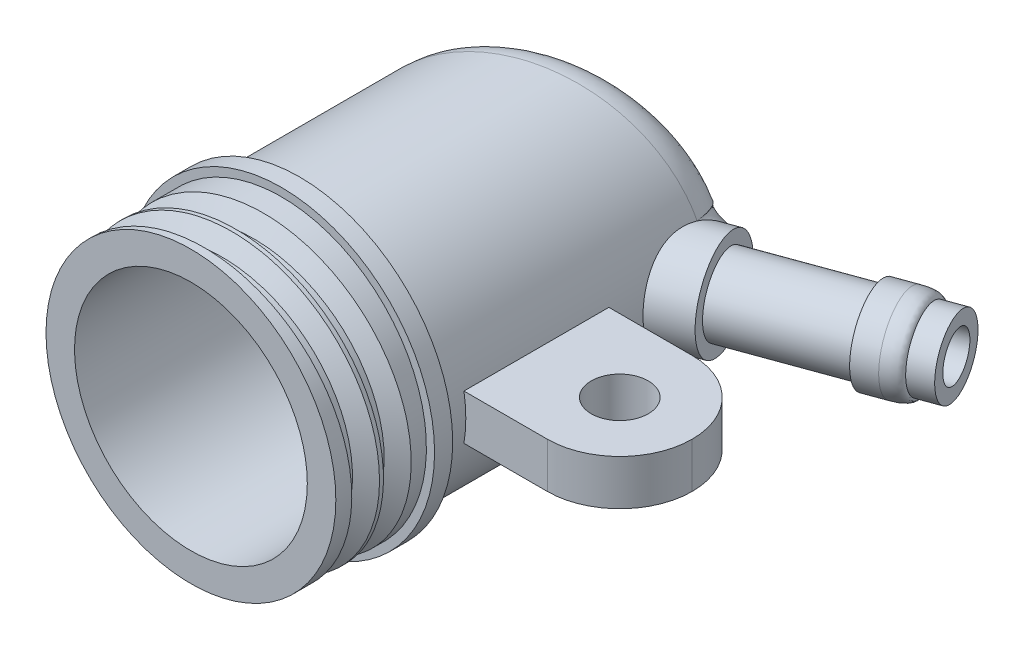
ISO-10303-21;
HEADER;
FILE_DESCRIPTION(('STEP AP214'),'2;1');
FILE_NAME('part.step','',(''),(''),'','','');
FILE_SCHEMA(('AUTOMOTIVE_DESIGN { 1 0 10303 214 1 1 1 1 }'));
ENDSEC;
DATA;
#1=APPLICATION_CONTEXT('core data for automotive mechanical design processes');
#2=APPLICATION_PROTOCOL_DEFINITION('international standard','automotive_design',2000,#1);
#3=PRODUCT_CONTEXT('',#1,'mechanical');
#4=PRODUCT('Part','Part','',(#3));
#5=PRODUCT_RELATED_PRODUCT_CATEGORY('part','',(#4));
#6=PRODUCT_DEFINITION_FORMATION('','',#4);
#7=PRODUCT_DEFINITION_CONTEXT('part definition',#1,'design');
#8=PRODUCT_DEFINITION('design','',#6,#7);
#9=PRODUCT_DEFINITION_SHAPE('','',#8);
#10=(LENGTH_UNIT() NAMED_UNIT(*) SI_UNIT(.MILLI.,.METRE.));
#11=(NAMED_UNIT(*) PLANE_ANGLE_UNIT() SI_UNIT($,.RADIAN.));
#12=(NAMED_UNIT(*) SI_UNIT($,.STERADIAN.) SOLID_ANGLE_UNIT());
#13=UNCERTAINTY_MEASURE_WITH_UNIT(LENGTH_MEASURE(1.E-05),#10,'distance_accuracy_value','');
#14=(GEOMETRIC_REPRESENTATION_CONTEXT(3) GLOBAL_UNCERTAINTY_ASSIGNED_CONTEXT((#13)) GLOBAL_UNIT_ASSIGNED_CONTEXT((#10,
#11,#12)) REPRESENTATION_CONTEXT('',''));
#15=CARTESIAN_POINT('',(0.,0.,0.));
#16=DIRECTION('',(0.,0.,1.));
#17=DIRECTION('',(1.,0.,0.));
#18=AXIS2_PLACEMENT_3D('',#15,#16,#17);
#19=CARTESIAN_POINT('',(0.,0.,34.));
#20=DIRECTION('',(0.,0.,-1.));
#21=DIRECTION('',(-1.,0.,0.));
#22=AXIS2_PLACEMENT_3D('',#19,#20,#21);
#23=CYLINDRICAL_SURFACE('',#22,15.35);
#24=CARTESIAN_POINT('',(15.35,0.,11.4399110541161));
#25=CARTESIAN_POINT('',(15.3499992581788,-0.150747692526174,11.4399103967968));
#26=CARTESIAN_POINT('',(15.3477736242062,-0.301538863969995,11.4339660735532));
#27=CARTESIAN_POINT('',(15.3389239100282,-0.602117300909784,11.4102073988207));
#28=CARTESIAN_POINT('',(15.3322972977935,-0.751903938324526,11.3923862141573));
#29=CARTESIAN_POINT('',(15.3147973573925,-1.0496479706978,11.3449020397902));
#30=CARTESIAN_POINT('',(15.3039156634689,-1.19760116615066,11.315215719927));
#31=CARTESIAN_POINT('',(15.2781837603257,-1.49037108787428,11.2441241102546));
#32=CARTESIAN_POINT('',(15.2633320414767,-1.63518659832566,11.2027143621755));
#33=CARTESIAN_POINT('',(15.2300709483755,-1.92042504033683,11.1084281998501));
#34=CARTESIAN_POINT('',(15.2116657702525,-2.06085292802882,11.0555653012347));
#35=CARTESIAN_POINT('',(15.1717658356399,-2.33654219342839,10.9385716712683));
#36=CARTESIAN_POINT('',(15.1502699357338,-2.47180163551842,10.8744367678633));
#37=CARTESIAN_POINT('',(15.1047911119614,-2.73600798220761,10.7352862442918));
#38=CARTESIAN_POINT('',(15.0808104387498,-2.8649604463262,10.660280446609));
#39=CARTESIAN_POINT('',(15.0309905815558,-3.11579530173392,10.4996942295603));
#40=CARTESIAN_POINT('',(15.0051507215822,-3.23767509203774,10.4141099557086));
#41=CARTESIAN_POINT('',(14.9524558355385,-3.4728993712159,10.2332467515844));
#42=CARTESIAN_POINT('',(14.92560580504,-3.58627922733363,10.1380123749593));
#43=CARTESIAN_POINT('',(14.8715389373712,-3.80426643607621,9.9380757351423));
#44=CARTESIAN_POINT('',(14.8443221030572,-3.90887385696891,9.83337354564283));
#45=CARTESIAN_POINT('',(14.7903044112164,-4.10853915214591,9.61515128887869));
#46=CARTESIAN_POINT('',(14.7635035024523,-4.20359821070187,9.50163231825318));
#47=CARTESIAN_POINT('',(14.7110918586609,-4.38349840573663,9.26650678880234));
#48=CARTESIAN_POINT('',(14.6854811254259,-4.46833952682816,9.14490021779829));
#49=CARTESIAN_POINT('',(14.6367452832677,-4.62545185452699,8.89724168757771));
#50=CARTESIAN_POINT('',(14.6135775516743,-4.6979607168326,8.77134881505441));
#51=CARTESIAN_POINT('',(14.5697254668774,-4.8322452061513,8.51349400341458));
#52=CARTESIAN_POINT('',(14.5490419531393,-4.89401720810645,8.38153003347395));
#53=CARTESIAN_POINT('',(14.5107319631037,-5.00646459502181,8.11261040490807));
#54=CARTESIAN_POINT('',(14.4931039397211,-5.0571455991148,7.97565731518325));
#55=CARTESIAN_POINT('',(14.4613302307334,-5.14730156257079,7.69766676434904));
#56=CARTESIAN_POINT('',(14.4471858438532,-5.1867723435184,7.5566278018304));
#57=CARTESIAN_POINT('',(14.4228161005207,-5.25415614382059,7.2727937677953));
#58=CARTESIAN_POINT('',(14.4125575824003,-5.28216713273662,7.13002480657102));
#59=CARTESIAN_POINT('',(14.3959604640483,-5.32722907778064,6.84252583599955));
#60=CARTESIAN_POINT('',(14.3896232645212,-5.34427611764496,6.6977951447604));
#61=CARTESIAN_POINT('',(14.3766271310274,-5.37921264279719,6.26217579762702));
#62=CARTESIAN_POINT('',(14.3759664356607,-5.38094390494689,5.96966016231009));
#63=CARTESIAN_POINT('',(14.3903194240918,-5.34243197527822,5.36919798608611));
#64=CARTESIAN_POINT('',(14.4063396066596,-5.29949363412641,5.06146289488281));
#65=CARTESIAN_POINT('',(14.4529917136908,-5.17089297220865,4.45618895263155));
#66=CARTESIAN_POINT('',(14.4836302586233,-5.08521129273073,4.15865478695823));
#67=CARTESIAN_POINT('',(14.5604616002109,-4.86119119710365,3.54388864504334));
#68=CARTESIAN_POINT('',(14.6081024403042,-4.71767857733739,3.22872458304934));
#69=CARTESIAN_POINT('',(14.7118215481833,-4.3835332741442,2.6252760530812));
#70=CARTESIAN_POINT('',(14.7679094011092,-4.19284690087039,2.33702273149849));
#71=CARTESIAN_POINT('',(14.8555076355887,-3.86654483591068,1.92256130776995));
#72=CARTESIAN_POINT('',(14.8862728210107,-3.74675672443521,1.78350725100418));
#73=CARTESIAN_POINT('',(14.9474286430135,-3.49480781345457,1.51687065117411));
#74=CARTESIAN_POINT('',(14.9778192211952,-3.36264511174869,1.38928987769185));
#75=CARTESIAN_POINT('',(15.0371105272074,-3.08669534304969,1.14751114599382));
#76=CARTESIAN_POINT('',(15.0660137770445,-2.94292909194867,1.03329008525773));
#77=CARTESIAN_POINT('',(15.1212916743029,-2.64425173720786,0.819814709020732));
#78=CARTESIAN_POINT('',(15.1476674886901,-2.48934583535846,0.72055347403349));
#79=CARTESIAN_POINT('',(15.1896280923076,-2.21604590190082,0.565419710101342));
#80=CARTESIAN_POINT('',(15.2061176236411,-2.10016701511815,0.505332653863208));
#81=CARTESIAN_POINT('',(15.2368923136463,-1.86381406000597,0.394356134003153));
#82=CARTESIAN_POINT('',(15.251178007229,-1.74334111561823,0.343464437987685));
#83=CARTESIAN_POINT('',(15.2771809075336,-1.4984642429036,0.25157958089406));
#84=CARTESIAN_POINT('',(15.2888993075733,-1.37406217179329,0.210581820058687));
#85=CARTESIAN_POINT('',(15.3094536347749,-1.12209431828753,0.139091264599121));
#86=CARTESIAN_POINT('',(15.3182908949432,-0.99453002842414,0.108593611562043));
#87=CARTESIAN_POINT('',(15.3328708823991,-0.736447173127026,0.0584619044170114));
#88=CARTESIAN_POINT('',(15.3385981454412,-0.605917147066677,0.0388821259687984));
#89=CARTESIAN_POINT('',(15.3467164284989,-0.343540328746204,0.0111700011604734));
#90=CARTESIAN_POINT('',(15.349107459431,-0.211693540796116,0.00303761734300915));
#91=CARTESIAN_POINT('',(15.350478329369,0.0522181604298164,-0.00162796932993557));
#92=CARTESIAN_POINT('',(15.3494583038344,0.184283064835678,0.00183836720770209));
#93=CARTESIAN_POINT('',(15.3440396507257,0.447526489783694,0.0203035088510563));
#94=CARTESIAN_POINT('',(15.339641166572,0.578705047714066,0.0353018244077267));
#95=CARTESIAN_POINT('',(15.3280398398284,0.829638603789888,0.0750548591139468));
#96=CARTESIAN_POINT('',(15.3210644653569,0.949530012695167,0.0990198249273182));
#97=CARTESIAN_POINT('',(15.3045077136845,1.18689895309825,0.156264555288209));
#98=CARTESIAN_POINT('',(15.2949254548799,1.30437565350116,0.189547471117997));
#99=CARTESIAN_POINT('',(15.2626074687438,1.65206564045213,0.302702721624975));
#100=CARTESIAN_POINT('',(15.2362911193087,1.87773037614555,0.395912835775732));
#101=CARTESIAN_POINT('',(15.1745181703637,2.32618405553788,0.620354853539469));
#102=CARTESIAN_POINT('',(15.138584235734,2.54786379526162,0.753639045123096));
#103=CARTESIAN_POINT('',(15.0615833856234,2.96937062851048,1.04988734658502));
#104=CARTESIAN_POINT('',(15.0205140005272,3.16918712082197,1.21286575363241));
#105=CARTESIAN_POINT('',(14.9290296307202,3.57736269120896,1.59357044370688));
#106=CARTESIAN_POINT('',(14.8782171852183,3.78134319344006,1.81589301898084));
#107=CARTESIAN_POINT('',(14.7781508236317,4.15527048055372,2.28783427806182));
#108=CARTESIAN_POINT('',(14.728898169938,4.32519026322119,2.53747437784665));
#109=CARTESIAN_POINT('',(14.628386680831,4.65481849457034,3.10222356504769));
#110=CARTESIAN_POINT('',(14.5781581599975,4.80812107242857,3.42131394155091));
#111=CARTESIAN_POINT('',(14.5133012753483,4.99910336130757,3.91605030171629));
#112=CARTESIAN_POINT('',(14.4934204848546,5.05629326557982,4.0837598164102));
#113=CARTESIAN_POINT('',(14.4578293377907,5.15718477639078,4.42370132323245));
#114=CARTESIAN_POINT('',(14.4421194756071,5.20088478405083,4.59593384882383));
#115=CARTESIAN_POINT('',(14.4150711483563,5.27540039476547,4.94962161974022));
#116=CARTESIAN_POINT('',(14.4038981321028,5.30573131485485,5.13119193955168));
#117=CARTESIAN_POINT('',(14.3872963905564,5.35058690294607,5.4964692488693));
#118=CARTESIAN_POINT('',(14.3818649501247,5.36511904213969,5.68017518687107));
#119=CARTESIAN_POINT('',(14.3771655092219,5.37770028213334,6.04812624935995));
#120=CARTESIAN_POINT('',(14.3778934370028,5.375760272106,6.23237093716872));
#121=CARTESIAN_POINT('',(14.3857080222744,5.35481432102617,6.59975159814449));
#122=CARTESIAN_POINT('',(14.3927936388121,5.33581117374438,6.78288774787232));
#123=CARTESIAN_POINT('',(14.4121049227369,5.2834088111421,7.12591920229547));
#124=CARTESIAN_POINT('',(14.4236711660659,5.2518460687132,7.28613372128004));
#125=CARTESIAN_POINT('',(14.4514979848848,5.17478361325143,7.60275292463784));
#126=CARTESIAN_POINT('',(14.4677579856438,5.12928560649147,7.75915807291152));
#127=CARTESIAN_POINT('',(14.504503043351,5.02443739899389,8.06667498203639));
#128=CARTESIAN_POINT('',(14.524986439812,4.96509264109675,8.21778879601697));
#129=CARTESIAN_POINT('',(14.5695316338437,4.83281622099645,8.51339469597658));
#130=CARTESIAN_POINT('',(14.5935931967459,4.75988544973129,8.65788721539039));
#131=CARTESIAN_POINT('',(14.6419631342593,4.6088026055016,8.92502513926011));
#132=CARTESIAN_POINT('',(14.6660110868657,4.53188286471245,9.04841702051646));
#133=CARTESIAN_POINT('',(14.7156924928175,4.36786402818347,9.287962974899));
#134=CARTESIAN_POINT('',(14.7413264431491,4.28076173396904,9.40411475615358));
#135=CARTESIAN_POINT('',(14.7934420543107,4.09703331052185,9.62831432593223));
#136=CARTESIAN_POINT('',(14.8199232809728,4.00041200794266,9.73636617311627));
#137=CARTESIAN_POINT('',(14.8730212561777,3.79824458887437,9.94380889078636));
#138=CARTESIAN_POINT('',(14.8996380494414,3.69269532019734,10.0431966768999));
#139=CARTESIAN_POINT('',(14.9520799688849,3.47423791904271,10.2320163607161));
#140=CARTESIAN_POINT('',(14.9779094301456,3.36138856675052,10.3215151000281));
#141=CARTESIAN_POINT('',(15.02829383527,3.12843158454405,10.4909105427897));
#142=CARTESIAN_POINT('',(15.0528487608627,3.00832385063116,10.5708071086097));
#143=CARTESIAN_POINT('',(15.1000652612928,2.76157874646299,10.7206610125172));
#144=CARTESIAN_POINT('',(15.1227253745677,2.63493645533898,10.7906107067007));
#145=CARTESIAN_POINT('',(15.1655468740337,2.37610776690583,10.9201498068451));
#146=CARTESIAN_POINT('',(15.1857090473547,2.24392313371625,10.9797424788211));
#147=CARTESIAN_POINT('',(15.2235034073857,1.97150201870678,11.0896811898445));
#148=CARTESIAN_POINT('',(15.2410599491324,1.83114694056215,11.1397595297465));
#149=CARTESIAN_POINT('',(15.2725635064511,1.54654215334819,11.2285307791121));
#150=CARTESIAN_POINT('',(15.2865118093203,1.40229385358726,11.2672277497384));
#151=CARTESIAN_POINT('',(15.3104262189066,1.11114669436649,11.3330222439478));
#152=CARTESIAN_POINT('',(15.3203998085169,0.964253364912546,11.3601415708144));
#153=CARTESIAN_POINT('',(15.3361442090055,0.66863025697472,11.4027537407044));
#154=CARTESIAN_POINT('',(15.3419174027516,0.519901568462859,11.4182531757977));
#155=CARTESIAN_POINT('',(15.3470123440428,0.309080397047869,11.4319134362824));
#156=CARTESIAN_POINT('',(15.3481320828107,0.247309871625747,11.4349120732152));
#157=CARTESIAN_POINT('',(15.3496260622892,0.123695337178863,11.4389110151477));
#158=CARTESIAN_POINT('',(15.350000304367,0.061851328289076,11.4399113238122));
#159=CARTESIAN_POINT('',(15.35,0.,11.4399110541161));
#160=B_SPLINE_CURVE_WITH_KNOTS('',3,(#24,#25,#26,#27,#28,#29,#30,#31,#32,#33,#34,#35,#36,#37,
#38,#39,#40,#41,#42,#43,#44,#45,#46,#47,#48,#49,#50,#51,#52,#53,#54,#55,#56,#57,#58,#59,#60,#61,
#62,#63,#64,#65,#66,#67,#68,#69,#70,#71,#72,#73,#74,#75,#76,#77,#78,#79,#80,#81,#82,#83,#84,#85,
#86,#87,#88,#89,#90,#91,#92,#93,#94,#95,#96,#97,#98,#99,#100,#101,#102,#103,#104,#105,#106,#107,
#108,#109,#110,#111,#112,#113,#114,#115,#116,#117,#118,#119,#120,#121,#122,#123,#124,#125,#126,
#127,#128,#129,#130,#131,#132,#133,#134,#135,#136,#137,#138,#139,#140,#141,#142,#143,#144,#145,
#146,#147,#148,#149,#150,#151,#152,#153,#154,#155,#156,#157,#158,#159),.UNSPECIFIED.,.T.,.F.,(4,
2,2,2,2,2,2,2,2,2,2,2,2,2,2,2,2,2,2,2,2,2,2,2,2,2,2,2,2,2,2,2,2,2,2,2,2,2,2,2,2,2,2,2,2,2,2,2,2,
2,2,2,2,2,2,2,2,2,2,2,2,2,2,2,2,2,2,4),(0.,0.452185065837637,0.904630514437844,1.35797000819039,
1.81148213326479,2.26446196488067,2.71760981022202,3.17035073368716,3.62325711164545,
4.07416028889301,4.52505995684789,4.97590363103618,5.42674798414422,5.86756224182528,
6.3085250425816,6.7492639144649,7.19016684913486,7.62721751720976,8.06442421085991,
8.93822745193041,9.86798915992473,10.7981723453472,11.8425826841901,12.888187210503,
13.445843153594,14.0035849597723,14.5603475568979,15.1168518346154,15.5111801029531,
15.905412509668,16.299461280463,16.6933274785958,17.089134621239,17.4849404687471,
17.8807305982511,18.2765039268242,18.6434650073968,19.0105503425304,19.7441447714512,
20.524708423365,21.3056488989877,22.2200847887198,23.1352427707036,24.2027077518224,
24.7371334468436,25.2716224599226,25.8241524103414,26.3764209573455,26.9283244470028,
27.4801375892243,27.9705699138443,28.4609422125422,28.9511220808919,29.4412698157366,
29.8828772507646,30.324623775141,30.766147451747,31.2078276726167,31.6463116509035,
32.0848019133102,32.5236273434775,32.9623141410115,33.4119425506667,33.8614103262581,
34.310027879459,34.7583907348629,34.9439212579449,35.129451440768),.UNSPECIFIED.);
#161=CARTESIAN_POINT('',(14.4470753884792,5.18695601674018,4.54885283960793));
#162=VERTEX_POINT('',#161);
#163=CARTESIAN_POINT('',(14.4470753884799,-5.18695601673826,4.54885283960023));
#164=VERTEX_POINT('',#163);
#165=EDGE_CURVE('E181',#162,#164,#160,.T.);
#166=ORIENTED_EDGE('',*,*,#165,.F.);
#167=CARTESIAN_POINT('',(14.4470753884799,-5.18695601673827,4.54885283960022));
#168=CARTESIAN_POINT('',(13.8425437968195,-6.87074000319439,4.72588144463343));
#169=CARTESIAN_POINT('',(12.9410091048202,-8.44705615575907,4.98988324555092));
#170=CARTESIAN_POINT('',(10.6518027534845,-11.1964982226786,5.66024524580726));
#171=CARTESIAN_POINT('',(9.26475564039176,-12.3687823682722,6.06642255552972));
#172=CARTESIAN_POINT('',(6.17225807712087,-14.1677699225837,6.9720171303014));
#173=CARTESIAN_POINT('',(4.46757316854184,-14.7940279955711,7.47121021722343));
#174=CARTESIAN_POINT('',(0.94594107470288,-15.4249042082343,8.5024708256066));
#175=CARTESIAN_POINT('',(-0.870134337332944,-15.4293661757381,9.03428306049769));
#176=CARTESIAN_POINT('',(-4.39482393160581,-14.8158022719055,10.0664390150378));
#177=CARTESIAN_POINT('',(-6.10256558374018,-14.1979282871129,10.5665272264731));
#178=CARTESIAN_POINT('',(-9.20386572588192,-12.414158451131,11.474699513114));
#179=CARTESIAN_POINT('',(-10.5966564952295,-11.2487041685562,11.8825587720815));
#180=CARTESIAN_POINT('',(-12.8993454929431,-8.51054406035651,12.5568689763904));
#181=CARTESIAN_POINT('',(-13.8086736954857,-6.93851606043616,12.8231529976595));
#182=CARTESIAN_POINT('',(-15.034152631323,-3.57725159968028,13.1820173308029));
#183=CARTESIAN_POINT('',(-15.35,-1.78884721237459,13.2745088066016));
#184=CARTESIAN_POINT('',(-15.35,1.78884721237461,13.2745088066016));
#185=CARTESIAN_POINT('',(-15.0341526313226,3.57725159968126,13.1820173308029));
#186=CARTESIAN_POINT('',(-13.8086736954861,6.93851606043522,12.8231529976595));
#187=CARTESIAN_POINT('',(-12.8993454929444,8.51054406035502,12.5568689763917));
#188=CARTESIAN_POINT('',(-10.5966564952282,11.2487041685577,11.8825587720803));
#189=CARTESIAN_POINT('',(-9.20386572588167,12.4141584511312,11.4746995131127));
#190=CARTESIAN_POINT('',(-6.10256558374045,14.1979282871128,10.5665272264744));
#191=CARTESIAN_POINT('',(-4.3948239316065,14.8158022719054,10.0664390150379));
#192=CARTESIAN_POINT('',(-0.870134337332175,15.4293661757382,9.03428306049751));
#193=CARTESIAN_POINT('',(0.945941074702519,15.4249042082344,8.50247082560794));
#194=CARTESIAN_POINT('',(4.46757316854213,14.794027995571,7.47121021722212));
#195=CARTESIAN_POINT('',(6.17225807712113,14.1677699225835,6.97201713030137));
#196=CARTESIAN_POINT('',(9.26475564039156,12.3687823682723,6.06642255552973));
#197=CARTESIAN_POINT('',(10.6518027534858,11.1964982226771,5.66024524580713));
#198=CARTESIAN_POINT('',(12.9410091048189,8.44705615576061,4.98988324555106));
#199=CARTESIAN_POINT('',(13.8425437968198,6.87074000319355,4.7258814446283));
#200=CARTESIAN_POINT('',(14.4470753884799,5.18695601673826,4.54885283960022));
#201=(BOUNDED_CURVE() B_SPLINE_CURVE(3,(#167,#168,#169,#170,#171,#172,#173,#174,#175,#176,#177,
#178,#179,#180,#181,#182,#183,#184,#185,#186,#187,#188,#189,#190,#191,#192,#193,#194,#195,#196,
#197,#198,#199,#200),.UNSPECIFIED.,.F.,.F.) B_SPLINE_CURVE_WITH_KNOTS((4,2,2,2,2,2,2,2,2,2,2,2,
2,2,2,2,4),(0.344697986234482,0.694309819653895,1.04392165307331,1.39353348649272,
1.74314531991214,2.09275715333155,2.44236898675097,2.79198082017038,3.14159265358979,
3.49120448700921,3.84081632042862,4.19042815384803,4.54003998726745,4.88965182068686,
5.23926365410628,5.58887548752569,5.9384873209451),
.UNSPECIFIED.) CURVE() GEOMETRIC_REPRESENTATION_ITEM() RATIONAL_B_SPLINE_CURVE((1.,1.,1.,1.,1.,
1.,1.,1.,1.,1.,1.,1.,1.,1.,1.,1.,1.,1.,1.,1.,1.,1.,1.,1.,1.,1.,1.,1.,1.,1.,1.,1.,1.,1.)) REPRESENTATION_ITEM(''));
#202=EDGE_CURVE('E531',#162,#164,#201,.F.);
#203=ORIENTED_EDGE('',*,*,#202,.T.);
#204=EDGE_LOOP('',(#166,#203));
#205=FACE_BOUND('',#204,.T.);
#206=CARTESIAN_POINT('',(0.,0.,34.));
#207=DIRECTION('',(0.,0.,1.));
#208=DIRECTION('',(1.,0.,0.));
#209=AXIS2_PLACEMENT_3D('',#206,#207,#208);
#210=CIRCLE('',#209,15.35);
#211=CARTESIAN_POINT('',(15.35,0.,34.));
#212=VERTEX_POINT('',#211);
#213=EDGE_CURVE('E172',#212,#212,#210,.T.);
#214=ORIENTED_EDGE('',*,*,#213,.F.);
#215=EDGE_LOOP('',(#214));
#216=FACE_BOUND('',#215,.T.);
#217=DIRECTION('',(0.,0.,-1.));
#218=VECTOR('',#217,1.);
#219=CARTESIAN_POINT('',(15.145048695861,-2.5,34.));
#220=LINE('',#219,#218);
#221=CARTESIAN_POINT('',(15.145048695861,-2.5,31.));
#222=VERTEX_POINT('',#221);
#223=CARTESIAN_POINT('',(15.145048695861,-2.5,15.));
#224=VERTEX_POINT('',#223);
#225=EDGE_CURVE('E281',#222,#224,#220,.T.);
#226=ORIENTED_EDGE('',*,*,#225,.F.);
#227=CARTESIAN_POINT('',(0.,0.,31.));
#228=DIRECTION('',(0.,0.,1.));
#229=DIRECTION('',(1.,0.,0.));
#230=AXIS2_PLACEMENT_3D('',#227,#228,#229);
#231=CIRCLE('',#230,15.35);
#232=CARTESIAN_POINT('',(15.145048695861,2.5,31.));
#233=VERTEX_POINT('',#232);
#234=EDGE_CURVE('E283',#222,#233,#231,.T.);
#235=ORIENTED_EDGE('',*,*,#234,.T.);
#236=DIRECTION('',(0.,0.,-1.));
#237=VECTOR('',#236,1.);
#238=CARTESIAN_POINT('',(15.145048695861,2.5,34.));
#239=LINE('',#238,#237);
#240=CARTESIAN_POINT('',(15.145048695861,2.5,15.));
#241=VERTEX_POINT('',#240);
#242=EDGE_CURVE('E320',#233,#241,#239,.T.);
#243=ORIENTED_EDGE('',*,*,#242,.T.);
#244=CARTESIAN_POINT('',(0.,0.,15.));
#245=DIRECTION('',(0.,0.,-1.));
#246=DIRECTION('',(-1.,0.,0.));
#247=AXIS2_PLACEMENT_3D('',#244,#245,#246);
#248=CIRCLE('',#247,15.35);
#249=EDGE_CURVE('E285',#241,#224,#248,.T.);
#250=ORIENTED_EDGE('',*,*,#249,.T.);
#251=EDGE_LOOP('',(#226,#235,#243,#250));
#252=FACE_BOUND('',#251,.T.);
#253=ADVANCED_FACE('F44',(#205,#216,#252),#23,.T.);
#254=CARTESIAN_POINT('',(16.2050503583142,68.9313517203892,2.34923155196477));
#255=DIRECTION('',(0.34202014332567,0.,0.939692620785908));
#256=DIRECTION('',(0.939692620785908,0.,-0.34202014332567));
#257=AXIS2_PLACEMENT_3D('',#254,#255,#256);
#258=PLANE('',#257);
#259=CARTESIAN_POINT('',(0.,0.,8.24738752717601));
#260=DIRECTION('',(0.34202014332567,0.,0.939692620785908));
#261=DIRECTION('',(0.939692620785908,0.,-0.34202014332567));
#262=AXIS2_PLACEMENT_3D('',#259,#260,#261);
#263=ELLIPSE('',#262,13.6746843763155,12.85);
#264=CARTESIAN_POINT('',(12.0475854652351,4.4696962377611,3.86242502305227));
#265=VERTEX_POINT('',#264);
#266=CARTESIAN_POINT('',(12.0475854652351,-4.4696962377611,3.86242502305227));
#267=VERTEX_POINT('',#266);
#268=EDGE_CURVE('E412',#265,#267,#263,.T.);
#269=ORIENTED_EDGE('',*,*,#268,.T.);
#270=DIRECTION('',(0.,1.,0.));
#271=VECTOR('',#270,1.);
#272=CARTESIAN_POINT('',(12.0475854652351,68.9313517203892,3.86242502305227));
#273=LINE('',#272,#271);
#274=EDGE_CURVE('E162',#267,#265,#273,.T.);
#275=ORIENTED_EDGE('',*,*,#274,.T.);
#276=EDGE_LOOP('',(#269,#275));
#277=FACE_BOUND('',#276,.T.);
#278=ADVANCED_FACE('F265',(#277),#258,.T.);
#279=CARTESIAN_POINT('',(0.,0.,34.));
#280=DIRECTION('',(0.,0.,-1.));
#281=DIRECTION('',(-1.,0.,0.));
#282=AXIS2_PLACEMENT_3D('',#279,#280,#281);
#283=CYLINDRICAL_SURFACE('',#282,12.85);
#284=CARTESIAN_POINT('',(12.85,0.,3.96943668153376));
#285=CARTESIAN_POINT('',(12.8499969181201,-0.128031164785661,3.96944724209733));
#286=CARTESIAN_POINT('',(12.8480643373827,-0.256148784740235,3.98066712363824));
#287=CARTESIAN_POINT('',(12.84055783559,-0.50850211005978,4.02493705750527));
#288=CARTESIAN_POINT('',(12.8349800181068,-0.632733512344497,4.05801046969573));
#289=CARTESIAN_POINT('',(12.8208518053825,-0.873351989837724,4.1440643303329));
#290=CARTESIAN_POINT('',(12.8123123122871,-0.989765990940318,4.19697182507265));
#291=CARTESIAN_POINT('',(12.7931437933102,-1.21264578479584,4.32031362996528));
#292=CARTESIAN_POINT('',(12.782514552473,-1.3191105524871,4.39074974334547));
#293=CARTESIAN_POINT('',(12.7594658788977,-1.52646069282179,4.55137373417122));
#294=CARTESIAN_POINT('',(12.7469765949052,-1.62660191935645,4.64250894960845));
#295=CARTESIAN_POINT('',(12.7219254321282,-1.81215215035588,4.83868358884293));
#296=CARTESIAN_POINT('',(12.7093635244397,-1.8975548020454,4.94372897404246));
#297=CARTESIAN_POINT('',(12.6837833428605,-2.06201433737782,5.17856773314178));
#298=CARTESIAN_POINT('',(12.670897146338,-2.13901775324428,5.30981659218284));
#299=CARTESIAN_POINT('',(12.6477664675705,-2.27179541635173,5.58289531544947));
#300=CARTESIAN_POINT('',(12.6375232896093,-2.32755918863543,5.72473035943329));
#301=CARTESIAN_POINT('',(12.6202027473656,-2.41978634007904,6.02595575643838));
#302=CARTESIAN_POINT('',(12.6134040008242,-2.45458527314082,6.18587627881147));
#303=CARTESIAN_POINT('',(12.6051035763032,-2.49686659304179,6.50945519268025));
#304=CARTESIAN_POINT('',(12.6036015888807,-2.50435057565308,6.67311336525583));
#305=CARTESIAN_POINT('',(12.6062630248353,-2.49091979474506,6.99644111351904));
#306=CARTESIAN_POINT('',(12.6103292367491,-2.47049233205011,7.15613081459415));
#307=CARTESIAN_POINT('',(12.6236322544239,-2.40159012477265,7.46912461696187));
#308=CARTESIAN_POINT('',(12.6328666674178,-2.35312835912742,7.6224316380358));
#309=CARTESIAN_POINT('',(12.6546339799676,-2.23297398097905,7.9072325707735));
#310=CARTESIAN_POINT('',(12.6669027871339,-2.16306612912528,8.03950020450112));
#311=CARTESIAN_POINT('',(12.693519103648,-2.00094655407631,8.28934370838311));
#312=CARTESIAN_POINT('',(12.7078659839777,-1.90874157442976,8.40692400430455));
#313=CARTESIAN_POINT('',(12.7360900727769,-1.70997811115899,8.61781799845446));
#314=CARTESIAN_POINT('',(12.7499527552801,-1.60441895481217,8.71207744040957));
#315=CARTESIAN_POINT('',(12.7763423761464,-1.37857566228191,8.8811319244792));
#316=CARTESIAN_POINT('',(12.7888694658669,-1.25829319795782,8.95592917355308));
#317=CARTESIAN_POINT('',(12.8109373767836,-1.0088405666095,9.08277503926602));
#318=CARTESIAN_POINT('',(12.8205288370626,-0.879874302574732,9.13521637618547));
#319=CARTESIAN_POINT('',(12.83596961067,-0.614812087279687,9.21795842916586));
#320=CARTESIAN_POINT('',(12.8418189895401,-0.478716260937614,9.24825953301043));
#321=CARTESIAN_POINT('',(12.8491237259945,-0.203531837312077,9.28592193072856));
#322=CARTESIAN_POINT('',(12.8505872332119,-0.0644492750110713,9.29332577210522));
#323=CARTESIAN_POINT('',(12.8489833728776,0.213011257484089,9.28513237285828));
#324=CARTESIAN_POINT('',(12.8459159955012,0.351389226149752,9.26953508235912));
#325=CARTESIAN_POINT('',(12.8355837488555,0.623583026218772,9.21571160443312));
#326=CARTESIAN_POINT('',(12.8283167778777,0.757396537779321,9.17747408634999));
#327=CARTESIAN_POINT('',(12.8103844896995,1.01658128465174,9.07933166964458));
#328=CARTESIAN_POINT('',(12.7997192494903,1.14195271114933,9.0194272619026));
#329=CARTESIAN_POINT('',(12.7761787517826,1.38063354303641,8.87956841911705));
#330=CARTESIAN_POINT('',(12.7633047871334,1.49394994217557,8.79962570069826));
#331=CARTESIAN_POINT('',(12.736770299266,1.70545165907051,8.62187106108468));
#332=CARTESIAN_POINT('',(12.7231098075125,1.80363758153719,8.52405985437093));
#333=CARTESIAN_POINT('',(12.6964690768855,1.98252267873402,8.31308428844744));
#334=CARTESIAN_POINT('',(12.6834906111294,2.06317783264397,8.19988241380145));
#335=CARTESIAN_POINT('',(12.6596399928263,2.20481130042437,7.96159399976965));
#336=CARTESIAN_POINT('',(12.6487679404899,2.26578867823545,7.83650689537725));
#337=CARTESIAN_POINT('',(12.6300446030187,2.36796121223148,7.57550151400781));
#338=CARTESIAN_POINT('',(12.6222557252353,2.40875149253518,7.43942069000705));
#339=CARTESIAN_POINT('',(12.6107195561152,2.46843606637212,7.16239049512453));
#340=CARTESIAN_POINT('',(12.6069731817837,2.48732539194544,7.02144002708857));
#341=CARTESIAN_POINT('',(12.6036886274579,2.50392015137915,6.73123661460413));
#342=CARTESIAN_POINT('',(12.6043687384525,2.50052664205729,6.58191906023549));
#343=CARTESIAN_POINT('',(12.6102248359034,2.47081833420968,6.28567492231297));
#344=CARTESIAN_POINT('',(12.615402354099,2.44449572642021,6.13874917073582));
#345=CARTESIAN_POINT('',(12.6300836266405,2.36751469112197,5.84110259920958));
#346=CARTESIAN_POINT('',(12.6398532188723,2.31534838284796,5.69078366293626));
#347=CARTESIAN_POINT('',(12.6625990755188,2.18752935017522,5.40068618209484));
#348=CARTESIAN_POINT('',(12.6755766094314,2.11186732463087,5.26091183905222));
#349=CARTESIAN_POINT('',(12.7036744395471,1.935801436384,4.99183789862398));
#350=CARTESIAN_POINT('',(12.7188482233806,1.83471026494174,4.86299070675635));
#351=CARTESIAN_POINT('',(12.7491209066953,1.61094619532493,4.62551354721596));
#352=CARTESIAN_POINT('',(12.7642198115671,1.48827487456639,4.51688210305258));
#353=CARTESIAN_POINT('',(12.7913951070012,1.23213447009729,4.33102212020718));
#354=CARTESIAN_POINT('',(12.803600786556,1.09980488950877,4.25226522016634));
#355=CARTESIAN_POINT('',(12.8191997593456,0.891894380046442,4.15442463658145));
#356=CARTESIAN_POINT('',(12.8239460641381,0.82106072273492,4.12520348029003));
#357=CARTESIAN_POINT('',(12.8323675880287,0.67679434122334,4.07393752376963));
#358=CARTESIAN_POINT('',(12.8360433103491,0.603362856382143,4.05188935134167));
#359=CARTESIAN_POINT('',(12.8426677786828,0.442552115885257,4.01243288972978));
#360=CARTESIAN_POINT('',(12.8454033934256,0.354834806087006,3.99634810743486));
#361=CARTESIAN_POINT('',(12.8490705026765,0.178092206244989,3.97484676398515));
#362=CARTESIAN_POINT('',(12.8500021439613,0.0890670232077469,3.96942933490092));
#363=CARTESIAN_POINT('',(12.85,0.,3.96943668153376));
#364=B_SPLINE_CURVE_WITH_KNOTS('',3,(#284,#285,#286,#287,#288,#289,#290,#291,#292,#293,#294,
#295,#296,#297,#298,#299,#300,#301,#302,#303,#304,#305,#306,#307,#308,#309,#310,#311,#312,#313,
#314,#315,#316,#317,#318,#319,#320,#321,#322,#323,#324,#325,#326,#327,#328,#329,#330,#331,#332,
#333,#334,#335,#336,#337,#338,#339,#340,#341,#342,#343,#344,#345,#346,#347,#348,#349,#350,#351,
#352,#353,#354,#355,#356,#357,#358,#359,#360,#361,#362,#363),.UNSPECIFIED.,.T.,.F.,(4,2,2,2,2,2,
2,2,2,2,2,2,2,2,2,2,2,2,2,2,2,2,2,2,2,2,2,2,2,2,2,2,2,2,2,2,2,2,2,4),(0.,0.383752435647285,
0.767915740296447,1.15067966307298,1.53348297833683,1.93979458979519,2.34628089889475,
2.80248030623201,3.25890441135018,3.7479526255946,4.23697226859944,4.71756241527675,
5.19793024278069,5.64593981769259,6.09381406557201,6.51833112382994,6.94280002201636,
7.35946996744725,7.77613261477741,8.19202055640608,8.60790939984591,9.02400655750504,
9.44009428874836,9.85593929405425,10.2717676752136,10.6886284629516,11.1055090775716,
11.5304423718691,11.9554720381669,12.401615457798,12.8479108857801,13.3240125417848,
13.8003029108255,14.2911927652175,14.7820467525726,15.2424962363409,15.4724823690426,
15.7023602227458,15.9693457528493,16.2363095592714),.UNSPECIFIED.);
#365=CARTESIAN_POINT('',(12.6528383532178,-2.24236072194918,5.52534366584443));
#366=VERTEX_POINT('',#365);
#367=CARTESIAN_POINT('',(12.6528383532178,2.24236072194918,5.52534366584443));
#368=VERTEX_POINT('',#367);
#369=EDGE_CURVE('E59',#366,#368,#364,.T.);
#370=ORIENTED_EDGE('',*,*,#369,.F.);
#371=CARTESIAN_POINT('',(0.,0.,-29.2380440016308));
#372=DIRECTION('',(0.939692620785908,0.,-0.34202014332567));
#373=DIRECTION('',(-0.34202014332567,0.,-0.939692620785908));
#374=AXIS2_PLACEMENT_3D('',#371,#372,#373);
#375=ELLIPSE('',#374,37.5708865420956,12.85);
#376=EDGE_CURVE('E156',#366,#267,#375,.T.);
#377=ORIENTED_EDGE('',*,*,#376,.T.);
#378=ORIENTED_EDGE('',*,*,#268,.F.);
#379=EDGE_CURVE('E158',#265,#368,#375,.T.);
#380=ORIENTED_EDGE('',*,*,#379,.T.);
#381=EDGE_LOOP('',(#370,#377,#378,#380));
#382=FACE_BOUND('',#381,.T.);
#383=CARTESIAN_POINT('',(0.,0.,46.));
#384=DIRECTION('',(0.,0.,1.));
#385=DIRECTION('',(1.,0.,0.));
#386=AXIS2_PLACEMENT_3D('',#383,#384,#385);
#387=CIRCLE('',#386,12.85);
#388=CARTESIAN_POINT('',(12.85,0.,46.));
#389=VERTEX_POINT('',#388);
#390=EDGE_CURVE('E387',#389,#389,#387,.F.);
#391=ORIENTED_EDGE('',*,*,#390,.F.);
#392=EDGE_LOOP('',(#391));
#393=FACE_BOUND('',#392,.T.);
#394=ADVANCED_FACE('F153',(#382,#393),#283,.F.);
#395=CARTESIAN_POINT('',(0.,0.,36.));
#396=DIRECTION('',(0.,0.,-1.));
#397=DIRECTION('',(-1.,0.,0.));
#398=AXIS2_PLACEMENT_3D('',#395,#396,#397);
#399=CYLINDRICAL_SURFACE('',#398,16.9);
#400=CARTESIAN_POINT('',(0.,0.,36.));
#401=DIRECTION('',(0.,0.,1.));
#402=DIRECTION('',(1.,0.,0.));
#403=AXIS2_PLACEMENT_3D('',#400,#401,#402);
#404=CIRCLE('',#403,16.9);
#405=CARTESIAN_POINT('',(16.9,0.,36.));
#406=VERTEX_POINT('',#405);
#407=EDGE_CURVE('E409',#406,#406,#404,.T.);
#408=ORIENTED_EDGE('',*,*,#407,.F.);
#409=EDGE_LOOP('',(#408));
#410=FACE_BOUND('',#409,.T.);
#411=CARTESIAN_POINT('',(0.,0.,34.));
#412=DIRECTION('',(0.,0.,1.));
#413=DIRECTION('',(1.,0.,0.));
#414=AXIS2_PLACEMENT_3D('',#411,#412,#413);
#415=CIRCLE('',#414,16.9);
#416=CARTESIAN_POINT('',(16.9,0.,34.));
#417=VERTEX_POINT('',#416);
#418=EDGE_CURVE('E407',#417,#417,#415,.T.);
#419=ORIENTED_EDGE('',*,*,#418,.T.);
#420=EDGE_LOOP('',(#419));
#421=FACE_BOUND('',#420,.T.);
#422=ADVANCED_FACE('F464',(#410,#421),#399,.T.);
#423=CARTESIAN_POINT('',(0.,0.,36.));
#424=DIRECTION('',(0.,0.,1.));
#425=DIRECTION('',(1.,0.,0.));
#426=AXIS2_PLACEMENT_3D('',#423,#424,#425);
#427=PLANE('',#426);
#428=CARTESIAN_POINT('',(0.,0.,36.));
#429=DIRECTION('',(0.,0.,1.));
#430=DIRECTION('',(1.,0.,0.));
#431=AXIS2_PLACEMENT_3D('',#428,#429,#430);
#432=CIRCLE('',#431,16.);
#433=CARTESIAN_POINT('',(-16.,0.,36.));
#434=VERTEX_POINT('',#433);
#435=CARTESIAN_POINT('',(-15.8973093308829,-1.80984972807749,36.));
#436=VERTEX_POINT('',#435);
#437=EDGE_CURVE('E164',#434,#436,#432,.T.);
#438=ORIENTED_EDGE('',*,*,#437,.F.);
#439=EDGE_CURVE('E168',#436,#434,#432,.T.);
#440=ORIENTED_EDGE('',*,*,#439,.F.);
#441=EDGE_LOOP('',(#438,#440));
#442=FACE_BOUND('',#441,.T.);
#443=ORIENTED_EDGE('',*,*,#407,.T.);
#444=EDGE_LOOP('',(#443));
#445=FACE_BOUND('',#444,.T.);
#446=ADVANCED_FACE('F423',(#442,#445),#427,.T.);
#447=CARTESIAN_POINT('',(0.,0.,34.));
#448=DIRECTION('',(0.,0.,1.));
#449=DIRECTION('',(1.,0.,0.));
#450=AXIS2_PLACEMENT_3D('',#447,#448,#449);
#451=PLANE('',#450);
#452=ORIENTED_EDGE('',*,*,#213,.T.);
#453=EDGE_LOOP('',(#452));
#454=FACE_BOUND('',#453,.T.);
#455=ORIENTED_EDGE('',*,*,#418,.F.);
#456=EDGE_LOOP('',(#455));
#457=FACE_BOUND('',#456,.T.);
#458=ADVANCED_FACE('F463',(#454,#457),#451,.F.);
#459=CARTESIAN_POINT('',(15.35,68.9313517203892,0.));
#460=DIRECTION('',(0.34202014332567,0.,0.939692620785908));
#461=DIRECTION('',(0.939692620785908,0.,-0.34202014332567));
#462=AXIS2_PLACEMENT_3D('',#459,#460,#461);
#463=PLANE('',#462);
#464=CARTESIAN_POINT('',(15.35,0.,0.));
#465=CARTESIAN_POINT('',(15.1530358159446,0.186074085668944,0.0716891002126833));
#466=CARTESIAN_POINT('',(14.9433824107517,0.351884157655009,0.147996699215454));
#467=CARTESIAN_POINT('',(14.508078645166,0.657518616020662,0.306434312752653));
#468=CARTESIAN_POINT('',(14.2828635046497,0.798086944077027,0.388405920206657));
#469=CARTESIAN_POINT('',(13.8284421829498,1.07276000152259,0.553801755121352));
#470=CARTESIAN_POINT('',(13.5992256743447,1.20684624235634,0.637229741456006));
#471=CARTESIAN_POINT('',(13.1446180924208,1.48122433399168,0.802693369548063));
#472=CARTESIAN_POINT('',(12.9191569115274,1.6214043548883,0.884754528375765));
#473=CARTESIAN_POINT('',(12.4781277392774,1.91782329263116,1.0452760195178));
#474=CARTESIAN_POINT('',(12.2625106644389,2.0739825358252,1.12375421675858));
#475=CARTESIAN_POINT('',(11.8473879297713,2.4124535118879,1.27484653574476));
#476=CARTESIAN_POINT('',(11.6467176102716,2.59607162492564,1.34788455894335));
#477=CARTESIAN_POINT('',(11.2782027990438,2.9920391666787,1.48201298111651));
#478=CARTESIAN_POINT('',(11.1095907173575,3.2045870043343,1.54338275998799));
#479=CARTESIAN_POINT('',(10.8138774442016,3.66832472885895,1.65101358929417));
#480=CARTESIAN_POINT('',(10.6896965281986,3.91637716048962,1.69621174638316));
#481=CARTESIAN_POINT('',(10.5974823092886,4.17321868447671,1.7297749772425));
#482=(BOUNDED_CURVE() B_SPLINE_CURVE(3,(#464,#465,#466,#467,#468,#469,#470,#471,#472,#473,#474,
#475,#476,#477,#478,#479,#480,#481),.UNSPECIFIED.,.F.,.F.) B_SPLINE_CURVE_WITH_KNOTS((4,2,2,2,2,
2,2,2,4),(-1.09544581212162E-05,0.000821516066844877,0.00165398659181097,0.00248645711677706,
0.00331892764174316,0.00415139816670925,0.00498386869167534,0.00581633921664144,
0.00664880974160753),
.UNSPECIFIED.) CURVE() GEOMETRIC_REPRESENTATION_ITEM() RATIONAL_B_SPLINE_CURVE((1.,1.,1.,1.,1.,
1.,1.,1.,1.,1.,1.,1.,1.,1.,1.,1.,1.,1.)) REPRESENTATION_ITEM(''));
#483=CARTESIAN_POINT('',(10.5974823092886,4.1732186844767,1.7297749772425));
#484=VERTEX_POINT('',#483);
#485=CARTESIAN_POINT('',(15.35,0.,0.));
#486=VERTEX_POINT('',#485);
#487=EDGE_CURVE('E527',#484,#486,#482,.F.);
#488=ORIENTED_EDGE('',*,*,#487,.T.);
#489=CARTESIAN_POINT('',(10.5974823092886,-4.17321868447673,1.72977497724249));
#490=CARTESIAN_POINT('',(10.690364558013,-3.91451651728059,1.69596860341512));
#491=CARTESIAN_POINT('',(10.8164740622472,-3.66382940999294,1.6500684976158));
#492=CARTESIAN_POINT('',(11.1106299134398,-3.20338590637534,1.54300452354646));
#493=CARTESIAN_POINT('',(11.278472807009,-2.99178406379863,1.48191470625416));
#494=CARTESIAN_POINT('',(11.6458352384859,-2.5969847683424,1.3482057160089));
#495=CARTESIAN_POINT('',(11.8461738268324,-2.41353579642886,1.27528843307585));
#496=CARTESIAN_POINT('',(12.2608211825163,-2.07526833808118,1.12436913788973));
#497=CARTESIAN_POINT('',(12.4763039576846,-1.91911360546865,1.0459398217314));
#498=CARTESIAN_POINT('',(12.9172241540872,-1.62263938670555,0.885457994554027));
#499=CARTESIAN_POINT('',(13.1427104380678,-1.48239762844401,0.803387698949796));
#500=CARTESIAN_POINT('',(13.5974453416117,-1.20789900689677,0.637877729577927));
#501=CARTESIAN_POINT('',(13.8267389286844,-1.07376727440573,0.554421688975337));
#502=CARTESIAN_POINT('',(14.2813678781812,-0.799013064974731,0.388950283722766));
#503=CARTESIAN_POINT('',(14.5067296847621,-0.658406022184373,0.306925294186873));
#504=CARTESIAN_POINT('',(14.9425448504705,-0.352531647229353,0.148301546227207));
#505=CARTESIAN_POINT('',(15.1525788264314,-0.186505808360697,0.071855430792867));
#506=CARTESIAN_POINT('',(15.35,0.,0.));
#507=(BOUNDED_CURVE() B_SPLINE_CURVE(3,(#489,#490,#491,#492,#493,#494,#495,#496,#497,#498,#499,
#500,#501,#502,#503,#504,#505,#506),.UNSPECIFIED.,.F.,.F.) B_SPLINE_CURVE_WITH_KNOTS((4,2,2,2,2,
2,2,2,4),(0.00226278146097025,0.00309554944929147,0.0039283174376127,0.00476108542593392,
0.00559385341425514,0.00642662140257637,0.00725938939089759,0.00809215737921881,
0.00892492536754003),
.UNSPECIFIED.) CURVE() GEOMETRIC_REPRESENTATION_ITEM() RATIONAL_B_SPLINE_CURVE((1.,1.,1.,1.,1.,
1.,1.,1.,1.,1.,1.,1.,1.,1.,1.,1.,1.,1.)) REPRESENTATION_ITEM(''));
#508=CARTESIAN_POINT('',(10.5974823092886,-4.17321868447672,1.7297749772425));
#509=VERTEX_POINT('',#508);
#510=EDGE_CURVE('E520',#486,#509,#507,.F.);
#511=ORIENTED_EDGE('',*,*,#510,.T.);
#512=CARTESIAN_POINT('',(10.5974823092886,4.17321868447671,1.7297749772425));
#513=CARTESIAN_POINT('',(10.1111048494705,5.52791145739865,1.90680189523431));
#514=CARTESIAN_POINT('',(9.38576122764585,6.79616570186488,2.17080538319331));
#515=CARTESIAN_POINT('',(7.54395676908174,9.0082575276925,2.84116738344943));
#516=CARTESIAN_POINT('',(6.42799378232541,9.95143076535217,3.24734469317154));
#517=CARTESIAN_POINT('',(3.93989313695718,11.3988246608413,4.15293926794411));
#518=CARTESIAN_POINT('',(2.56837140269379,11.9026870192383,4.65213235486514));
#519=CARTESIAN_POINT('',(-0.264993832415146,12.4102649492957,5.68339296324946));
#520=CARTESIAN_POINT('',(-1.72613593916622,12.413854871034,6.21520519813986));
#521=CARTESIAN_POINT('',(-4.5619611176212,11.9202057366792,7.24736115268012));
#522=CARTESIAN_POINT('',(-5.93594218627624,11.4230888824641,7.74744936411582));
#523=CARTESIAN_POINT('',(-8.43112503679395,9.98793855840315,8.65562165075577));
#524=CARTESIAN_POINT('',(-9.55170914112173,9.05026035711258,9.06348090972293));
#525=CARTESIAN_POINT('',(-11.4043612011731,6.84724554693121,9.73779111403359));
#526=CARTESIAN_POINT('',(-12.1359705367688,5.58245428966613,10.0040751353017));
#527=CARTESIAN_POINT('',(-13.1219421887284,2.87811447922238,10.3629394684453));
#528=CARTESIAN_POINT('',(-13.376060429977,1.43923537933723,10.4554309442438));
#529=CARTESIAN_POINT('',(-13.376060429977,-1.43923537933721,10.4554309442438));
#530=CARTESIAN_POINT('',(-13.1219421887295,-2.87811447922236,10.3629394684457));
#531=CARTESIAN_POINT('',(-12.1359705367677,-5.58245428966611,10.0040751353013));
#532=CARTESIAN_POINT('',(-11.4043612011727,-6.84724554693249,9.73779111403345));
#533=CARTESIAN_POINT('',(-9.55170914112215,-9.05026035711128,9.06348090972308));
#534=CARTESIAN_POINT('',(-8.43112503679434,-9.98793855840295,8.65562165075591));
#535=CARTESIAN_POINT('',(-5.93594218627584,-11.4230888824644,7.74744936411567));
#536=CARTESIAN_POINT('',(-4.56196111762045,-11.9202057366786,7.24736115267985));
#537=CARTESIAN_POINT('',(-1.72613593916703,-12.4138548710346,6.21520519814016));
#538=CARTESIAN_POINT('',(-0.264993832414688,-12.4102649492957,5.68339296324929));
#539=CARTESIAN_POINT('',(2.5683714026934,-11.9026870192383,4.65213235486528));
#540=CARTESIAN_POINT('',(3.93989313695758,-11.3988246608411,4.15293926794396));
#541=CARTESIAN_POINT('',(6.42799378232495,-9.95143076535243,3.24734469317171));
#542=CARTESIAN_POINT('',(7.54395676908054,-9.00825752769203,2.84116738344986));
#543=CARTESIAN_POINT('',(9.38576122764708,-6.79616570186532,2.17080538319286));
#544=CARTESIAN_POINT('',(10.1111048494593,-5.52791145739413,1.90680189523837));
#545=CARTESIAN_POINT('',(10.5974823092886,-4.17321868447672,1.7297749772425));
#546=(BOUNDED_CURVE() B_SPLINE_CURVE(3,(#512,#513,#514,#515,#516,#517,#518,#519,#520,#521,#522,
#523,#524,#525,#526,#527,#528,#529,#530,#531,#532,#533,#534,#535,#536,#537,#538,#539,#540,#541,
#542,#543,#544,#545),.UNSPECIFIED.,.F.,.F.) B_SPLINE_CURVE_WITH_KNOTS((4,2,2,2,2,2,2,2,2,2,2,2,
2,2,2,2,4),(0.344697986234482,0.694309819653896,1.04392165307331,1.39353348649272,
1.74314531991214,2.09275715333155,2.44236898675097,2.79198082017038,3.14159265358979,
3.49120448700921,3.84081632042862,4.19042815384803,4.54003998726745,4.88965182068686,
5.23926365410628,5.58887548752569,5.9384873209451),
.UNSPECIFIED.) CURVE() GEOMETRIC_REPRESENTATION_ITEM() RATIONAL_B_SPLINE_CURVE((1.,1.,1.,1.,1.,
1.,1.,1.,1.,1.,1.,1.,1.,1.,1.,1.,1.,1.,1.,1.,1.,1.,1.,1.,1.,1.,1.,1.,1.,1.,1.,1.,1.,1.)) REPRESENTATION_ITEM(''));
#547=EDGE_CURVE('E522',#509,#484,#546,.F.);
#548=ORIENTED_EDGE('',*,*,#547,.T.);
#549=EDGE_LOOP('',(#488,#511,#548));
#550=FACE_BOUND('',#549,.T.);
#551=ADVANCED_FACE('F456',(#550),#463,.F.);
#552=CARTESIAN_POINT('',(0.,0.,46.));
#553=DIRECTION('',(0.,0.,-1.));
#554=DIRECTION('',(-1.,0.,0.));
#555=AXIS2_PLACEMENT_3D('',#552,#553,#554);
#556=CYLINDRICAL_SURFACE('',#555,16.);
#557=ORIENTED_EDGE('',*,*,#439,.T.);
#558=DIRECTION('',(0.,0.,1.));
#559=VECTOR('',#558,1.);
#560=CARTESIAN_POINT('',(-16.,0.,37.4687500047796));
#561=LINE('',#560,#559);
#562=CARTESIAN_POINT('',(-16.,0.,39.));
#563=VERTEX_POINT('',#562);
#564=EDGE_CURVE('E400',#434,#563,#561,.T.);
#565=ORIENTED_EDGE('',*,*,#564,.T.);
#566=CARTESIAN_POINT('',(-16.,0.,46.));
#567=CARTESIAN_POINT('',(-16.,4.28718707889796,45.8541666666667));
#568=CARTESIAN_POINT('',(-13.856406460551,8.,45.7083333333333));
#569=CARTESIAN_POINT('',(-11.712812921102,11.712812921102,45.5625));
#570=CARTESIAN_POINT('',(-8.,13.856406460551,45.4166666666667));
#571=CARTESIAN_POINT('',(-4.28718707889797,16.,45.2708333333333));
#572=CARTESIAN_POINT('',(0.,16.,45.125));
#573=CARTESIAN_POINT('',(4.28718707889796,16.,44.9791666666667));
#574=CARTESIAN_POINT('',(8.,13.856406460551,44.8333333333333));
#575=CARTESIAN_POINT('',(11.712812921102,11.712812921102,44.6875));
#576=CARTESIAN_POINT('',(13.856406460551,8.00000000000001,44.5416666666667));
#577=CARTESIAN_POINT('',(16.,4.28718707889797,44.3958333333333));
#578=CARTESIAN_POINT('',(16.,0.,44.25));
#579=CARTESIAN_POINT('',(16.,-4.28718707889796,44.1041666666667));
#580=CARTESIAN_POINT('',(13.856406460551,-7.99999999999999,43.9583333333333));
#581=CARTESIAN_POINT('',(11.712812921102,-11.712812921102,43.8125));
#582=CARTESIAN_POINT('',(8.00000000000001,-13.856406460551,43.6666666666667));
#583=CARTESIAN_POINT('',(4.28718707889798,-16.,43.5208333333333));
#584=CARTESIAN_POINT('',(0.,-16.,43.375));
#585=CARTESIAN_POINT('',(-4.28718707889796,-16.,43.2291666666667));
#586=CARTESIAN_POINT('',(-7.99999999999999,-13.856406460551,43.0833333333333));
#587=CARTESIAN_POINT('',(-11.712812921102,-11.712812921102,42.9375));
#588=CARTESIAN_POINT('',(-13.856406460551,-8.00000000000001,42.7916666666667));
#589=CARTESIAN_POINT('',(-16.,-4.28718707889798,42.6458333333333));
#590=CARTESIAN_POINT('',(-16.,0.,42.5));
#591=CARTESIAN_POINT('',(-16.,4.28718707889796,42.3541666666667));
#592=CARTESIAN_POINT('',(-13.856406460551,8.,42.2083333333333));
#593=CARTESIAN_POINT('',(-11.712812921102,11.712812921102,42.0625));
#594=CARTESIAN_POINT('',(-8.,13.856406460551,41.9166666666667));
#595=CARTESIAN_POINT('',(-4.28718707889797,16.,41.7708333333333));
#596=CARTESIAN_POINT('',(0.,16.,41.625));
#597=CARTESIAN_POINT('',(4.28718707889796,16.,41.4791666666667));
#598=CARTESIAN_POINT('',(8.,13.856406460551,41.3333333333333));
#599=CARTESIAN_POINT('',(11.712812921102,11.712812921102,41.1875));
#600=CARTESIAN_POINT('',(13.856406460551,8.00000000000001,41.0416666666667));
#601=CARTESIAN_POINT('',(16.,4.28718707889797,40.8958333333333));
#602=CARTESIAN_POINT('',(16.,0.,40.75));
#603=CARTESIAN_POINT('',(16.,-4.28718707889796,40.6041666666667));
#604=CARTESIAN_POINT('',(13.856406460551,-7.99999999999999,40.4583333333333));
#605=CARTESIAN_POINT('',(11.712812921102,-11.712812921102,40.3125));
#606=CARTESIAN_POINT('',(8.00000000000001,-13.856406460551,40.1666666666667));
#607=CARTESIAN_POINT('',(4.28718707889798,-16.,40.0208333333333));
#608=CARTESIAN_POINT('',(0.,-16.,39.875));
#609=CARTESIAN_POINT('',(-4.28718707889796,-16.,39.7291666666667));
#610=CARTESIAN_POINT('',(-7.99999999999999,-13.856406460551,39.5833333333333));
#611=CARTESIAN_POINT('',(-11.712812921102,-11.712812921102,39.4375));
#612=CARTESIAN_POINT('',(-13.856406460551,-8.00000000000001,39.2916666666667));
#613=CARTESIAN_POINT('',(-16.,-4.28718707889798,39.1458333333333));
#614=CARTESIAN_POINT('',(-16.,0.,39.));
#615=(BOUNDED_CURVE() B_SPLINE_CURVE(2,(#566,#567,#568,#569,#570,#571,#572,#573,#574,#575,#576,
#577,#578,#579,#580,#581,#582,#583,#584,#585,#586,#587,#588,#589,#590,#591,#592,#593,#594,#595,
#596,#597,#598,#599,#600,#601,#602,#603,#604,#605,#606,#607,#608,#609,#610,#611,#612,#613,#614),
.UNSPECIFIED.,.F.,.F.) B_SPLINE_CURVE_WITH_KNOTS((3,2,2,2,2,2,2,2,2,2,2,2,2,2,2,2,2,2,2,2,2,2,2,
2,3),(0.,0.0416666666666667,0.0833333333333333,0.125,0.166666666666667,0.208333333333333,0.25,
0.291666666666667,0.333333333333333,0.375,0.416666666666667,0.458333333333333,0.5,
0.541666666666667,0.583333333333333,0.625,0.666666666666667,0.708333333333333,0.75,
0.791666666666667,0.833333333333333,0.875,0.916666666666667,0.958333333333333,1.),
.UNSPECIFIED.) CURVE() GEOMETRIC_REPRESENTATION_ITEM() RATIONAL_B_SPLINE_CURVE((1.,
0.965925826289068,1.,0.965925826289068,1.,0.965925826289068,1.,0.965925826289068,1.,
0.965925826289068,1.,0.965925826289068,1.,0.965925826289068,1.,0.965925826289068,1.,
0.965925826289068,1.,0.965925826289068,1.,0.965925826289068,1.,0.965925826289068,1.,
0.965925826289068,1.,0.965925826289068,1.,0.965925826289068,1.,0.965925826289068,1.,
0.965925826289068,1.,0.965925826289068,1.,0.965925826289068,1.,0.965925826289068,1.,
0.965925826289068,1.,0.965925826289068,1.,0.965925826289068,1.,0.965925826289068,1.)) REPRESENTATION_ITEM(''));
#616=CARTESIAN_POINT('',(-16.,0.,46.));
#617=VERTEX_POINT('',#616);
#618=EDGE_CURVE('E351',#617,#563,#615,.T.);
#619=ORIENTED_EDGE('',*,*,#618,.F.);
#620=CARTESIAN_POINT('',(0.,0.,46.));
#621=DIRECTION('',(0.,0.,1.));
#622=DIRECTION('',(1.,0.,0.));
#623=AXIS2_PLACEMENT_3D('',#620,#621,#622);
#624=CIRCLE('',#623,16.);
#625=EDGE_CURVE('E405',#617,#617,#624,.T.);
#626=ORIENTED_EDGE('',*,*,#625,.F.);
#627=DIRECTION('',(0.,0.,-1.));
#628=VECTOR('',#627,1.);
#629=CARTESIAN_POINT('',(-16.,0.,44.4687500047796));
#630=LINE('',#629,#628);
#631=CARTESIAN_POINT('',(-16.,0.,42.9375000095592));
#632=VERTEX_POINT('',#631);
#633=EDGE_CURVE('E345',#617,#632,#630,.T.);
#634=ORIENTED_EDGE('',*,*,#633,.T.);
#635=CARTESIAN_POINT('',(-16.,0.,42.9375000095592));
#636=CARTESIAN_POINT('',(-16.,4.28718707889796,42.7916666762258));
#637=CARTESIAN_POINT('',(-13.856406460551,8.,42.6458333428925));
#638=CARTESIAN_POINT('',(-11.712812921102,11.712812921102,42.5000000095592));
#639=CARTESIAN_POINT('',(-8.,13.856406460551,42.3541666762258));
#640=CARTESIAN_POINT('',(-4.28718707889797,16.,42.2083333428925));
#641=CARTESIAN_POINT('',(0.,16.,42.0625000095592));
#642=CARTESIAN_POINT('',(4.28718707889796,16.,41.9166666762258));
#643=CARTESIAN_POINT('',(8.,13.856406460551,41.7708333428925));
#644=CARTESIAN_POINT('',(11.712812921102,11.712812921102,41.6250000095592));
#645=CARTESIAN_POINT('',(13.856406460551,8.00000000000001,41.4791666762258));
#646=CARTESIAN_POINT('',(16.,4.28718707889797,41.3333333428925));
#647=CARTESIAN_POINT('',(16.,0.,41.1875000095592));
#648=CARTESIAN_POINT('',(16.,-4.28718707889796,41.0416666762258));
#649=CARTESIAN_POINT('',(13.856406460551,-7.99999999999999,40.8958333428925));
#650=CARTESIAN_POINT('',(11.712812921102,-11.712812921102,40.7500000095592));
#651=CARTESIAN_POINT('',(8.00000000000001,-13.856406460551,40.6041666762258));
#652=CARTESIAN_POINT('',(4.28718707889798,-16.,40.4583333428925));
#653=CARTESIAN_POINT('',(0.,-16.,40.3125000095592));
#654=CARTESIAN_POINT('',(-4.28718707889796,-16.,40.1666666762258));
#655=CARTESIAN_POINT('',(-7.99999999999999,-13.856406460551,40.0208333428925));
#656=CARTESIAN_POINT('',(-11.712812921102,-11.712812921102,39.8750000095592));
#657=CARTESIAN_POINT('',(-13.856406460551,-8.00000000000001,39.7291666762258));
#658=CARTESIAN_POINT('',(-16.,-4.28718707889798,39.5833333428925));
#659=CARTESIAN_POINT('',(-16.,0.,39.4375000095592));
#660=CARTESIAN_POINT('',(-16.,4.28718707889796,39.2916666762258));
#661=CARTESIAN_POINT('',(-13.856406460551,8.,39.1458333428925));
#662=CARTESIAN_POINT('',(-11.712812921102,11.712812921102,39.0000000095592));
#663=CARTESIAN_POINT('',(-8.,13.856406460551,38.8541666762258));
#664=CARTESIAN_POINT('',(-4.28718707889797,16.,38.7083333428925));
#665=CARTESIAN_POINT('',(0.,16.,38.5625000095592));
#666=CARTESIAN_POINT('',(4.28718707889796,16.,38.4166666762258));
#667=CARTESIAN_POINT('',(8.,13.856406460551,38.2708333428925));
#668=CARTESIAN_POINT('',(11.712812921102,11.712812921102,38.1250000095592));
#669=CARTESIAN_POINT('',(13.856406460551,8.00000000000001,37.9791666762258));
#670=CARTESIAN_POINT('',(16.,4.28718707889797,37.8333333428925));
#671=CARTESIAN_POINT('',(16.,0.,37.6875000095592));
#672=CARTESIAN_POINT('',(16.,-4.28718707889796,37.5416666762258));
#673=CARTESIAN_POINT('',(13.856406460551,-7.99999999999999,37.3958333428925));
#674=CARTESIAN_POINT('',(11.712812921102,-11.712812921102,37.2500000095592));
#675=CARTESIAN_POINT('',(8.00000000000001,-13.856406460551,37.1041666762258));
#676=CARTESIAN_POINT('',(4.28718707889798,-16.,36.9583333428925));
#677=CARTESIAN_POINT('',(0.,-16.,36.8125000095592));
#678=CARTESIAN_POINT('',(-4.28718707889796,-16.,36.6666666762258));
#679=CARTESIAN_POINT('',(-7.99999999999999,-13.856406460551,36.5208333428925));
#680=CARTESIAN_POINT('',(-11.712812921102,-11.712812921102,36.3750000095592));
#681=CARTESIAN_POINT('',(-13.856406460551,-8.00000000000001,36.2291666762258));
#682=CARTESIAN_POINT('',(-16.,-4.28718707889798,36.0833333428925));
#683=CARTESIAN_POINT('',(-16.,0.,35.9375000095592));
#684=(BOUNDED_CURVE() B_SPLINE_CURVE(2,(#635,#636,#637,#638,#639,#640,#641,#642,#643,#644,#645,
#646,#647,#648,#649,#650,#651,#652,#653,#654,#655,#656,#657,#658,#659,#660,#661,#662,#663,#664,
#665,#666,#667,#668,#669,#670,#671,#672,#673,#674,#675,#676,#677,#678,#679,#680,#681,#682,#683),
.UNSPECIFIED.,.F.,.F.) B_SPLINE_CURVE_WITH_KNOTS((3,2,2,2,2,2,2,2,2,2,2,2,2,2,2,2,2,2,2,2,2,2,2,
2,3),(0.,0.0416666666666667,0.0833333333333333,0.125,0.166666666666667,0.208333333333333,0.25,
0.291666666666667,0.333333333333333,0.375,0.416666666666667,0.458333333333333,0.5,
0.541666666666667,0.583333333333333,0.625,0.666666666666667,0.708333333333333,0.75,
0.791666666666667,0.833333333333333,0.875,0.916666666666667,0.958333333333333,1.),
.UNSPECIFIED.) CURVE() GEOMETRIC_REPRESENTATION_ITEM() RATIONAL_B_SPLINE_CURVE((1.,
0.965925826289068,1.,0.965925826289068,1.,0.965925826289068,1.,0.965925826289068,1.,
0.965925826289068,1.,0.965925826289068,1.,0.965925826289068,1.,0.965925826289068,1.,
0.965925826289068,1.,0.965925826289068,1.,0.965925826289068,1.,0.965925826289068,1.,
0.965925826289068,1.,0.965925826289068,1.,0.965925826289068,1.,0.965925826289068,1.,
0.965925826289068,1.,0.965925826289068,1.,0.965925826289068,1.,0.965925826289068,1.,
0.965925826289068,1.,0.965925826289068,1.,0.965925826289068,1.,0.965925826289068,1.)) REPRESENTATION_ITEM(''));
#685=EDGE_CURVE('E346',#632,#436,#684,.T.);
#686=ORIENTED_EDGE('',*,*,#685,.T.);
#687=EDGE_LOOP('',(#557,#565,#619,#626,#634,#686));
#688=FACE_BOUND('',#687,.T.);
#689=ADVANCED_FACE('F420',(#688),#556,.T.);
#690=CARTESIAN_POINT('',(0.,0.,46.));
#691=DIRECTION('',(0.,0.,1.));
#692=DIRECTION('',(1.,0.,0.));
#693=AXIS2_PLACEMENT_3D('',#690,#691,#692);
#694=PLANE('',#693);
#695=ORIENTED_EDGE('',*,*,#390,.T.);
#696=EDGE_LOOP('',(#695));
#697=FACE_BOUND('',#696,.T.);
#698=ORIENTED_EDGE('',*,*,#625,.T.);
#699=EDGE_LOOP('',(#698));
#700=FACE_BOUND('',#699,.T.);
#701=ADVANCED_FACE('F447',(#697,#700),#694,.T.);
#702=CARTESIAN_POINT('',(-15.05278471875,0.,45.4531250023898));
#703=DIRECTION('',(0.,-1.,0.));
#704=DIRECTION('',(0.,0.,-1.));
#705=AXIS2_PLACEMENT_3D('',#702,#703,#704);
#706=PLANE('',#705);
#707=DIRECTION('',(-0.86602540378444,0.,0.499999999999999));
#708=VECTOR('',#707,1.);
#709=CARTESIAN_POINT('',(-15.05278471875,0.,45.4531250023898));
#710=LINE('',#709,#708);
#711=CARTESIAN_POINT('',(-14.1055694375,0.,44.9062500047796));
#712=VERTEX_POINT('',#711);
#713=EDGE_CURVE('E388',#712,#617,#710,.T.);
#714=ORIENTED_EDGE('',*,*,#713,.F.);
#715=DIRECTION('',(0.,0.,1.));
#716=VECTOR('',#715,1.);
#717=CARTESIAN_POINT('',(-14.1055694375,0.,44.4687500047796));
#718=LINE('',#717,#716);
#719=CARTESIAN_POINT('',(-14.1055694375,0.,44.0312500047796));
#720=VERTEX_POINT('',#719);
#721=EDGE_CURVE('E379',#720,#712,#718,.T.);
#722=ORIENTED_EDGE('',*,*,#721,.F.);
#723=DIRECTION('',(0.866025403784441,0.,0.499999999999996));
#724=VECTOR('',#723,1.);
#725=CARTESIAN_POINT('',(-15.05278471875,0.,43.4843750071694));
#726=LINE('',#725,#724);
#727=EDGE_CURVE('E360',#632,#720,#726,.T.);
#728=ORIENTED_EDGE('',*,*,#727,.F.);
#729=ORIENTED_EDGE('',*,*,#633,.F.);
#730=EDGE_LOOP('',(#714,#722,#728,#729));
#731=FACE_BOUND('',#730,.T.);
#732=ADVANCED_FACE('F442',(#731),#706,.F.);
#733=CARTESIAN_POINT('',(-15.05278471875,0.,38.4531250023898));
#734=DIRECTION('',(0.,1.,0.));
#735=DIRECTION('',(0.,0.,1.));
#736=AXIS2_PLACEMENT_3D('',#733,#734,#735);
#737=PLANE('',#736);
#738=DIRECTION('',(0.86602540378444,0.,-0.499999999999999));
#739=VECTOR('',#738,1.);
#740=CARTESIAN_POINT('',(-15.05278471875,0.,38.4531250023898));
#741=LINE('',#740,#739);
#742=CARTESIAN_POINT('',(-14.1055694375,0.,37.9062500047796));
#743=VERTEX_POINT('',#742);
#744=EDGE_CURVE('E380',#563,#743,#741,.T.);
#745=ORIENTED_EDGE('',*,*,#744,.F.);
#746=ORIENTED_EDGE('',*,*,#564,.F.);
#747=CARTESIAN_POINT('',(-16.,0.,35.9375000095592));
#748=VERTEX_POINT('',#747);
#749=EDGE_CURVE('E397',#748,#434,#561,.T.);
#750=ORIENTED_EDGE('',*,*,#749,.F.);
#751=DIRECTION('',(-0.866025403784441,0.,-0.499999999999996));
#752=VECTOR('',#751,1.);
#753=CARTESIAN_POINT('',(-15.05278471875,0.,36.4843750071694));
#754=LINE('',#753,#752);
#755=CARTESIAN_POINT('',(-14.1055694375,0.,37.0312500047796));
#756=VERTEX_POINT('',#755);
#757=EDGE_CURVE('E369',#756,#748,#754,.T.);
#758=ORIENTED_EDGE('',*,*,#757,.F.);
#759=DIRECTION('',(0.,0.,-1.));
#760=VECTOR('',#759,1.);
#761=CARTESIAN_POINT('',(-14.1055694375,0.,37.4687500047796));
#762=LINE('',#761,#760);
#763=EDGE_CURVE('E378',#743,#756,#762,.T.);
#764=ORIENTED_EDGE('',*,*,#763,.F.);
#765=EDGE_LOOP('',(#745,#746,#750,#758,#764));
#766=FACE_BOUND('',#765,.T.);
#767=ADVANCED_FACE('F431',(#766),#737,.F.);
#768=CARTESIAN_POINT('',(-14.1055694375,0.,44.9062500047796));
#769=CARTESIAN_POINT('',(-14.1055694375,3.77957593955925,44.7604166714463));
#770=CARTESIAN_POINT('',(-12.2157814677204,7.05278471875,44.6145833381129));
#771=CARTESIAN_POINT('',(-10.3259934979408,10.3259934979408,44.4687500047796));
#772=CARTESIAN_POINT('',(-7.05278471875,12.2157814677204,44.3229166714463));
#773=CARTESIAN_POINT('',(-3.77957593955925,14.1055694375,44.1770833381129));
#774=CARTESIAN_POINT('',(0.,14.1055694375,44.0312500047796));
#775=CARTESIAN_POINT('',(3.77957593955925,14.1055694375,43.8854166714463));
#776=CARTESIAN_POINT('',(7.05278471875,12.2157814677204,43.7395833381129));
#777=CARTESIAN_POINT('',(10.3259934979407,10.3259934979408,43.5937500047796));
#778=CARTESIAN_POINT('',(12.2157814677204,7.05278471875,43.4479166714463));
#779=CARTESIAN_POINT('',(14.1055694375,3.77957593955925,43.3020833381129));
#780=CARTESIAN_POINT('',(14.1055694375,0.,43.1562500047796));
#781=CARTESIAN_POINT('',(14.1055694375,-3.77957593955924,43.0104166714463));
#782=CARTESIAN_POINT('',(12.2157814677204,-7.05278471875,42.8645833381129));
#783=CARTESIAN_POINT('',(10.3259934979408,-10.3259934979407,42.7187500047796));
#784=CARTESIAN_POINT('',(7.05278471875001,-12.2157814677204,42.5729166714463));
#785=CARTESIAN_POINT('',(3.77957593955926,-14.1055694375,42.4270833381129));
#786=CARTESIAN_POINT('',(0.,-14.1055694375,42.2812500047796));
#787=CARTESIAN_POINT('',(-3.77957593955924,-14.1055694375,42.1354166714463));
#788=CARTESIAN_POINT('',(-7.05278471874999,-12.2157814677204,41.9895833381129));
#789=CARTESIAN_POINT('',(-10.3259934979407,-10.3259934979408,41.8437500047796));
#790=CARTESIAN_POINT('',(-12.2157814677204,-7.05278471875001,41.6979166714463));
#791=CARTESIAN_POINT('',(-14.1055694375,-3.77957593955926,41.5520833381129));
#792=CARTESIAN_POINT('',(-14.1055694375,0.,41.4062500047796));
#793=CARTESIAN_POINT('',(-14.1055694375,3.77957593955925,41.2604166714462));
#794=CARTESIAN_POINT('',(-12.2157814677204,7.05278471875,41.1145833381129));
#795=CARTESIAN_POINT('',(-10.3259934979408,10.3259934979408,40.9687500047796));
#796=CARTESIAN_POINT('',(-7.05278471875,12.2157814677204,40.8229166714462));
#797=CARTESIAN_POINT('',(-3.77957593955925,14.1055694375,40.6770833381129));
#798=CARTESIAN_POINT('',(0.,14.1055694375,40.5312500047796));
#799=CARTESIAN_POINT('',(3.77957593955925,14.1055694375,40.3854166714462));
#800=CARTESIAN_POINT('',(7.05278471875,12.2157814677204,40.2395833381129));
#801=CARTESIAN_POINT('',(10.3259934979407,10.3259934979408,40.0937500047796));
#802=CARTESIAN_POINT('',(12.2157814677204,7.05278471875,39.9479166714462));
#803=CARTESIAN_POINT('',(14.1055694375,3.77957593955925,39.8020833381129));
#804=CARTESIAN_POINT('',(14.1055694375,0.,39.6562500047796));
#805=CARTESIAN_POINT('',(14.1055694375,-3.77957593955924,39.5104166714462));
#806=CARTESIAN_POINT('',(12.2157814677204,-7.05278471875,39.3645833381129));
#807=CARTESIAN_POINT('',(10.3259934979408,-10.3259934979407,39.2187500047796));
#808=CARTESIAN_POINT('',(7.05278471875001,-12.2157814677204,39.0729166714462));
#809=CARTESIAN_POINT('',(3.77957593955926,-14.1055694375,38.9270833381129));
#810=CARTESIAN_POINT('',(0.,-14.1055694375,38.7812500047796));
#811=CARTESIAN_POINT('',(-3.77957593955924,-14.1055694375,38.6354166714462));
#812=CARTESIAN_POINT('',(-7.05278471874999,-12.2157814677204,38.4895833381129));
#813=CARTESIAN_POINT('',(-10.3259934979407,-10.3259934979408,38.3437500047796));
#814=CARTESIAN_POINT('',(-12.2157814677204,-7.05278471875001,38.1979166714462));
#815=CARTESIAN_POINT('',(-14.1055694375,-3.77957593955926,38.0520833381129));
#816=CARTESIAN_POINT('',(-14.1055694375,0.,37.9062500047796));
#817=CARTESIAN_POINT('',(-16.,0.,46.));
#818=CARTESIAN_POINT('',(-16.,4.28718707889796,45.8541666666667));
#819=CARTESIAN_POINT('',(-13.856406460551,8.,45.7083333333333));
#820=CARTESIAN_POINT('',(-11.712812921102,11.712812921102,45.5625));
#821=CARTESIAN_POINT('',(-8.,13.856406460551,45.4166666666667));
#822=CARTESIAN_POINT('',(-4.28718707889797,16.,45.2708333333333));
#823=CARTESIAN_POINT('',(0.,16.,45.125));
#824=CARTESIAN_POINT('',(4.28718707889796,16.,44.9791666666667));
#825=CARTESIAN_POINT('',(8.,13.856406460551,44.8333333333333));
#826=CARTESIAN_POINT('',(11.712812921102,11.712812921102,44.6875));
#827=CARTESIAN_POINT('',(13.856406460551,8.00000000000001,44.5416666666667));
#828=CARTESIAN_POINT('',(16.,4.28718707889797,44.3958333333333));
#829=CARTESIAN_POINT('',(16.,0.,44.25));
#830=CARTESIAN_POINT('',(16.,-4.28718707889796,44.1041666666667));
#831=CARTESIAN_POINT('',(13.856406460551,-7.99999999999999,43.9583333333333));
#832=CARTESIAN_POINT('',(11.712812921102,-11.712812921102,43.8125));
#833=CARTESIAN_POINT('',(8.00000000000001,-13.856406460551,43.6666666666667));
#834=CARTESIAN_POINT('',(4.28718707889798,-16.,43.5208333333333));
#835=CARTESIAN_POINT('',(0.,-16.,43.375));
#836=CARTESIAN_POINT('',(-4.28718707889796,-16.,43.2291666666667));
#837=CARTESIAN_POINT('',(-7.99999999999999,-13.856406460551,43.0833333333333));
#838=CARTESIAN_POINT('',(-11.712812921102,-11.712812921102,42.9375));
#839=CARTESIAN_POINT('',(-13.856406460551,-8.00000000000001,42.7916666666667));
#840=CARTESIAN_POINT('',(-16.,-4.28718707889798,42.6458333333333));
#841=CARTESIAN_POINT('',(-16.,0.,42.5));
#842=CARTESIAN_POINT('',(-16.,4.28718707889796,42.3541666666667));
#843=CARTESIAN_POINT('',(-13.856406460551,8.,42.2083333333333));
#844=CARTESIAN_POINT('',(-11.712812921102,11.712812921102,42.0625));
#845=CARTESIAN_POINT('',(-8.,13.856406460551,41.9166666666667));
#846=CARTESIAN_POINT('',(-4.28718707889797,16.,41.7708333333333));
#847=CARTESIAN_POINT('',(0.,16.,41.625));
#848=CARTESIAN_POINT('',(4.28718707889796,16.,41.4791666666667));
#849=CARTESIAN_POINT('',(8.,13.856406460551,41.3333333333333));
#850=CARTESIAN_POINT('',(11.712812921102,11.712812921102,41.1875));
#851=CARTESIAN_POINT('',(13.856406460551,8.00000000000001,41.0416666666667));
#852=CARTESIAN_POINT('',(16.,4.28718707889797,40.8958333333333));
#853=CARTESIAN_POINT('',(16.,0.,40.75));
#854=CARTESIAN_POINT('',(16.,-4.28718707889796,40.6041666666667));
#855=CARTESIAN_POINT('',(13.856406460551,-7.99999999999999,40.4583333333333));
#856=CARTESIAN_POINT('',(11.712812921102,-11.712812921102,40.3125));
#857=CARTESIAN_POINT('',(8.00000000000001,-13.856406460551,40.1666666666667));
#858=CARTESIAN_POINT('',(4.28718707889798,-16.,40.0208333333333));
#859=CARTESIAN_POINT('',(0.,-16.,39.875));
#860=CARTESIAN_POINT('',(-4.28718707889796,-16.,39.7291666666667));
#861=CARTESIAN_POINT('',(-7.99999999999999,-13.856406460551,39.5833333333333));
#862=CARTESIAN_POINT('',(-11.712812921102,-11.712812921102,39.4375));
#863=CARTESIAN_POINT('',(-13.856406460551,-8.00000000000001,39.2916666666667));
#864=CARTESIAN_POINT('',(-16.,-4.28718707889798,39.1458333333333));
#865=CARTESIAN_POINT('',(-16.,0.,39.));
#866=(BOUNDED_SURFACE() B_SPLINE_SURFACE(1,2,((#768,#769,#770,#771,#772,#773,#774,#775,#776,
#777,#778,#779,#780,#781,#782,#783,#784,#785,#786,#787,#788,#789,#790,#791,#792,#793,#794,#795,
#796,#797,#798,#799,#800,#801,#802,#803,#804,#805,#806,#807,#808,#809,#810,#811,#812,#813,#814,
#815,#816),(#817,#818,#819,#820,#821,#822,#823,#824,#825,#826,#827,#828,#829,#830,#831,#832,
#833,#834,#835,#836,#837,#838,#839,#840,#841,#842,#843,#844,#845,#846,#847,#848,#849,#850,#851,
#852,#853,#854,#855,#856,#857,#858,#859,#860,#861,#862,#863,#864,#865)),.UNSPECIFIED.,.F.,.F.,
.F.) B_SPLINE_SURFACE_WITH_KNOTS((2,2),(3,2,2,2,2,2,2,2,2,2,2,2,2,2,2,2,2,2,2,2,2,2,2,2,3),(0.,
1.),(0.,0.0416666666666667,0.0833333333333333,0.125,0.166666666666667,0.208333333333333,0.25,
0.291666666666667,0.333333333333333,0.375,0.416666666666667,0.458333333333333,0.5,
0.541666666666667,0.583333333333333,0.625,0.666666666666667,0.708333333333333,0.75,
0.791666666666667,0.833333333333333,0.875,0.916666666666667,0.958333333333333,1.),
.UNSPECIFIED.) GEOMETRIC_REPRESENTATION_ITEM() RATIONAL_B_SPLINE_SURFACE(((1.,0.965925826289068,
1.,0.965925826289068,1.,0.965925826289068,1.,0.965925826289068,1.,0.965925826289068,1.,
0.965925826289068,1.,0.965925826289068,1.,0.965925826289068,1.,0.965925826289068,1.,
0.965925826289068,1.,0.965925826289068,1.,0.965925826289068,1.,0.965925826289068,1.,
0.965925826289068,1.,0.965925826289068,1.,0.965925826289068,1.,0.965925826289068,1.,
0.965925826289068,1.,0.965925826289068,1.,0.965925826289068,1.,0.965925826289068,1.,
0.965925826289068,1.,0.965925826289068,1.,0.965925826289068,1.),(1.,0.965925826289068,1.,
0.965925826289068,1.,0.965925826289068,1.,0.965925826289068,1.,0.965925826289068,1.,
0.965925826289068,1.,0.965925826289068,1.,0.965925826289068,1.,0.965925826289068,1.,
0.965925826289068,1.,0.965925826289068,1.,0.965925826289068,1.,0.965925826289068,1.,
0.965925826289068,1.,0.965925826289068,1.,0.965925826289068,1.,0.965925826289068,1.,
0.965925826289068,1.,0.965925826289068,1.,0.965925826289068,1.,0.965925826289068,1.,
0.965925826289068,1.,0.965925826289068,1.,0.965925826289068,1.))) REPRESENTATION_ITEM('') SURFACE());
#867=CARTESIAN_POINT('',(-14.1055694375,0.,44.9062500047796));
#868=CARTESIAN_POINT('',(-14.1055694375,3.77957593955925,44.7604166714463));
#869=CARTESIAN_POINT('',(-12.2157814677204,7.05278471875,44.6145833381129));
#870=CARTESIAN_POINT('',(-10.3259934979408,10.3259934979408,44.4687500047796));
#871=CARTESIAN_POINT('',(-7.05278471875,12.2157814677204,44.3229166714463));
#872=CARTESIAN_POINT('',(-3.77957593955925,14.1055694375,44.1770833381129));
#873=CARTESIAN_POINT('',(0.,14.1055694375,44.0312500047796));
#874=CARTESIAN_POINT('',(3.77957593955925,14.1055694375,43.8854166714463));
#875=CARTESIAN_POINT('',(7.05278471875,12.2157814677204,43.7395833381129));
#876=CARTESIAN_POINT('',(10.3259934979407,10.3259934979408,43.5937500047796));
#877=CARTESIAN_POINT('',(12.2157814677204,7.05278471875,43.4479166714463));
#878=CARTESIAN_POINT('',(14.1055694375,3.77957593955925,43.3020833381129));
#879=CARTESIAN_POINT('',(14.1055694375,0.,43.1562500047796));
#880=CARTESIAN_POINT('',(14.1055694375,-3.77957593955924,43.0104166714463));
#881=CARTESIAN_POINT('',(12.2157814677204,-7.05278471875,42.8645833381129));
#882=CARTESIAN_POINT('',(10.3259934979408,-10.3259934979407,42.7187500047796));
#883=CARTESIAN_POINT('',(7.05278471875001,-12.2157814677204,42.5729166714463));
#884=CARTESIAN_POINT('',(3.77957593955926,-14.1055694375,42.4270833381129));
#885=CARTESIAN_POINT('',(0.,-14.1055694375,42.2812500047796));
#886=CARTESIAN_POINT('',(-3.77957593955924,-14.1055694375,42.1354166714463));
#887=CARTESIAN_POINT('',(-7.05278471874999,-12.2157814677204,41.9895833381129));
#888=CARTESIAN_POINT('',(-10.3259934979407,-10.3259934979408,41.8437500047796));
#889=CARTESIAN_POINT('',(-12.2157814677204,-7.05278471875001,41.6979166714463));
#890=CARTESIAN_POINT('',(-14.1055694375,-3.77957593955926,41.5520833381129));
#891=CARTESIAN_POINT('',(-14.1055694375,0.,41.4062500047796));
#892=CARTESIAN_POINT('',(-14.1055694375,3.77957593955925,41.2604166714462));
#893=CARTESIAN_POINT('',(-12.2157814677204,7.05278471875,41.1145833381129));
#894=CARTESIAN_POINT('',(-10.3259934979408,10.3259934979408,40.9687500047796));
#895=CARTESIAN_POINT('',(-7.05278471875,12.2157814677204,40.8229166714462));
#896=CARTESIAN_POINT('',(-3.77957593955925,14.1055694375,40.6770833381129));
#897=CARTESIAN_POINT('',(0.,14.1055694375,40.5312500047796));
#898=CARTESIAN_POINT('',(3.77957593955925,14.1055694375,40.3854166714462));
#899=CARTESIAN_POINT('',(7.05278471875,12.2157814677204,40.2395833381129));
#900=CARTESIAN_POINT('',(10.3259934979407,10.3259934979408,40.0937500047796));
#901=CARTESIAN_POINT('',(12.2157814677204,7.05278471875,39.9479166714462));
#902=CARTESIAN_POINT('',(14.1055694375,3.77957593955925,39.8020833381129));
#903=CARTESIAN_POINT('',(14.1055694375,0.,39.6562500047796));
#904=CARTESIAN_POINT('',(14.1055694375,-3.77957593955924,39.5104166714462));
#905=CARTESIAN_POINT('',(12.2157814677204,-7.05278471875,39.3645833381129));
#906=CARTESIAN_POINT('',(10.3259934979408,-10.3259934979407,39.2187500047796));
#907=CARTESIAN_POINT('',(7.05278471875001,-12.2157814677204,39.0729166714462));
#908=CARTESIAN_POINT('',(3.77957593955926,-14.1055694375,38.9270833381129));
#909=CARTESIAN_POINT('',(0.,-14.1055694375,38.7812500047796));
#910=CARTESIAN_POINT('',(-3.77957593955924,-14.1055694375,38.6354166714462));
#911=CARTESIAN_POINT('',(-7.05278471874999,-12.2157814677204,38.4895833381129));
#912=CARTESIAN_POINT('',(-10.3259934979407,-10.3259934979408,38.3437500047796));
#913=CARTESIAN_POINT('',(-12.2157814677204,-7.05278471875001,38.1979166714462));
#914=CARTESIAN_POINT('',(-14.1055694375,-3.77957593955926,38.0520833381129));
#915=CARTESIAN_POINT('',(-14.1055694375,0.,37.9062500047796));
#916=(BOUNDED_CURVE() B_SPLINE_CURVE(2,(#867,#868,#869,#870,#871,#872,#873,#874,#875,#876,#877,
#878,#879,#880,#881,#882,#883,#884,#885,#886,#887,#888,#889,#890,#891,#892,#893,#894,#895,#896,
#897,#898,#899,#900,#901,#902,#903,#904,#905,#906,#907,#908,#909,#910,#911,#912,#913,#914,#915),
.UNSPECIFIED.,.F.,.F.) B_SPLINE_CURVE_WITH_KNOTS((3,2,2,2,2,2,2,2,2,2,2,2,2,2,2,2,2,2,2,2,2,2,2,
2,3),(0.,0.0416666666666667,0.0833333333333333,0.125,0.166666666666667,0.208333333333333,0.25,
0.291666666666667,0.333333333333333,0.375,0.416666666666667,0.458333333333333,0.5,
0.541666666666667,0.583333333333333,0.625,0.666666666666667,0.708333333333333,0.75,
0.791666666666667,0.833333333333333,0.875,0.916666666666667,0.958333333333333,1.),
.UNSPECIFIED.) CURVE() GEOMETRIC_REPRESENTATION_ITEM() RATIONAL_B_SPLINE_CURVE((1.,
0.965925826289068,1.,0.965925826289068,1.,0.965925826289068,1.,0.965925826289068,1.,
0.965925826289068,1.,0.965925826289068,1.,0.965925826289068,1.,0.965925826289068,1.,
0.965925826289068,1.,0.965925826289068,1.,0.965925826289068,1.,0.965925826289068,1.,
0.965925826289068,1.,0.965925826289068,1.,0.965925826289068,1.,0.965925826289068,1.,
0.965925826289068,1.,0.965925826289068,1.,0.965925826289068,1.,0.965925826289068,1.,
0.965925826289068,1.,0.965925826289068,1.,0.965925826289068,1.,0.965925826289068,1.)) REPRESENTATION_ITEM(''));
#917=EDGE_CURVE('E370',#712,#743,#916,.T.);
#918=ORIENTED_EDGE('',*,*,#713,.T.);
#919=ORIENTED_EDGE('',*,*,#618,.T.);
#920=ORIENTED_EDGE('',*,*,#744,.T.);
#921=ORIENTED_EDGE('',*,*,#917,.F.);
#922=EDGE_LOOP('',(#918,#919,#920,#921));
#923=FACE_BOUND('',#922,.T.);
#924=ADVANCED_FACE('F444',(#923),#866,.T.);
#925=CARTESIAN_POINT('',(-14.1055694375,0.,44.0312500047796));
#926=CARTESIAN_POINT('',(-14.1055694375,3.77957593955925,43.8854166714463));
#927=CARTESIAN_POINT('',(-12.2157814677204,7.05278471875,43.7395833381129));
#928=CARTESIAN_POINT('',(-10.3259934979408,10.3259934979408,43.5937500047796));
#929=CARTESIAN_POINT('',(-7.05278471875,12.2157814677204,43.4479166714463));
#930=CARTESIAN_POINT('',(-3.77957593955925,14.1055694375,43.3020833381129));
#931=CARTESIAN_POINT('',(0.,14.1055694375,43.1562500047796));
#932=CARTESIAN_POINT('',(3.77957593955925,14.1055694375,43.0104166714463));
#933=CARTESIAN_POINT('',(7.05278471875,12.2157814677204,42.8645833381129));
#934=CARTESIAN_POINT('',(10.3259934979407,10.3259934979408,42.7187500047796));
#935=CARTESIAN_POINT('',(12.2157814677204,7.05278471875,42.5729166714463));
#936=CARTESIAN_POINT('',(14.1055694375,3.77957593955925,42.4270833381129));
#937=CARTESIAN_POINT('',(14.1055694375,0.,42.2812500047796));
#938=CARTESIAN_POINT('',(14.1055694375,-3.77957593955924,42.1354166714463));
#939=CARTESIAN_POINT('',(12.2157814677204,-7.05278471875,41.9895833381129));
#940=CARTESIAN_POINT('',(10.3259934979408,-10.3259934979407,41.8437500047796));
#941=CARTESIAN_POINT('',(7.05278471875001,-12.2157814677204,41.6979166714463));
#942=CARTESIAN_POINT('',(3.77957593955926,-14.1055694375,41.5520833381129));
#943=CARTESIAN_POINT('',(0.,-14.1055694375,41.4062500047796));
#944=CARTESIAN_POINT('',(-3.77957593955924,-14.1055694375,41.2604166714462));
#945=CARTESIAN_POINT('',(-7.05278471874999,-12.2157814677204,41.1145833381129));
#946=CARTESIAN_POINT('',(-10.3259934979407,-10.3259934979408,40.9687500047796));
#947=CARTESIAN_POINT('',(-12.2157814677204,-7.05278471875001,40.8229166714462));
#948=CARTESIAN_POINT('',(-14.1055694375,-3.77957593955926,40.6770833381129));
#949=CARTESIAN_POINT('',(-14.1055694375,0.,40.5312500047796));
#950=CARTESIAN_POINT('',(-14.1055694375,3.77957593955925,40.3854166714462));
#951=CARTESIAN_POINT('',(-12.2157814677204,7.05278471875,40.2395833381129));
#952=CARTESIAN_POINT('',(-10.3259934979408,10.3259934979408,40.0937500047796));
#953=CARTESIAN_POINT('',(-7.05278471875,12.2157814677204,39.9479166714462));
#954=CARTESIAN_POINT('',(-3.77957593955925,14.1055694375,39.8020833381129));
#955=CARTESIAN_POINT('',(0.,14.1055694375,39.6562500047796));
#956=CARTESIAN_POINT('',(3.77957593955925,14.1055694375,39.5104166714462));
#957=CARTESIAN_POINT('',(7.05278471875,12.2157814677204,39.3645833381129));
#958=CARTESIAN_POINT('',(10.3259934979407,10.3259934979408,39.2187500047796));
#959=CARTESIAN_POINT('',(12.2157814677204,7.05278471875,39.0729166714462));
#960=CARTESIAN_POINT('',(14.1055694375,3.77957593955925,38.9270833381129));
#961=CARTESIAN_POINT('',(14.1055694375,0.,38.7812500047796));
#962=CARTESIAN_POINT('',(14.1055694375,-3.77957593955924,38.6354166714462));
#963=CARTESIAN_POINT('',(12.2157814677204,-7.05278471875,38.4895833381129));
#964=CARTESIAN_POINT('',(10.3259934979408,-10.3259934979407,38.3437500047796));
#965=CARTESIAN_POINT('',(7.05278471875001,-12.2157814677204,38.1979166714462));
#966=CARTESIAN_POINT('',(3.77957593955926,-14.1055694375,38.0520833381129));
#967=CARTESIAN_POINT('',(0.,-14.1055694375,37.9062500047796));
#968=CARTESIAN_POINT('',(-3.77957593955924,-14.1055694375,37.7604166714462));
#969=CARTESIAN_POINT('',(-7.05278471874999,-12.2157814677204,37.6145833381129));
#970=CARTESIAN_POINT('',(-10.3259934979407,-10.3259934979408,37.4687500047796));
#971=CARTESIAN_POINT('',(-12.2157814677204,-7.05278471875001,37.3229166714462));
#972=CARTESIAN_POINT('',(-14.1055694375,-3.77957593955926,37.1770833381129));
#973=CARTESIAN_POINT('',(-14.1055694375,0.,37.0312500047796));
#974=CARTESIAN_POINT('',(-14.1055694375,0.,44.9062500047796));
#975=CARTESIAN_POINT('',(-14.1055694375,3.77957593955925,44.7604166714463));
#976=CARTESIAN_POINT('',(-12.2157814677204,7.05278471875,44.6145833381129));
#977=CARTESIAN_POINT('',(-10.3259934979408,10.3259934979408,44.4687500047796));
#978=CARTESIAN_POINT('',(-7.05278471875,12.2157814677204,44.3229166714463));
#979=CARTESIAN_POINT('',(-3.77957593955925,14.1055694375,44.1770833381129));
#980=CARTESIAN_POINT('',(0.,14.1055694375,44.0312500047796));
#981=CARTESIAN_POINT('',(3.77957593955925,14.1055694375,43.8854166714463));
#982=CARTESIAN_POINT('',(7.05278471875,12.2157814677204,43.7395833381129));
#983=CARTESIAN_POINT('',(10.3259934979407,10.3259934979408,43.5937500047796));
#984=CARTESIAN_POINT('',(12.2157814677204,7.05278471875,43.4479166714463));
#985=CARTESIAN_POINT('',(14.1055694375,3.77957593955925,43.3020833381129));
#986=CARTESIAN_POINT('',(14.1055694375,0.,43.1562500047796));
#987=CARTESIAN_POINT('',(14.1055694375,-3.77957593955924,43.0104166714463));
#988=CARTESIAN_POINT('',(12.2157814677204,-7.05278471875,42.8645833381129));
#989=CARTESIAN_POINT('',(10.3259934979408,-10.3259934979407,42.7187500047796));
#990=CARTESIAN_POINT('',(7.05278471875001,-12.2157814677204,42.5729166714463));
#991=CARTESIAN_POINT('',(3.77957593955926,-14.1055694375,42.4270833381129));
#992=CARTESIAN_POINT('',(0.,-14.1055694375,42.2812500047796));
#993=CARTESIAN_POINT('',(-3.77957593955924,-14.1055694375,42.1354166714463));
#994=CARTESIAN_POINT('',(-7.05278471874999,-12.2157814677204,41.9895833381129));
#995=CARTESIAN_POINT('',(-10.3259934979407,-10.3259934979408,41.8437500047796));
#996=CARTESIAN_POINT('',(-12.2157814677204,-7.05278471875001,41.6979166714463));
#997=CARTESIAN_POINT('',(-14.1055694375,-3.77957593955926,41.5520833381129));
#998=CARTESIAN_POINT('',(-14.1055694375,0.,41.4062500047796));
#999=CARTESIAN_POINT('',(-14.1055694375,3.77957593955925,41.2604166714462));
#1000=CARTESIAN_POINT('',(-12.2157814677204,7.05278471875,41.1145833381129));
#1001=CARTESIAN_POINT('',(-10.3259934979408,10.3259934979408,40.9687500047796));
#1002=CARTESIAN_POINT('',(-7.05278471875,12.2157814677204,40.8229166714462));
#1003=CARTESIAN_POINT('',(-3.77957593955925,14.1055694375,40.6770833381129));
#1004=CARTESIAN_POINT('',(0.,14.1055694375,40.5312500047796));
#1005=CARTESIAN_POINT('',(3.77957593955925,14.1055694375,40.3854166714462));
#1006=CARTESIAN_POINT('',(7.05278471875,12.2157814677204,40.2395833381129));
#1007=CARTESIAN_POINT('',(10.3259934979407,10.3259934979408,40.0937500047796));
#1008=CARTESIAN_POINT('',(12.2157814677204,7.05278471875,39.9479166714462));
#1009=CARTESIAN_POINT('',(14.1055694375,3.77957593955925,39.8020833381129));
#1010=CARTESIAN_POINT('',(14.1055694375,0.,39.6562500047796));
#1011=CARTESIAN_POINT('',(14.1055694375,-3.77957593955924,39.5104166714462));
#1012=CARTESIAN_POINT('',(12.2157814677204,-7.05278471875,39.3645833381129));
#1013=CARTESIAN_POINT('',(10.3259934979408,-10.3259934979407,39.2187500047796));
#1014=CARTESIAN_POINT('',(7.05278471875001,-12.2157814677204,39.0729166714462));
#1015=CARTESIAN_POINT('',(3.77957593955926,-14.1055694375,38.9270833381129));
#1016=CARTESIAN_POINT('',(0.,-14.1055694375,38.7812500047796));
#1017=CARTESIAN_POINT('',(-3.77957593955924,-14.1055694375,38.6354166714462));
#1018=CARTESIAN_POINT('',(-7.05278471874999,-12.2157814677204,38.4895833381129));
#1019=CARTESIAN_POINT('',(-10.3259934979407,-10.3259934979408,38.3437500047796));
#1020=CARTESIAN_POINT('',(-12.2157814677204,-7.05278471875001,38.1979166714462));
#1021=CARTESIAN_POINT('',(-14.1055694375,-3.77957593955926,38.0520833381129));
#1022=CARTESIAN_POINT('',(-14.1055694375,0.,37.9062500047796));
#1023=(BOUNDED_SURFACE() B_SPLINE_SURFACE(1,2,((#925,#926,#927,#928,#929,#930,#931,#932,#933,
#934,#935,#936,#937,#938,#939,#940,#941,#942,#943,#944,#945,#946,#947,#948,#949,#950,#951,#952,
#953,#954,#955,#956,#957,#958,#959,#960,#961,#962,#963,#964,#965,#966,#967,#968,#969,#970,#971,
#972,#973),(#974,#975,#976,#977,#978,#979,#980,#981,#982,#983,#984,#985,#986,#987,#988,#989,
#990,#991,#992,#993,#994,#995,#996,#997,#998,#999,#1000,#1001,#1002,#1003,#1004,#1005,#1006,
#1007,#1008,#1009,#1010,#1011,#1012,#1013,#1014,#1015,#1016,#1017,#1018,#1019,#1020,#1021,
#1022)),.UNSPECIFIED.,.F.,.F.,.F.) B_SPLINE_SURFACE_WITH_KNOTS((2,2),(3,2,2,2,2,2,2,2,2,2,2,2,2,
2,2,2,2,2,2,2,2,2,2,2,3),(0.,1.),(0.,0.0416666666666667,0.0833333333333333,0.125,
0.166666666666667,0.208333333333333,0.25,0.291666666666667,0.333333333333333,0.375,
0.416666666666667,0.458333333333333,0.5,0.541666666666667,0.583333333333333,0.625,
0.666666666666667,0.708333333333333,0.75,0.791666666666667,0.833333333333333,0.875,
0.916666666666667,0.958333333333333,1.),
.UNSPECIFIED.) GEOMETRIC_REPRESENTATION_ITEM() RATIONAL_B_SPLINE_SURFACE(((1.,0.965925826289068,
1.,0.965925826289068,1.,0.965925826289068,1.,0.965925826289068,1.,0.965925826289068,1.,
0.965925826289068,1.,0.965925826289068,1.,0.965925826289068,1.,0.965925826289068,1.,
0.965925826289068,1.,0.965925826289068,1.,0.965925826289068,1.,0.965925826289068,1.,
0.965925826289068,1.,0.965925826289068,1.,0.965925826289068,1.,0.965925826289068,1.,
0.965925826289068,1.,0.965925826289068,1.,0.965925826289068,1.,0.965925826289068,1.,
0.965925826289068,1.,0.965925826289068,1.,0.965925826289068,1.),(1.,0.965925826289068,1.,
0.965925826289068,1.,0.965925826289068,1.,0.965925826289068,1.,0.965925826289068,1.,
0.965925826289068,1.,0.965925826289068,1.,0.965925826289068,1.,0.965925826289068,1.,
0.965925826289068,1.,0.965925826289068,1.,0.965925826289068,1.,0.965925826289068,1.,
0.965925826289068,1.,0.965925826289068,1.,0.965925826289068,1.,0.965925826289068,1.,
0.965925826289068,1.,0.965925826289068,1.,0.965925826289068,1.,0.965925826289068,1.,
0.965925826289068,1.,0.965925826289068,1.,0.965925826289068,1.))) REPRESENTATION_ITEM('') SURFACE());
#1024=CARTESIAN_POINT('',(-14.1055694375,0.,44.0312500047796));
#1025=CARTESIAN_POINT('',(-14.1055694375,3.77957593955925,43.8854166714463));
#1026=CARTESIAN_POINT('',(-12.2157814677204,7.05278471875,43.7395833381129));
#1027=CARTESIAN_POINT('',(-10.3259934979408,10.3259934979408,43.5937500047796));
#1028=CARTESIAN_POINT('',(-7.05278471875,12.2157814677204,43.4479166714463));
#1029=CARTESIAN_POINT('',(-3.77957593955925,14.1055694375,43.3020833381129));
#1030=CARTESIAN_POINT('',(0.,14.1055694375,43.1562500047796));
#1031=CARTESIAN_POINT('',(3.77957593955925,14.1055694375,43.0104166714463));
#1032=CARTESIAN_POINT('',(7.05278471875,12.2157814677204,42.8645833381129));
#1033=CARTESIAN_POINT('',(10.3259934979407,10.3259934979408,42.7187500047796));
#1034=CARTESIAN_POINT('',(12.2157814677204,7.05278471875,42.5729166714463));
#1035=CARTESIAN_POINT('',(14.1055694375,3.77957593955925,42.4270833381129));
#1036=CARTESIAN_POINT('',(14.1055694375,0.,42.2812500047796));
#1037=CARTESIAN_POINT('',(14.1055694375,-3.77957593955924,42.1354166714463));
#1038=CARTESIAN_POINT('',(12.2157814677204,-7.05278471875,41.9895833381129));
#1039=CARTESIAN_POINT('',(10.3259934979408,-10.3259934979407,41.8437500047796));
#1040=CARTESIAN_POINT('',(7.05278471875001,-12.2157814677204,41.6979166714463));
#1041=CARTESIAN_POINT('',(3.77957593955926,-14.1055694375,41.5520833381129));
#1042=CARTESIAN_POINT('',(0.,-14.1055694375,41.4062500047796));
#1043=CARTESIAN_POINT('',(-3.77957593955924,-14.1055694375,41.2604166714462));
#1044=CARTESIAN_POINT('',(-7.05278471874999,-12.2157814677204,41.1145833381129));
#1045=CARTESIAN_POINT('',(-10.3259934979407,-10.3259934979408,40.9687500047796));
#1046=CARTESIAN_POINT('',(-12.2157814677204,-7.05278471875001,40.8229166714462));
#1047=CARTESIAN_POINT('',(-14.1055694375,-3.77957593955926,40.6770833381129));
#1048=CARTESIAN_POINT('',(-14.1055694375,0.,40.5312500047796));
#1049=CARTESIAN_POINT('',(-14.1055694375,3.77957593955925,40.3854166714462));
#1050=CARTESIAN_POINT('',(-12.2157814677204,7.05278471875,40.2395833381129));
#1051=CARTESIAN_POINT('',(-10.3259934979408,10.3259934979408,40.0937500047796));
#1052=CARTESIAN_POINT('',(-7.05278471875,12.2157814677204,39.9479166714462));
#1053=CARTESIAN_POINT('',(-3.77957593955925,14.1055694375,39.8020833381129));
#1054=CARTESIAN_POINT('',(0.,14.1055694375,39.6562500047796));
#1055=CARTESIAN_POINT('',(3.77957593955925,14.1055694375,39.5104166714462));
#1056=CARTESIAN_POINT('',(7.05278471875,12.2157814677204,39.3645833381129));
#1057=CARTESIAN_POINT('',(10.3259934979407,10.3259934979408,39.2187500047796));
#1058=CARTESIAN_POINT('',(12.2157814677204,7.05278471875,39.0729166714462));
#1059=CARTESIAN_POINT('',(14.1055694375,3.77957593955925,38.9270833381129));
#1060=CARTESIAN_POINT('',(14.1055694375,0.,38.7812500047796));
#1061=CARTESIAN_POINT('',(14.1055694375,-3.77957593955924,38.6354166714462));
#1062=CARTESIAN_POINT('',(12.2157814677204,-7.05278471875,38.4895833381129));
#1063=CARTESIAN_POINT('',(10.3259934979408,-10.3259934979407,38.3437500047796));
#1064=CARTESIAN_POINT('',(7.05278471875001,-12.2157814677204,38.1979166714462));
#1065=CARTESIAN_POINT('',(3.77957593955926,-14.1055694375,38.0520833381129));
#1066=CARTESIAN_POINT('',(0.,-14.1055694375,37.9062500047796));
#1067=CARTESIAN_POINT('',(-3.77957593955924,-14.1055694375,37.7604166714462));
#1068=CARTESIAN_POINT('',(-7.05278471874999,-12.2157814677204,37.6145833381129));
#1069=CARTESIAN_POINT('',(-10.3259934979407,-10.3259934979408,37.4687500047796));
#1070=CARTESIAN_POINT('',(-12.2157814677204,-7.05278471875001,37.3229166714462));
#1071=CARTESIAN_POINT('',(-14.1055694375,-3.77957593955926,37.1770833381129));
#1072=CARTESIAN_POINT('',(-14.1055694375,0.,37.0312500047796));
#1073=(BOUNDED_CURVE() B_SPLINE_CURVE(2,(#1024,#1025,#1026,#1027,#1028,#1029,#1030,#1031,#1032,
#1033,#1034,#1035,#1036,#1037,#1038,#1039,#1040,#1041,#1042,#1043,#1044,#1045,#1046,#1047,#1048,
#1049,#1050,#1051,#1052,#1053,#1054,#1055,#1056,#1057,#1058,#1059,#1060,#1061,#1062,#1063,#1064,
#1065,#1066,#1067,#1068,#1069,#1070,#1071,#1072),.UNSPECIFIED.,.F.,
.F.) B_SPLINE_CURVE_WITH_KNOTS((3,2,2,2,2,2,2,2,2,2,2,2,2,2,2,2,2,2,2,2,2,2,2,2,3),(0.,
0.0416666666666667,0.0833333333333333,0.125,0.166666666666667,0.208333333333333,0.25,
0.291666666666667,0.333333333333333,0.375,0.416666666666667,0.458333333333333,0.5,
0.541666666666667,0.583333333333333,0.625,0.666666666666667,0.708333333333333,0.75,
0.791666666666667,0.833333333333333,0.875,0.916666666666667,0.958333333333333,1.),
.UNSPECIFIED.) CURVE() GEOMETRIC_REPRESENTATION_ITEM() RATIONAL_B_SPLINE_CURVE((1.,
0.965925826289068,1.,0.965925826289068,1.,0.965925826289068,1.,0.965925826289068,1.,
0.965925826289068,1.,0.965925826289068,1.,0.965925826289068,1.,0.965925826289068,1.,
0.965925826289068,1.,0.965925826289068,1.,0.965925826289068,1.,0.965925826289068,1.,
0.965925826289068,1.,0.965925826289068,1.,0.965925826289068,1.,0.965925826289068,1.,
0.965925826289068,1.,0.965925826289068,1.,0.965925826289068,1.,0.965925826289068,1.,
0.965925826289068,1.,0.965925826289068,1.,0.965925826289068,1.,0.965925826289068,1.)) REPRESENTATION_ITEM(''));
#1074=EDGE_CURVE('E361',#720,#756,#1073,.T.);
#1075=ORIENTED_EDGE('',*,*,#721,.T.);
#1076=ORIENTED_EDGE('',*,*,#917,.T.);
#1077=ORIENTED_EDGE('',*,*,#763,.T.);
#1078=ORIENTED_EDGE('',*,*,#1074,.F.);
#1079=EDGE_LOOP('',(#1075,#1076,#1077,#1078));
#1080=FACE_BOUND('',#1079,.T.);
#1081=ADVANCED_FACE('F438',(#1080),#1023,.T.);
#1082=CARTESIAN_POINT('',(-16.,0.,42.9375000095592));
#1083=CARTESIAN_POINT('',(-16.,4.28718707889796,42.7916666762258));
#1084=CARTESIAN_POINT('',(-13.856406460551,8.,42.6458333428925));
#1085=CARTESIAN_POINT('',(-11.712812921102,11.712812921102,42.5000000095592));
#1086=CARTESIAN_POINT('',(-8.,13.856406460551,42.3541666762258));
#1087=CARTESIAN_POINT('',(-4.28718707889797,16.,42.2083333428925));
#1088=CARTESIAN_POINT('',(0.,16.,42.0625000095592));
#1089=CARTESIAN_POINT('',(4.28718707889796,16.,41.9166666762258));
#1090=CARTESIAN_POINT('',(8.,13.856406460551,41.7708333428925));
#1091=CARTESIAN_POINT('',(11.712812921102,11.712812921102,41.6250000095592));
#1092=CARTESIAN_POINT('',(13.856406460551,8.00000000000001,41.4791666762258));
#1093=CARTESIAN_POINT('',(16.,4.28718707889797,41.3333333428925));
#1094=CARTESIAN_POINT('',(16.,0.,41.1875000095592));
#1095=CARTESIAN_POINT('',(16.,-4.28718707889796,41.0416666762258));
#1096=CARTESIAN_POINT('',(13.856406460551,-7.99999999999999,40.8958333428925));
#1097=CARTESIAN_POINT('',(11.712812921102,-11.712812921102,40.7500000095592));
#1098=CARTESIAN_POINT('',(8.00000000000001,-13.856406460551,40.6041666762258));
#1099=CARTESIAN_POINT('',(4.28718707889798,-16.,40.4583333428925));
#1100=CARTESIAN_POINT('',(0.,-16.,40.3125000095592));
#1101=CARTESIAN_POINT('',(-4.28718707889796,-16.,40.1666666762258));
#1102=CARTESIAN_POINT('',(-7.99999999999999,-13.856406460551,40.0208333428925));
#1103=CARTESIAN_POINT('',(-11.712812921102,-11.712812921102,39.8750000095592));
#1104=CARTESIAN_POINT('',(-13.856406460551,-8.00000000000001,39.7291666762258));
#1105=CARTESIAN_POINT('',(-16.,-4.28718707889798,39.5833333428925));
#1106=CARTESIAN_POINT('',(-16.,0.,39.4375000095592));
#1107=CARTESIAN_POINT('',(-16.,4.28718707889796,39.2916666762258));
#1108=CARTESIAN_POINT('',(-13.856406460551,8.,39.1458333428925));
#1109=CARTESIAN_POINT('',(-11.712812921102,11.712812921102,39.0000000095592));
#1110=CARTESIAN_POINT('',(-8.,13.856406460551,38.8541666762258));
#1111=CARTESIAN_POINT('',(-4.28718707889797,16.,38.7083333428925));
#1112=CARTESIAN_POINT('',(0.,16.,38.5625000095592));
#1113=CARTESIAN_POINT('',(4.28718707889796,16.,38.4166666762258));
#1114=CARTESIAN_POINT('',(8.,13.856406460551,38.2708333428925));
#1115=CARTESIAN_POINT('',(11.712812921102,11.712812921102,38.1250000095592));
#1116=CARTESIAN_POINT('',(13.856406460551,8.00000000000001,37.9791666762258));
#1117=CARTESIAN_POINT('',(16.,4.28718707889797,37.8333333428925));
#1118=CARTESIAN_POINT('',(16.,0.,37.6875000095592));
#1119=CARTESIAN_POINT('',(16.,-4.28718707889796,37.5416666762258));
#1120=CARTESIAN_POINT('',(13.856406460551,-7.99999999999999,37.3958333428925));
#1121=CARTESIAN_POINT('',(11.712812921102,-11.712812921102,37.2500000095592));
#1122=CARTESIAN_POINT('',(8.00000000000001,-13.856406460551,37.1041666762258));
#1123=CARTESIAN_POINT('',(4.28718707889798,-16.,36.9583333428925));
#1124=CARTESIAN_POINT('',(0.,-16.,36.8125000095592));
#1125=CARTESIAN_POINT('',(-4.28718707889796,-16.,36.6666666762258));
#1126=CARTESIAN_POINT('',(-7.99999999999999,-13.856406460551,36.5208333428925));
#1127=CARTESIAN_POINT('',(-11.712812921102,-11.712812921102,36.3750000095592));
#1128=CARTESIAN_POINT('',(-13.856406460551,-8.00000000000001,36.2291666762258));
#1129=CARTESIAN_POINT('',(-16.,-4.28718707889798,36.0833333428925));
#1130=CARTESIAN_POINT('',(-16.,0.,35.9375000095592));
#1131=CARTESIAN_POINT('',(-14.1055694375,0.,44.0312500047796));
#1132=CARTESIAN_POINT('',(-14.1055694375,3.77957593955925,43.8854166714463));
#1133=CARTESIAN_POINT('',(-12.2157814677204,7.05278471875,43.7395833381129));
#1134=CARTESIAN_POINT('',(-10.3259934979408,10.3259934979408,43.5937500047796));
#1135=CARTESIAN_POINT('',(-7.05278471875,12.2157814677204,43.4479166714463));
#1136=CARTESIAN_POINT('',(-3.77957593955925,14.1055694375,43.3020833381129));
#1137=CARTESIAN_POINT('',(0.,14.1055694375,43.1562500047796));
#1138=CARTESIAN_POINT('',(3.77957593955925,14.1055694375,43.0104166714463));
#1139=CARTESIAN_POINT('',(7.05278471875,12.2157814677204,42.8645833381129));
#1140=CARTESIAN_POINT('',(10.3259934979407,10.3259934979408,42.7187500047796));
#1141=CARTESIAN_POINT('',(12.2157814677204,7.05278471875,42.5729166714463));
#1142=CARTESIAN_POINT('',(14.1055694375,3.77957593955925,42.4270833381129));
#1143=CARTESIAN_POINT('',(14.1055694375,0.,42.2812500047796));
#1144=CARTESIAN_POINT('',(14.1055694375,-3.77957593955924,42.1354166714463));
#1145=CARTESIAN_POINT('',(12.2157814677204,-7.05278471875,41.9895833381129));
#1146=CARTESIAN_POINT('',(10.3259934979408,-10.3259934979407,41.8437500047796));
#1147=CARTESIAN_POINT('',(7.05278471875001,-12.2157814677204,41.6979166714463));
#1148=CARTESIAN_POINT('',(3.77957593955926,-14.1055694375,41.5520833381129));
#1149=CARTESIAN_POINT('',(0.,-14.1055694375,41.4062500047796));
#1150=CARTESIAN_POINT('',(-3.77957593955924,-14.1055694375,41.2604166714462));
#1151=CARTESIAN_POINT('',(-7.05278471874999,-12.2157814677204,41.1145833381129));
#1152=CARTESIAN_POINT('',(-10.3259934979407,-10.3259934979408,40.9687500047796));
#1153=CARTESIAN_POINT('',(-12.2157814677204,-7.05278471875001,40.8229166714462));
#1154=CARTESIAN_POINT('',(-14.1055694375,-3.77957593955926,40.6770833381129));
#1155=CARTESIAN_POINT('',(-14.1055694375,0.,40.5312500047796));
#1156=CARTESIAN_POINT('',(-14.1055694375,3.77957593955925,40.3854166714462));
#1157=CARTESIAN_POINT('',(-12.2157814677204,7.05278471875,40.2395833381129));
#1158=CARTESIAN_POINT('',(-10.3259934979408,10.3259934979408,40.0937500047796));
#1159=CARTESIAN_POINT('',(-7.05278471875,12.2157814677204,39.9479166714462));
#1160=CARTESIAN_POINT('',(-3.77957593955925,14.1055694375,39.8020833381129));
#1161=CARTESIAN_POINT('',(0.,14.1055694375,39.6562500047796));
#1162=CARTESIAN_POINT('',(3.77957593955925,14.1055694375,39.5104166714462));
#1163=CARTESIAN_POINT('',(7.05278471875,12.2157814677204,39.3645833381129));
#1164=CARTESIAN_POINT('',(10.3259934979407,10.3259934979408,39.2187500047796));
#1165=CARTESIAN_POINT('',(12.2157814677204,7.05278471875,39.0729166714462));
#1166=CARTESIAN_POINT('',(14.1055694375,3.77957593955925,38.9270833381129));
#1167=CARTESIAN_POINT('',(14.1055694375,0.,38.7812500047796));
#1168=CARTESIAN_POINT('',(14.1055694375,-3.77957593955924,38.6354166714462));
#1169=CARTESIAN_POINT('',(12.2157814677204,-7.05278471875,38.4895833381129));
#1170=CARTESIAN_POINT('',(10.3259934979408,-10.3259934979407,38.3437500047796));
#1171=CARTESIAN_POINT('',(7.05278471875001,-12.2157814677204,38.1979166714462));
#1172=CARTESIAN_POINT('',(3.77957593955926,-14.1055694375,38.0520833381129));
#1173=CARTESIAN_POINT('',(0.,-14.1055694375,37.9062500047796));
#1174=CARTESIAN_POINT('',(-3.77957593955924,-14.1055694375,37.7604166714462));
#1175=CARTESIAN_POINT('',(-7.05278471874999,-12.2157814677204,37.6145833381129));
#1176=CARTESIAN_POINT('',(-10.3259934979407,-10.3259934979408,37.4687500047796));
#1177=CARTESIAN_POINT('',(-12.2157814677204,-7.05278471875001,37.3229166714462));
#1178=CARTESIAN_POINT('',(-14.1055694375,-3.77957593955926,37.1770833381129));
#1179=CARTESIAN_POINT('',(-14.1055694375,0.,37.0312500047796));
#1180=(BOUNDED_SURFACE() B_SPLINE_SURFACE(1,2,((#1082,#1083,#1084,#1085,#1086,#1087,#1088,#1089,
#1090,#1091,#1092,#1093,#1094,#1095,#1096,#1097,#1098,#1099,#1100,#1101,#1102,#1103,#1104,#1105,
#1106,#1107,#1108,#1109,#1110,#1111,#1112,#1113,#1114,#1115,#1116,#1117,#1118,#1119,#1120,#1121,
#1122,#1123,#1124,#1125,#1126,#1127,#1128,#1129,#1130),(#1131,#1132,#1133,#1134,#1135,#1136,
#1137,#1138,#1139,#1140,#1141,#1142,#1143,#1144,#1145,#1146,#1147,#1148,#1149,#1150,#1151,#1152,
#1153,#1154,#1155,#1156,#1157,#1158,#1159,#1160,#1161,#1162,#1163,#1164,#1165,#1166,#1167,#1168,
#1169,#1170,#1171,#1172,#1173,#1174,#1175,#1176,#1177,#1178,#1179)),.UNSPECIFIED.,.F.,.F.,
.F.) B_SPLINE_SURFACE_WITH_KNOTS((2,2),(3,2,2,2,2,2,2,2,2,2,2,2,2,2,2,2,2,2,2,2,2,2,2,2,3),(0.,
1.),(0.,0.0416666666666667,0.0833333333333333,0.125,0.166666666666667,0.208333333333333,0.25,
0.291666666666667,0.333333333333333,0.375,0.416666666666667,0.458333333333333,0.5,
0.541666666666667,0.583333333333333,0.625,0.666666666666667,0.708333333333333,0.75,
0.791666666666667,0.833333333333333,0.875,0.916666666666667,0.958333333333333,1.),
.UNSPECIFIED.) GEOMETRIC_REPRESENTATION_ITEM() RATIONAL_B_SPLINE_SURFACE(((1.,0.965925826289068,
1.,0.965925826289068,1.,0.965925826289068,1.,0.965925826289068,1.,0.965925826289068,1.,
0.965925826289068,1.,0.965925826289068,1.,0.965925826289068,1.,0.965925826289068,1.,
0.965925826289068,1.,0.965925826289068,1.,0.965925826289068,1.,0.965925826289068,1.,
0.965925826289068,1.,0.965925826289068,1.,0.965925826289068,1.,0.965925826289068,1.,
0.965925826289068,1.,0.965925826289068,1.,0.965925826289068,1.,0.965925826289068,1.,
0.965925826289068,1.,0.965925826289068,1.,0.965925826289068,1.),(1.,0.965925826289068,1.,
0.965925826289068,1.,0.965925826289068,1.,0.965925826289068,1.,0.965925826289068,1.,
0.965925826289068,1.,0.965925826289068,1.,0.965925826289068,1.,0.965925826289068,1.,
0.965925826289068,1.,0.965925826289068,1.,0.965925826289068,1.,0.965925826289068,1.,
0.965925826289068,1.,0.965925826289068,1.,0.965925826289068,1.,0.965925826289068,1.,
0.965925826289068,1.,0.965925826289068,1.,0.965925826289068,1.,0.965925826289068,1.,
0.965925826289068,1.,0.965925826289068,1.,0.965925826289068,1.))) REPRESENTATION_ITEM('') SURFACE());
#1181=EDGE_CURVE('E352',#436,#748,#684,.T.);
#1182=ORIENTED_EDGE('',*,*,#727,.T.);
#1183=ORIENTED_EDGE('',*,*,#1074,.T.);
#1184=ORIENTED_EDGE('',*,*,#757,.T.);
#1185=ORIENTED_EDGE('',*,*,#1181,.F.);
#1186=ORIENTED_EDGE('',*,*,#685,.F.);
#1187=EDGE_LOOP('',(#1182,#1183,#1184,#1185,#1186));
#1188=FACE_BOUND('',#1187,.T.);
#1189=ADVANCED_FACE('F194',(#1188),#1180,.T.);
#1190=CARTESIAN_POINT('',(0.,0.,46.));
#1191=DIRECTION('',(0.,0.,-1.));
#1192=DIRECTION('',(-1.,0.,0.));
#1193=AXIS2_PLACEMENT_3D('',#1190,#1191,#1192);
#1194=CYLINDRICAL_SURFACE('',#1193,16.);
#1195=ORIENTED_EDGE('',*,*,#1181,.T.);
#1196=ORIENTED_EDGE('',*,*,#749,.T.);
#1197=ORIENTED_EDGE('',*,*,#437,.T.);
#1198=EDGE_LOOP('',(#1195,#1196,#1197));
#1199=FACE_BOUND('',#1198,.T.);
#1200=ADVANCED_FACE('F426',(#1199),#1194,.F.);
#1201=CARTESIAN_POINT('',(9.39692620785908,0.,-3.4202014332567));
#1202=DIRECTION('',(0.939692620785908,0.,-0.34202014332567));
#1203=DIRECTION('',(-0.34202014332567,0.,-0.939692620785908));
#1204=AXIS2_PLACEMENT_3D('',#1201,#1202,#1203);
#1205=PLANE('',#1204);
#1206=ORIENTED_EDGE('',*,*,#376,.F.);
#1207=CARTESIAN_POINT('',(13.0308933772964,0.,6.56404130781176));
#1208=DIRECTION('',(0.939692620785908,0.,-0.34202014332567));
#1209=DIRECTION('',(-0.34202014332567,0.,-0.939692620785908));
#1210=AXIS2_PLACEMENT_3D('',#1207,#1208,#1209);
#1211=CIRCLE('',#1210,2.5);
#1212=EDGE_CURVE('E144',#366,#368,#1211,.T.);
#1213=ORIENTED_EDGE('',*,*,#1212,.T.);
#1214=ORIENTED_EDGE('',*,*,#379,.F.);
#1215=ORIENTED_EDGE('',*,*,#274,.F.);
#1216=EDGE_LOOP('',(#1206,#1213,#1214,#1215));
#1217=FACE_BOUND('',#1216,.T.);
#1218=ADVANCED_FACE('F160',(#1217),#1205,.F.);
#1219=CARTESIAN_POINT('',(17.7293564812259,0.,4.85394059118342));
#1220=DIRECTION('',(-0.939692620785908,0.,0.34202014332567));
#1221=DIRECTION('',(0.34202014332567,0.,0.939692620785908));
#1222=AXIS2_PLACEMENT_3D('',#1219,#1220,#1221);
#1223=CYLINDRICAL_SURFACE('',#1222,5.375);
#1224=CARTESIAN_POINT('',(17.7293564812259,0.,4.85394059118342));
#1225=DIRECTION('',(0.939692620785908,0.,-0.34202014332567));
#1226=DIRECTION('',(-0.34202014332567,0.,-0.939692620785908));
#1227=AXIS2_PLACEMENT_3D('',#1224,#1225,#1226);
#1228=CIRCLE('',#1227,5.375);
#1229=CARTESIAN_POINT('',(15.8909982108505,0.,-0.196907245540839));
#1230=VERTEX_POINT('',#1229);
#1231=EDGE_CURVE('E340',#1230,#1230,#1228,.T.);
#1232=ORIENTED_EDGE('',*,*,#1231,.F.);
#1233=EDGE_LOOP('',(#1232));
#1234=FACE_BOUND('',#1233,.T.);
#1235=CARTESIAN_POINT('',(14.4470753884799,5.18695601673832,4.54885283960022));
#1236=CARTESIAN_POINT('',(14.4558991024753,5.16237958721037,4.44938174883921));
#1237=CARTESIAN_POINT('',(14.4676528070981,5.12951216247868,4.32558017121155));
#1238=CARTESIAN_POINT('',(14.4999166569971,5.03758768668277,4.02900127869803));
#1239=CARTESIAN_POINT('',(14.5201673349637,4.97935220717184,3.85868133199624));
#1240=CARTESIAN_POINT('',(14.5724746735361,4.82412579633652,3.47248591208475));
#1241=CARTESIAN_POINT('',(14.6047762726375,4.72648611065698,3.25564809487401));
#1242=CARTESIAN_POINT('',(14.6821947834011,4.48021396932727,2.79269571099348));
#1243=CARTESIAN_POINT('',(14.7275008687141,4.33123396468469,2.545421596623));
#1244=CARTESIAN_POINT('',(14.83056056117,3.96400590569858,2.03379864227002));
#1245=CARTESIAN_POINT('',(14.8884171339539,3.74573704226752,1.76924085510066));
#1246=CARTESIAN_POINT('',(15.0110242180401,3.21941958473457,1.24818852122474));
#1247=CARTESIAN_POINT('',(15.0759979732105,2.91051093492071,0.991080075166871));
#1248=CARTESIAN_POINT('',(15.1977106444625,2.1877796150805,0.532461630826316));
#1249=CARTESIAN_POINT('',(15.2540524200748,1.77042233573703,0.332213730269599));
#1250=CARTESIAN_POINT('',(15.3309957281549,0.883787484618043,0.063803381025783));
#1251=CARTESIAN_POINT('',(15.3500000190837,0.420314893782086,-6.49468971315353E-08));
#1252=CARTESIAN_POINT('',(15.35,0.,0.));
#1253=(BOUNDED_CURVE() B_SPLINE_CURVE(3,(#1235,#1236,#1237,#1238,#1239,#1240,#1241,#1242,#1243,
#1244,#1245,#1246,#1247,#1248,#1249,#1250,#1251,#1252),.UNSPECIFIED.,.F.,
.F.) B_SPLINE_CURVE_WITH_KNOTS((4,2,2,2,2,2,2,2,4),(-1.0954458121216E-05,0.000821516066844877,
0.00165398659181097,0.00248645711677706,0.00331892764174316,0.00415139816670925,
0.00498386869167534,0.00581633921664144,0.00664880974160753),
.UNSPECIFIED.) CURVE() GEOMETRIC_REPRESENTATION_ITEM() RATIONAL_B_SPLINE_CURVE((1.,1.,1.,1.,1.,
1.,1.,1.,1.,1.,1.,1.,1.,1.,1.,1.,1.,1.)) REPRESENTATION_ITEM(''));
#1254=EDGE_CURVE('E217',#486,#162,#1253,.F.);
#1255=ORIENTED_EDGE('',*,*,#1254,.T.);
#1256=ORIENTED_EDGE('',*,*,#165,.T.);
#1257=CARTESIAN_POINT('',(15.35,0.,0.));
#1258=CARTESIAN_POINT('',(15.3500000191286,-0.421303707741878,-6.51001139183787E-08));
#1259=CARTESIAN_POINT('',(15.3309020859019,-0.88561470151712,0.0641184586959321));
#1260=CARTESIAN_POINT('',(15.2537593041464,-1.77304805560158,0.333247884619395));
#1261=CARTESIAN_POINT('',(15.1973293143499,-2.1904132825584,0.533844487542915));
#1262=CARTESIAN_POINT('',(15.0755223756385,-2.91296310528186,0.992926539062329));
#1263=CARTESIAN_POINT('',(15.0105297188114,-3.22171154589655,1.25019263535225));
#1264=CARTESIAN_POINT('',(14.8879171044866,-3.74771293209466,1.77146405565));
#1265=CARTESIAN_POINT('',(14.8300811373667,-3.96578846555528,2.03605469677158));
#1266=CARTESIAN_POINT('',(14.7271027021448,-4.33257784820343,2.54752325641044));
#1267=CARTESIAN_POINT('',(14.6818567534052,-4.48131442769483,2.79460968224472));
#1268=CARTESIAN_POINT('',(14.6045729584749,-4.72710751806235,3.25697204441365));
#1269=CARTESIAN_POINT('',(14.5723453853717,-4.82451173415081,3.47341725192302));
#1270=CARTESIAN_POINT('',(14.5202097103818,-4.97922418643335,3.85839172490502));
#1271=CARTESIAN_POINT('',(14.5000452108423,-5.03721566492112,4.02795196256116));
#1272=CARTESIAN_POINT('',(14.4679211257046,-5.12875336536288,4.32298294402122));
#1273=CARTESIAN_POINT('',(14.4559493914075,-5.1622395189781,4.44881483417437));
#1274=CARTESIAN_POINT('',(14.4470753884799,-5.18695601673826,4.54885283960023));
#1275=(BOUNDED_CURVE() B_SPLINE_CURVE(3,(#1257,#1258,#1259,#1260,#1261,#1262,#1263,#1264,#1265,
#1266,#1267,#1268,#1269,#1270,#1271,#1272,#1273,#1274),.UNSPECIFIED.,.F.,
.F.) B_SPLINE_CURVE_WITH_KNOTS((4,2,2,2,2,2,2,2,4),(0.00226278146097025,0.00309554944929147,
0.0039283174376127,0.00476108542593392,0.00559385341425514,0.00642662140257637,
0.00725938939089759,0.00809215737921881,0.00892492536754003),
.UNSPECIFIED.) CURVE() GEOMETRIC_REPRESENTATION_ITEM() RATIONAL_B_SPLINE_CURVE((1.,1.,1.,1.,1.,
1.,1.,1.,1.,1.,1.,1.,1.,1.,1.,1.,1.,1.)) REPRESENTATION_ITEM(''));
#1276=EDGE_CURVE('E166',#164,#486,#1275,.F.);
#1277=ORIENTED_EDGE('',*,*,#1276,.T.);
#1278=EDGE_LOOP('',(#1255,#1256,#1277));
#1279=FACE_BOUND('',#1278,.T.);
#1280=ADVANCED_FACE('F186',(#1234,#1279),#1223,.T.);
#1281=CARTESIAN_POINT('',(14.0953893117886,0.,-5.13030214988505));
#1282=DIRECTION('',(0.939692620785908,0.,-0.34202014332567));
#1283=DIRECTION('',(-0.34202014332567,0.,-0.939692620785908));
#1284=AXIS2_PLACEMENT_3D('',#1281,#1282,#1283);
#1285=PLANE('',#1284);
#1286=CARTESIAN_POINT('',(17.729356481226,0.,4.85394059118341));
#1287=DIRECTION('',(0.939692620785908,0.,-0.34202014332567));
#1288=DIRECTION('',(-0.34202014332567,0.,-0.939692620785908));
#1289=AXIS2_PLACEMENT_3D('',#1286,#1287,#1288);
#1290=CIRCLE('',#1289,4.);
#1291=CARTESIAN_POINT('',(16.3612759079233,0.,1.09517010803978));
#1292=VERTEX_POINT('',#1291);
#1293=EDGE_CURVE('E333',#1292,#1292,#1290,.T.);
#1294=ORIENTED_EDGE('',*,*,#1293,.F.);
#1295=EDGE_LOOP('',(#1294));
#1296=FACE_BOUND('',#1295,.T.);
#1297=ORIENTED_EDGE('',*,*,#1231,.T.);
#1298=EDGE_LOOP('',(#1297));
#1299=FACE_BOUND('',#1298,.T.);
#1300=ADVANCED_FACE('F191',(#1296,#1299),#1285,.T.);
#1301=CARTESIAN_POINT('',(14.4470753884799,-5.18695601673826,4.54885283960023));
#1302=CARTESIAN_POINT('',(14.4559493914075,-5.1622395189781,4.44881483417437));
#1303=CARTESIAN_POINT('',(14.4679211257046,-5.12875336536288,4.32298294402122));
#1304=CARTESIAN_POINT('',(14.5000452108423,-5.03721566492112,4.02795196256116));
#1305=CARTESIAN_POINT('',(14.5202097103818,-4.97922418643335,3.85839172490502));
#1306=CARTESIAN_POINT('',(14.5723453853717,-4.82451173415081,3.47341725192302));
#1307=CARTESIAN_POINT('',(14.6045729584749,-4.72710751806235,3.25697204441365));
#1308=CARTESIAN_POINT('',(14.6818567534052,-4.48131442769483,2.79460968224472));
#1309=CARTESIAN_POINT('',(14.7271027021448,-4.33257784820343,2.54752325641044));
#1310=CARTESIAN_POINT('',(14.8300811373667,-3.96578846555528,2.03605469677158));
#1311=CARTESIAN_POINT('',(14.8879171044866,-3.74771293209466,1.77146405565));
#1312=CARTESIAN_POINT('',(15.0105297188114,-3.22171154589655,1.25019263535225));
#1313=CARTESIAN_POINT('',(15.0755223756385,-2.91296310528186,0.992926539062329));
#1314=CARTESIAN_POINT('',(15.1973293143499,-2.1904132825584,0.533844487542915));
#1315=CARTESIAN_POINT('',(15.2537593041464,-1.77304805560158,0.333247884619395));
#1316=CARTESIAN_POINT('',(15.3309020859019,-0.88561470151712,0.0641184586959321));
#1317=CARTESIAN_POINT('',(15.3500000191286,-0.421303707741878,-6.51001139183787E-08));
#1318=CARTESIAN_POINT('',(15.35,0.,0.));
#1319=CARTESIAN_POINT('',(14.2742973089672,-5.66818969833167,0.391523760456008));
#1320=CARTESIAN_POINT('',(14.1236798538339,-5.68741498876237,0.446344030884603));
#1321=CARTESIAN_POINT('',(13.9690088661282,-5.63320321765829,0.50263966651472));
#1322=CARTESIAN_POINT('',(13.7234788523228,-5.40518067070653,0.592005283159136));
#1323=CARTESIAN_POINT('',(13.6320538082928,-5.2343081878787,0.625281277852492));
#1324=CARTESIAN_POINT('',(13.5323156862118,-4.82251963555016,0.661582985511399));
#1325=CARTESIAN_POINT('',(13.5242010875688,-4.58093205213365,0.664536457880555));
#1326=CARTESIAN_POINT('',(13.5840551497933,-4.07417511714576,0.64275136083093));
#1327=CARTESIAN_POINT('',(13.6510446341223,-3.80773066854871,0.618369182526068));
#1328=CARTESIAN_POINT('',(13.8387033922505,-3.2645390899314,0.550066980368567));
#1329=CARTESIAN_POINT('',(13.9593096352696,-2.98761758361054,0.506169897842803));
#1330=CARTESIAN_POINT('',(14.2313906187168,-2.42398611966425,0.407140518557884));
#1331=CARTESIAN_POINT('',(14.383044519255,-2.1369162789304,0.351943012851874));
#1332=CARTESIAN_POINT('',(14.6907720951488,-1.5454856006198,0.239939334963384));
#1333=CARTESIAN_POINT('',(14.846740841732,-1.23990825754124,0.18317135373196));
#1334=CARTESIAN_POINT('',(15.127733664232,-0.618475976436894,0.0808983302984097));
#1335=CARTESIAN_POINT('',(15.2513802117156,-0.304019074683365,0.0358946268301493));
#1336=CARTESIAN_POINT('',(15.35,0.,0.));
#1337=CARTESIAN_POINT('',(10.5974823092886,-4.17321868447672,1.7297749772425));
#1338=CARTESIAN_POINT('',(10.690364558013,-3.91451651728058,1.69596860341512));
#1339=CARTESIAN_POINT('',(10.8164740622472,-3.66382940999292,1.65006849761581));
#1340=CARTESIAN_POINT('',(11.1106299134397,-3.20338590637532,1.54300452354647));
#1341=CARTESIAN_POINT('',(11.278472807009,-2.99178406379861,1.48191470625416));
#1342=CARTESIAN_POINT('',(11.6458352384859,-2.59698476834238,1.3482057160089));
#1343=CARTESIAN_POINT('',(11.8461738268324,-2.41353579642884,1.27528843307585));
#1344=CARTESIAN_POINT('',(12.2608211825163,-2.07526833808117,1.12436913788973));
#1345=CARTESIAN_POINT('',(12.4763039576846,-1.91911360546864,1.0459398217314));
#1346=CARTESIAN_POINT('',(12.9172241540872,-1.62263938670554,0.885457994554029));
#1347=CARTESIAN_POINT('',(13.1427104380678,-1.482397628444,0.803387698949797));
#1348=CARTESIAN_POINT('',(13.5974453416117,-1.20789900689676,0.637877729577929));
#1349=CARTESIAN_POINT('',(13.8267389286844,-1.07376727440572,0.554421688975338));
#1350=CARTESIAN_POINT('',(14.2813678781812,-0.799013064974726,0.388950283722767));
#1351=CARTESIAN_POINT('',(14.5067296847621,-0.658406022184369,0.306925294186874));
#1352=CARTESIAN_POINT('',(14.9425448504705,-0.352531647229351,0.148301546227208));
#1353=CARTESIAN_POINT('',(15.1525788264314,-0.186505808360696,0.0718554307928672));
#1354=CARTESIAN_POINT('',(15.35,0.,0.));
#1355=(BOUNDED_SURFACE() B_SPLINE_SURFACE(2,3,((#1301,#1302,#1303,#1304,#1305,#1306,#1307,#1308,
#1309,#1310,#1311,#1312,#1313,#1314,#1315,#1316,#1317,#1318),(#1319,#1320,#1321,#1322,#1323,
#1324,#1325,#1326,#1327,#1328,#1329,#1330,#1331,#1332,#1333,#1334,#1335,#1336),(#1337,#1338,
#1339,#1340,#1341,#1342,#1343,#1344,#1345,#1346,#1347,#1348,#1349,#1350,#1351,#1352,#1353,
#1354)),.UNSPECIFIED.,.F.,.F.,.F.) B_SPLINE_SURFACE_WITH_KNOTS((3,3),(4,2,2,2,2,2,2,2,4),(0.,
1.),(0.00226278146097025,0.00309554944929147,0.0039283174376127,0.00476108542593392,
0.00559385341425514,0.00642662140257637,0.00725938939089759,0.00809215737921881,
0.00892492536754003),
.UNSPECIFIED.) GEOMETRIC_REPRESENTATION_ITEM() RATIONAL_B_SPLINE_SURFACE(((1.,1.,1.,1.,1.,1.,1.,
1.,1.,1.,1.,1.,1.,1.,1.,1.,1.,1.),(1.,1.,1.,1.,1.,1.,1.,1.,1.,1.,1.,1.,1.,1.,1.,1.,1.,1.),(1.,
1.,1.,1.,1.,1.,1.,1.,1.,1.,1.,1.,1.,1.,1.,1.,1.,1.))) REPRESENTATION_ITEM('') SURFACE());
#1356=CARTESIAN_POINT('',(10.5974823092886,-4.17321868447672,1.7297749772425));
#1357=CARTESIAN_POINT('',(14.2742973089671,-5.66818969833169,0.391523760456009));
#1358=CARTESIAN_POINT('',(14.4470753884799,-5.18695601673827,4.54885283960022));
#1359=(BOUNDED_CURVE() B_SPLINE_CURVE(2,(#1356,#1357,#1358),.UNSPECIFIED.,.F.,
.F.) B_SPLINE_CURVE_WITH_KNOTS((3,3),(0.,1.),
.UNSPECIFIED.) CURVE() GEOMETRIC_REPRESENTATION_ITEM() RATIONAL_B_SPLINE_CURVE((1.,1.,1.)) REPRESENTATION_ITEM(''));
#1360=EDGE_CURVE('E343',#509,#164,#1359,.T.);
#1361=ORIENTED_EDGE('',*,*,#510,.F.);
#1362=ORIENTED_EDGE('',*,*,#1276,.F.);
#1363=ORIENTED_EDGE('',*,*,#1360,.F.);
#1364=EDGE_LOOP('',(#1361,#1362,#1363));
#1365=FACE_BOUND('',#1364,.T.);
#1366=ADVANCED_FACE('F254',(#1365),#1355,.T.);
#1367=CARTESIAN_POINT('',(14.4470753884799,5.18695601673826,4.54885283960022));
#1368=CARTESIAN_POINT('',(13.8425437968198,6.87074000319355,4.7258814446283));
#1369=CARTESIAN_POINT('',(12.9410091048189,8.44705615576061,4.98988324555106));
#1370=CARTESIAN_POINT('',(10.6518027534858,11.1964982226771,5.66024524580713));
#1371=CARTESIAN_POINT('',(9.26475564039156,12.3687823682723,6.06642255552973));
#1372=CARTESIAN_POINT('',(6.17225807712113,14.1677699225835,6.97201713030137));
#1373=CARTESIAN_POINT('',(4.46757316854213,14.794027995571,7.47121021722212));
#1374=CARTESIAN_POINT('',(0.945941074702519,15.4249042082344,8.50247082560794));
#1375=CARTESIAN_POINT('',(-0.870134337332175,15.4293661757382,9.03428306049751));
#1376=CARTESIAN_POINT('',(-4.3948239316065,14.8158022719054,10.0664390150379));
#1377=CARTESIAN_POINT('',(-6.10256558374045,14.1979282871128,10.5665272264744));
#1378=CARTESIAN_POINT('',(-9.20386572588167,12.4141584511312,11.4746995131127));
#1379=CARTESIAN_POINT('',(-10.5966564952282,11.2487041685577,11.8825587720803));
#1380=CARTESIAN_POINT('',(-12.8993454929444,8.51054406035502,12.5568689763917));
#1381=CARTESIAN_POINT('',(-13.8086736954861,6.93851606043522,12.8231529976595));
#1382=CARTESIAN_POINT('',(-15.0341526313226,3.57725159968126,13.1820173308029));
#1383=CARTESIAN_POINT('',(-15.35,1.78884721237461,13.2745088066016));
#1384=CARTESIAN_POINT('',(-15.35,-1.78884721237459,13.2745088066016));
#1385=CARTESIAN_POINT('',(-15.034152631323,-3.57725159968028,13.1820173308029));
#1386=CARTESIAN_POINT('',(-13.8086736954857,-6.93851606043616,12.8231529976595));
#1387=CARTESIAN_POINT('',(-12.8993454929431,-8.51054406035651,12.5568689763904));
#1388=CARTESIAN_POINT('',(-10.5966564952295,-11.2487041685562,11.8825587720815));
#1389=CARTESIAN_POINT('',(-9.20386572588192,-12.414158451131,11.474699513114));
#1390=CARTESIAN_POINT('',(-6.10256558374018,-14.1979282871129,10.5665272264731));
#1391=CARTESIAN_POINT('',(-4.39482393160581,-14.8158022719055,10.0664390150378));
#1392=CARTESIAN_POINT('',(-0.870134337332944,-15.4293661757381,9.03428306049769));
#1393=CARTESIAN_POINT('',(0.94594107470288,-15.4249042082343,8.5024708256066));
#1394=CARTESIAN_POINT('',(4.46757316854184,-14.7940279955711,7.47121021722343));
#1395=CARTESIAN_POINT('',(6.17225807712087,-14.1677699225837,6.9720171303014));
#1396=CARTESIAN_POINT('',(9.26475564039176,-12.3687823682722,6.06642255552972));
#1397=CARTESIAN_POINT('',(10.6518027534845,-11.1964982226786,5.66024524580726));
#1398=CARTESIAN_POINT('',(12.9410091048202,-8.44705615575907,4.98988324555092));
#1399=CARTESIAN_POINT('',(13.8425437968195,-6.87074000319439,4.72588144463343));
#1400=CARTESIAN_POINT('',(14.4470753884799,-5.18695601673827,4.54885283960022));
#1401=CARTESIAN_POINT('',(14.2742973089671,5.66818969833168,0.391523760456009));
#1402=CARTESIAN_POINT('',(13.5605401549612,7.47972228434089,0.651310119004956));
#1403=CARTESIAN_POINT('',(12.5109495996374,9.12578700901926,1.0333298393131));
#1404=CARTESIAN_POINT('',(9.94212400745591,11.8866454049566,1.96830589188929));
#1405=CARTESIAN_POINT('',(8.42590775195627,13.0011721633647,2.52016347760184));
#1406=CARTESIAN_POINT('',(5.15939127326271,14.6125714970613,3.70907824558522));
#1407=CARTESIAN_POINT('',(3.40961353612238,15.1108029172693,4.34594525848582));
#1408=CARTESIAN_POINT('',(-0.112023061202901,15.4871825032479,5.62771615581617));
#1409=CARTESIAN_POINT('',(-1.88389912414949,15.3658432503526,6.27262630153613));
#1410=CARTESIAN_POINT('',(-5.26246966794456,14.5518167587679,7.50232541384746));
#1411=CARTESIAN_POINT('',(-6.86898700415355,13.8592613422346,8.08704990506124));
#1412=CARTESIAN_POINT('',(-9.75480125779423,11.995123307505,9.13740039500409));
#1413=CARTESIAN_POINT('',(-11.0337369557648,10.8237332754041,9.6028949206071));
#1414=CARTESIAN_POINT('',(-13.1360005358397,8.13436652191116,10.3680562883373));
#1415=CARTESIAN_POINT('',(-13.9589702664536,6.61677547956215,10.6675927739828));
#1416=CARTESIAN_POINT('',(-15.0660764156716,3.39919509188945,11.0705464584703));
#1417=CARTESIAN_POINT('',(-15.35,1.69974699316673,11.1738861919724));
#1418=CARTESIAN_POINT('',(-15.35,-1.69974699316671,11.1738861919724));
#1419=CARTESIAN_POINT('',(-15.0660764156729,-3.39919509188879,11.070546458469));
#1420=CARTESIAN_POINT('',(-13.9589702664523,-6.61677547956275,10.667592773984));
#1421=CARTESIAN_POINT('',(-13.1360005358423,-8.13436652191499,10.3680562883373));
#1422=CARTESIAN_POINT('',(-11.0337369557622,-10.8237332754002,9.6028949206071));
#1423=CARTESIAN_POINT('',(-9.75480125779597,-11.9951233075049,9.1374003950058));
#1424=CARTESIAN_POINT('',(-6.86898700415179,-13.8592613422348,8.08704990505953));
#1425=CARTESIAN_POINT('',(-5.26246966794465,-14.5518167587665,7.50232541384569));
#1426=CARTESIAN_POINT('',(-1.88389912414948,-15.365843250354,6.27262630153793));
#1427=CARTESIAN_POINT('',(-0.11202306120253,-15.4871825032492,5.62771615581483));
#1428=CARTESIAN_POINT('',(3.40961353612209,-15.110802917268,4.34594525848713));
#1429=CARTESIAN_POINT('',(5.1593912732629,-14.6125714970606,3.70907824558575));
#1430=CARTESIAN_POINT('',(8.42590775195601,-13.0011721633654,2.52016347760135));
#1431=CARTESIAN_POINT('',(9.94212400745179,-11.8866454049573,1.96830589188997));
#1432=CARTESIAN_POINT('',(12.5109495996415,-9.12578700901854,1.0333298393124));
#1433=CARTESIAN_POINT('',(13.5605401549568,-7.47972228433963,0.651310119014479));
#1434=CARTESIAN_POINT('',(14.2742973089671,-5.66818969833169,0.391523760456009));
#1435=CARTESIAN_POINT('',(10.5974823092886,4.17321868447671,1.7297749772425));
#1436=CARTESIAN_POINT('',(10.1111048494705,5.52791145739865,1.90680189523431));
#1437=CARTESIAN_POINT('',(9.38576122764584,6.79616570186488,2.17080538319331));
#1438=CARTESIAN_POINT('',(7.54395676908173,9.00825752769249,2.84116738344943));
#1439=CARTESIAN_POINT('',(6.42799378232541,9.95143076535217,3.24734469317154));
#1440=CARTESIAN_POINT('',(3.93989313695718,11.3988246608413,4.15293926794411));
#1441=CARTESIAN_POINT('',(2.56837140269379,11.9026870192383,4.65213235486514));
#1442=CARTESIAN_POINT('',(-0.264993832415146,12.4102649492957,5.68339296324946));
#1443=CARTESIAN_POINT('',(-1.72613593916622,12.413854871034,6.21520519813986));
#1444=CARTESIAN_POINT('',(-4.5619611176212,11.9202057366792,7.24736115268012));
#1445=CARTESIAN_POINT('',(-5.93594218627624,11.4230888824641,7.74744936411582));
#1446=CARTESIAN_POINT('',(-8.43112503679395,9.98793855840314,8.65562165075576));
#1447=CARTESIAN_POINT('',(-9.55170914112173,9.05026035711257,9.06348090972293));
#1448=CARTESIAN_POINT('',(-11.4043612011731,6.84724554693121,9.73779111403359));
#1449=CARTESIAN_POINT('',(-12.1359705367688,5.58245428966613,10.0040751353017));
#1450=CARTESIAN_POINT('',(-13.1219421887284,2.87811447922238,10.3629394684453));
#1451=CARTESIAN_POINT('',(-13.376060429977,1.43923537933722,10.4554309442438));
#1452=CARTESIAN_POINT('',(-13.376060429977,-1.43923537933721,10.4554309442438));
#1453=CARTESIAN_POINT('',(-13.1219421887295,-2.87811447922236,10.3629394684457));
#1454=CARTESIAN_POINT('',(-12.1359705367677,-5.58245428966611,10.0040751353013));
#1455=CARTESIAN_POINT('',(-11.4043612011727,-6.84724554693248,9.73779111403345));
#1456=CARTESIAN_POINT('',(-9.55170914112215,-9.05026035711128,9.06348090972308));
#1457=CARTESIAN_POINT('',(-8.43112503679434,-9.98793855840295,8.65562165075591));
#1458=CARTESIAN_POINT('',(-5.93594218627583,-11.4230888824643,7.74744936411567));
#1459=CARTESIAN_POINT('',(-4.56196111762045,-11.9202057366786,7.24736115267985));
#1460=CARTESIAN_POINT('',(-1.72613593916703,-12.4138548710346,6.21520519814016));
#1461=CARTESIAN_POINT('',(-0.264993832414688,-12.4102649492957,5.68339296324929));
#1462=CARTESIAN_POINT('',(2.5683714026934,-11.9026870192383,4.65213235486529));
#1463=CARTESIAN_POINT('',(3.93989313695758,-11.3988246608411,4.15293926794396));
#1464=CARTESIAN_POINT('',(6.42799378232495,-9.95143076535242,3.24734469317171));
#1465=CARTESIAN_POINT('',(7.54395676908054,-9.00825752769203,2.84116738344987));
#1466=CARTESIAN_POINT('',(9.38576122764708,-6.79616570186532,2.17080538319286));
#1467=CARTESIAN_POINT('',(10.1111048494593,-5.52791145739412,1.90680189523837));
#1468=CARTESIAN_POINT('',(10.5974823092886,-4.17321868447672,1.7297749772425));
#1469=(BOUNDED_SURFACE() B_SPLINE_SURFACE(2,3,((#1367,#1368,#1369,#1370,#1371,#1372,#1373,#1374,
#1375,#1376,#1377,#1378,#1379,#1380,#1381,#1382,#1383,#1384,#1385,#1386,#1387,#1388,#1389,#1390,
#1391,#1392,#1393,#1394,#1395,#1396,#1397,#1398,#1399,#1400),(#1401,#1402,#1403,#1404,#1405,
#1406,#1407,#1408,#1409,#1410,#1411,#1412,#1413,#1414,#1415,#1416,#1417,#1418,#1419,#1420,#1421,
#1422,#1423,#1424,#1425,#1426,#1427,#1428,#1429,#1430,#1431,#1432,#1433,#1434),(#1435,#1436,
#1437,#1438,#1439,#1440,#1441,#1442,#1443,#1444,#1445,#1446,#1447,#1448,#1449,#1450,#1451,#1452,
#1453,#1454,#1455,#1456,#1457,#1458,#1459,#1460,#1461,#1462,#1463,#1464,#1465,#1466,#1467,
#1468)),.UNSPECIFIED.,.F.,.F.,.F.) B_SPLINE_SURFACE_WITH_KNOTS((3,3),(4,2,2,2,2,2,2,2,2,2,2,2,2,
2,2,2,4),(0.,1.),(0.344697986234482,0.694309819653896,1.04392165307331,1.39353348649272,
1.74314531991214,2.09275715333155,2.44236898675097,2.79198082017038,3.14159265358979,
3.49120448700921,3.84081632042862,4.19042815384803,4.54003998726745,4.88965182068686,
5.23926365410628,5.58887548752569,5.9384873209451),
.UNSPECIFIED.) GEOMETRIC_REPRESENTATION_ITEM() RATIONAL_B_SPLINE_SURFACE(((1.,1.,1.,1.,1.,1.,1.,
1.,1.,1.,1.,1.,1.,1.,1.,1.,1.,1.,1.,1.,1.,1.,1.,1.,1.,1.,1.,1.,1.,1.,1.,1.,1.,1.),(1.,1.,1.,1.,
1.,1.,1.,1.,1.,1.,1.,1.,1.,1.,1.,1.,1.,1.,1.,1.,1.,1.,1.,1.,1.,1.,1.,1.,1.,1.,1.,1.,1.,1.),(1.,
1.,1.,1.,1.,1.,1.,1.,1.,1.,1.,1.,1.,1.,1.,1.,1.,1.,1.,1.,1.,1.,1.,1.,1.,1.,1.,1.,1.,1.,1.,1.,1.,1.))) REPRESENTATION_ITEM('') SURFACE());
#1470=CARTESIAN_POINT('',(10.5974823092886,4.17321868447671,1.7297749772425));
#1471=CARTESIAN_POINT('',(14.2742973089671,5.66818969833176,0.391523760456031));
#1472=CARTESIAN_POINT('',(14.4470753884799,5.18695601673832,4.54885283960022));
#1473=(BOUNDED_CURVE() B_SPLINE_CURVE(2,(#1470,#1471,#1472),.UNSPECIFIED.,.F.,
.F.) B_SPLINE_CURVE_WITH_KNOTS((3,3),(0.,1.),
.UNSPECIFIED.) CURVE() GEOMETRIC_REPRESENTATION_ITEM() RATIONAL_B_SPLINE_CURVE((1.,1.,1.)) REPRESENTATION_ITEM(''));
#1474=EDGE_CURVE('E337',#484,#162,#1473,.T.);
#1475=ORIENTED_EDGE('',*,*,#1360,.T.);
#1476=ORIENTED_EDGE('',*,*,#202,.F.);
#1477=ORIENTED_EDGE('',*,*,#1474,.F.);
#1478=ORIENTED_EDGE('',*,*,#547,.F.);
#1479=EDGE_LOOP('',(#1475,#1476,#1477,#1478));
#1480=FACE_BOUND('',#1479,.T.);
#1481=ADVANCED_FACE('F259',(#1480),#1469,.T.);
#1482=CARTESIAN_POINT('',(15.35,0.,0.));
#1483=CARTESIAN_POINT('',(15.3500000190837,0.420314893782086,-6.49468971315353E-08));
#1484=CARTESIAN_POINT('',(15.3309957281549,0.883787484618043,0.063803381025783));
#1485=CARTESIAN_POINT('',(15.2540524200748,1.77042233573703,0.332213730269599));
#1486=CARTESIAN_POINT('',(15.1977106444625,2.1877796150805,0.532461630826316));
#1487=CARTESIAN_POINT('',(15.0759979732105,2.91051093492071,0.991080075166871));
#1488=CARTESIAN_POINT('',(15.0110242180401,3.21941958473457,1.24818852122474));
#1489=CARTESIAN_POINT('',(14.8884171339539,3.74573704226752,1.76924085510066));
#1490=CARTESIAN_POINT('',(14.83056056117,3.96400590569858,2.03379864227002));
#1491=CARTESIAN_POINT('',(14.7275008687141,4.33123396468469,2.545421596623));
#1492=CARTESIAN_POINT('',(14.6821947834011,4.48021396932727,2.79269571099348));
#1493=CARTESIAN_POINT('',(14.6047762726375,4.72648611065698,3.25564809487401));
#1494=CARTESIAN_POINT('',(14.5724746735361,4.82412579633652,3.47248591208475));
#1495=CARTESIAN_POINT('',(14.5201673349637,4.97935220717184,3.85868133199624));
#1496=CARTESIAN_POINT('',(14.4999166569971,5.03758768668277,4.02900127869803));
#1497=CARTESIAN_POINT('',(14.4676528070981,5.12951216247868,4.32558017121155));
#1498=CARTESIAN_POINT('',(14.4558991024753,5.16237958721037,4.44938174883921));
#1499=CARTESIAN_POINT('',(14.4470753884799,5.18695601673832,4.54885283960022));
#1500=CARTESIAN_POINT('',(15.35,0.,0.));
#1501=CARTESIAN_POINT('',(15.2516093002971,0.303312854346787,0.0358112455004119));
#1502=CARTESIAN_POINT('',(15.1282382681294,0.617233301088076,0.0807146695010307));
#1503=CARTESIAN_POINT('',(14.8476458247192,1.23803291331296,0.182841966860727));
#1504=CARTESIAN_POINT('',(14.6917998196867,1.54348679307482,0.239565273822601));
#1505=CARTESIAN_POINT('',(14.3841821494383,2.13475326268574,0.351528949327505));
#1506=CARTESIAN_POINT('',(14.2325330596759,2.42176262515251,0.406724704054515));
#1507=CARTESIAN_POINT('',(13.9603744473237,2.98526978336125,0.505782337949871));
#1508=CARTESIAN_POINT('',(13.8396660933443,3.26215976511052,0.549716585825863));
#1509=CARTESIAN_POINT('',(13.6516819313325,3.80548214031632,0.618137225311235));
#1510=CARTESIAN_POINT('',(13.5844663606,4.07209256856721,0.642601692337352));
#1511=CARTESIAN_POINT('',(13.524210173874,4.57946589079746,0.664533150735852));
#1512=CARTESIAN_POINT('',(13.5321260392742,4.82151114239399,0.661652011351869));
#1513=CARTESIAN_POINT('',(13.6320772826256,5.23463023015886,0.625272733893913));
#1514=CARTESIAN_POINT('',(13.7239539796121,5.40632339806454,0.5918323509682));
#1515=CARTESIAN_POINT('',(13.9715733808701,5.63487471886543,0.501706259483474));
#1516=CARTESIAN_POINT('',(14.1249382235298,5.68725436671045,0.445886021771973));
#1517=CARTESIAN_POINT('',(14.2742973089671,5.66818969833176,0.391523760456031));
#1518=CARTESIAN_POINT('',(15.35,0.,0.));
#1519=CARTESIAN_POINT('',(15.1530358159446,0.186074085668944,0.0716891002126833));
#1520=CARTESIAN_POINT('',(14.9433824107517,0.351884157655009,0.147996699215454));
#1521=CARTESIAN_POINT('',(14.508078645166,0.657518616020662,0.306434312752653));
#1522=CARTESIAN_POINT('',(14.2828635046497,0.798086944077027,0.388405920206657));
#1523=CARTESIAN_POINT('',(13.8284421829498,1.07276000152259,0.553801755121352));
#1524=CARTESIAN_POINT('',(13.5992256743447,1.20684624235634,0.637229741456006));
#1525=CARTESIAN_POINT('',(13.1446180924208,1.48122433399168,0.802693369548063));
#1526=CARTESIAN_POINT('',(12.9191569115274,1.6214043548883,0.884754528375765));
#1527=CARTESIAN_POINT('',(12.4781277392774,1.91782329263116,1.0452760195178));
#1528=CARTESIAN_POINT('',(12.2625106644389,2.0739825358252,1.12375421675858));
#1529=CARTESIAN_POINT('',(11.8473879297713,2.4124535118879,1.27484653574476));
#1530=CARTESIAN_POINT('',(11.6467176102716,2.59607162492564,1.34788455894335));
#1531=CARTESIAN_POINT('',(11.2782027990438,2.9920391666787,1.48201298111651));
#1532=CARTESIAN_POINT('',(11.1095907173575,3.2045870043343,1.54338275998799));
#1533=CARTESIAN_POINT('',(10.8138774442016,3.66832472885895,1.65101358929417));
#1534=CARTESIAN_POINT('',(10.6896965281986,3.91637716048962,1.69621174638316));
#1535=CARTESIAN_POINT('',(10.5974823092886,4.17321868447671,1.7297749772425));
#1536=(BOUNDED_SURFACE() B_SPLINE_SURFACE(2,3,((#1482,#1483,#1484,#1485,#1486,#1487,#1488,#1489,
#1490,#1491,#1492,#1493,#1494,#1495,#1496,#1497,#1498,#1499),(#1500,#1501,#1502,#1503,#1504,
#1505,#1506,#1507,#1508,#1509,#1510,#1511,#1512,#1513,#1514,#1515,#1516,#1517),(#1518,#1519,
#1520,#1521,#1522,#1523,#1524,#1525,#1526,#1527,#1528,#1529,#1530,#1531,#1532,#1533,#1534,
#1535)),.UNSPECIFIED.,.F.,.F.,.F.) B_SPLINE_SURFACE_WITH_KNOTS((3,3),(4,2,2,2,2,2,2,2,4),(0.,
1.),(-1.09544581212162E-05,0.000821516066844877,0.00165398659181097,0.00248645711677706,
0.00331892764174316,0.00415139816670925,0.00498386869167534,0.00581633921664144,
0.00664880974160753),
.UNSPECIFIED.) GEOMETRIC_REPRESENTATION_ITEM() RATIONAL_B_SPLINE_SURFACE(((1.,1.,1.,1.,1.,1.,1.,
1.,1.,1.,1.,1.,1.,1.,1.,1.,1.,1.),(1.,1.,1.,1.,1.,1.,1.,1.,1.,1.,1.,1.,1.,1.,1.,1.,1.,1.),(1.,
1.,1.,1.,1.,1.,1.,1.,1.,1.,1.,1.,1.,1.,1.,1.,1.,1.))) REPRESENTATION_ITEM('') SURFACE());
#1537=ORIENTED_EDGE('',*,*,#1254,.F.);
#1538=ORIENTED_EDGE('',*,*,#487,.F.);
#1539=ORIENTED_EDGE('',*,*,#1474,.T.);
#1540=EDGE_LOOP('',(#1537,#1538,#1539));
#1541=FACE_BOUND('',#1540,.T.);
#1542=ADVANCED_FACE('F251',(#1541),#1536,.T.);
#1543=CARTESIAN_POINT('',(29.9453605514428,0.,0.407678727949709));
#1544=DIRECTION('',(-0.939692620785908,0.,0.34202014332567));
#1545=DIRECTION('',(0.34202014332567,0.,0.939692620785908));
#1546=AXIS2_PLACEMENT_3D('',#1543,#1544,#1545);
#1547=CYLINDRICAL_SURFACE('',#1546,4.);
#1548=CARTESIAN_POINT('',(29.9453605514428,0.,0.407678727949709));
#1549=DIRECTION('',(0.939692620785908,0.,-0.34202014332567));
#1550=DIRECTION('',(-0.34202014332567,0.,-0.939692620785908));
#1551=AXIS2_PLACEMENT_3D('',#1548,#1549,#1550);
#1552=CIRCLE('',#1551,4.);
#1553=CARTESIAN_POINT('',(28.5772799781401,0.,-3.35109175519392));
#1554=VERTEX_POINT('',#1553);
#1555=EDGE_CURVE('E334',#1554,#1554,#1552,.T.);
#1556=ORIENTED_EDGE('',*,*,#1555,.F.);
#1557=EDGE_LOOP('',(#1556));
#1558=FACE_BOUND('',#1557,.T.);
#1559=ORIENTED_EDGE('',*,*,#1293,.T.);
#1560=EDGE_LOOP('',(#1559));
#1561=FACE_BOUND('',#1560,.T.);
#1562=ADVANCED_FACE('F248',(#1558,#1561),#1547,.T.);
#1563=CARTESIAN_POINT('',(34.1739773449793,0.,-1.13141191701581));
#1564=DIRECTION('',(-0.939692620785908,0.,0.34202014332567));
#1565=DIRECTION('',(0.34202014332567,0.,0.939692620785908));
#1566=AXIS2_PLACEMENT_3D('',#1563,#1564,#1565);
#1567=CYLINDRICAL_SURFACE('',#1566,4.7);
#1568=CARTESIAN_POINT('',(30.6870974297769,0.,-4.86392694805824));
#1569=CARTESIAN_POINT('',(30.6870974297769,0.615228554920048,-4.86392694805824));
#1570=CARTESIAN_POINT('',(30.7289362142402,1.23021506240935,-4.7489758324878));
#1571=CARTESIAN_POINT('',(30.8899851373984,2.36700920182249,-4.30649755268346));
#1572=CARTESIAN_POINT('',(31.0091319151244,2.88836958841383,-3.97914447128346));
#1573=CARTESIAN_POINT('',(31.3067115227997,3.75843415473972,-3.16155121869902));
#1574=CARTESIAN_POINT('',(31.4850272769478,4.10679602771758,-2.6716327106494));
#1575=CARTESIAN_POINT('',(31.8738337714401,4.57767157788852,-1.60339564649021));
#1576=CARTESIAN_POINT('',(32.0841715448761,4.7,-1.02549736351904));
#1577=CARTESIAN_POINT('',(32.505012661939,4.7,0.130754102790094));
#1578=CARTESIAN_POINT('',(32.715350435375,4.57767157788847,0.708652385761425));
#1579=CARTESIAN_POINT('',(33.1041569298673,4.10679602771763,1.77688944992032));
#1580=CARTESIAN_POINT('',(33.2824726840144,3.75843415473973,2.26680795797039));
#1581=CARTESIAN_POINT('',(33.5800522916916,2.88836958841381,3.08440121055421));
#1582=CARTESIAN_POINT('',(33.6991990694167,2.36700920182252,3.41175429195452));
#1583=CARTESIAN_POINT('',(33.8602479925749,1.23021506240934,3.85423257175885));
#1584=CARTESIAN_POINT('',(33.9020867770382,0.615228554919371,3.9691836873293));
#1585=CARTESIAN_POINT('',(33.9020867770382,-0.615228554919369,3.9691836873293));
#1586=CARTESIAN_POINT('',(33.8602479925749,-1.23021506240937,3.85423257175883));
#1587=CARTESIAN_POINT('',(33.6991990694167,-2.36700920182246,3.41175429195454));
#1588=CARTESIAN_POINT('',(33.5800522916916,-2.88836958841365,3.08440121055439));
#1589=CARTESIAN_POINT('',(33.2824726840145,-3.7584341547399,2.26680795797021));
#1590=CARTESIAN_POINT('',(33.1041569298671,-4.10679602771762,1.77688944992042));
#1591=CARTESIAN_POINT('',(32.7153504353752,-4.57767157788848,0.708652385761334));
#1592=CARTESIAN_POINT('',(32.505012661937,-4.7,0.130754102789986));
#1593=CARTESIAN_POINT('',(32.0841715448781,-4.7,-1.02549736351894));
#1594=CARTESIAN_POINT('',(31.87383377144,-4.57767157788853,-1.60339564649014));
#1595=CARTESIAN_POINT('',(31.485027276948,-4.10679602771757,-2.67163271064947));
#1596=CARTESIAN_POINT('',(31.3067115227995,-3.75843415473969,-3.16155121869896));
#1597=CARTESIAN_POINT('',(31.0091319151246,-2.88836958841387,-3.97914447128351));
#1598=CARTESIAN_POINT('',(30.8899851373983,-2.36700920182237,-4.3064975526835));
#1599=CARTESIAN_POINT('',(30.7289362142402,-1.23021506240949,-4.74897583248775));
#1600=CARTESIAN_POINT('',(30.6870974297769,-0.615228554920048,-4.86392694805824));
#1601=CARTESIAN_POINT('',(30.6870974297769,0.,-4.86392694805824));
#1602=(BOUNDED_CURVE() B_SPLINE_CURVE(3,(#1568,#1569,#1570,#1571,#1572,#1573,#1574,#1575,#1576,
#1577,#1578,#1579,#1580,#1581,#1582,#1583,#1584,#1585,#1586,#1587,#1588,#1589,#1590,#1591,#1592,
#1593,#1594,#1595,#1596,#1597,#1598,#1599,#1600,#1601),.UNSPECIFIED.,.T.,
.F.) B_SPLINE_CURVE_WITH_KNOTS((4,2,2,2,2,2,2,2,2,2,2,2,2,2,2,2,4),(0.,0.392699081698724,
0.785398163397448,1.17809724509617,1.5707963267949,1.96349540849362,2.35619449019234,
2.74889357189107,3.14159265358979,3.53429173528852,3.92699081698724,4.31968989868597,
4.71238898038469,5.10508806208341,5.49778714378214,5.89048622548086,6.28318530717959),
.UNSPECIFIED.) CURVE() GEOMETRIC_REPRESENTATION_ITEM() RATIONAL_B_SPLINE_CURVE((1.,1.,1.,1.,1.,
1.,1.,1.,1.,1.,1.,1.,1.,1.,1.,1.,1.,1.,1.,1.,1.,1.,1.,1.,1.,1.,1.,1.,1.,1.,1.,1.,1.,1.)) REPRESENTATION_ITEM(''));
#1603=CARTESIAN_POINT('',(30.6870974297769,0.,-4.86392694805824));
#1604=VERTEX_POINT('',#1603);
#1605=EDGE_CURVE('E230',#1604,#1604,#1602,.F.);
#1606=ORIENTED_EDGE('',*,*,#1605,.T.);
#1607=EDGE_LOOP('',(#1606));
#1608=FACE_BOUND('',#1607,.T.);
#1609=CARTESIAN_POINT('',(29.9453605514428,0.,0.407678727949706));
#1610=DIRECTION('',(0.939692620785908,0.,-0.34202014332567));
#1611=DIRECTION('',(-0.34202014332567,0.,-0.939692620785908));
#1612=AXIS2_PLACEMENT_3D('',#1609,#1610,#1611);
#1613=CIRCLE('',#1612,4.7);
#1614=CARTESIAN_POINT('',(28.3378658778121,0.,-4.00887658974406));
#1615=VERTEX_POINT('',#1614);
#1616=EDGE_CURVE('E330',#1615,#1615,#1613,.T.);
#1617=ORIENTED_EDGE('',*,*,#1616,.T.);
#1618=EDGE_LOOP('',(#1617));
#1619=FACE_BOUND('',#1618,.T.);
#1620=ADVANCED_FACE('F237',(#1608,#1619),#1567,.T.);
#1621=CARTESIAN_POINT('',(29.9453605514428,0.,0.407678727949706));
#1622=DIRECTION('',(0.939692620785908,0.,-0.34202014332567));
#1623=DIRECTION('',(-0.34202014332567,0.,-0.939692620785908));
#1624=AXIS2_PLACEMENT_3D('',#1621,#1622,#1623);
#1625=PLANE('',#1624);
#1626=ORIENTED_EDGE('',*,*,#1555,.T.);
#1627=EDGE_LOOP('',(#1626));
#1628=FACE_BOUND('',#1627,.T.);
#1629=ORIENTED_EDGE('',*,*,#1616,.F.);
#1630=EDGE_LOOP('',(#1629));
#1631=FACE_BOUND('',#1630,.T.);
#1632=ADVANCED_FACE('F247',(#1628,#1631),#1625,.F.);
#1633=CARTESIAN_POINT('',(36.5232088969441,0.,-1.98646227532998));
#1634=DIRECTION('',(-0.939692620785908,0.,0.34202014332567));
#1635=DIRECTION('',(0.34202014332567,0.,0.939692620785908));
#1636=AXIS2_PLACEMENT_3D('',#1633,#1634,#1635);
#1637=CYLINDRICAL_SURFACE('',#1636,4.);
#1638=CARTESIAN_POINT('',(36.5232088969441,0.,-1.98646227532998));
#1639=DIRECTION('',(0.939692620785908,0.,-0.34202014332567));
#1640=DIRECTION('',(-0.34202014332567,0.,-0.939692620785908));
#1641=AXIS2_PLACEMENT_3D('',#1638,#1639,#1640);
#1642=CIRCLE('',#1641,4.);
#1643=CARTESIAN_POINT('',(35.1551283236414,0.,-5.74523275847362));
#1644=VERTEX_POINT('',#1643);
#1645=EDGE_CURVE('E311',#1644,#1644,#1642,.T.);
#1646=ORIENTED_EDGE('',*,*,#1645,.F.);
#1647=EDGE_LOOP('',(#1646));
#1648=FACE_BOUND('',#1647,.T.);
#1649=CARTESIAN_POINT('',(32.8058967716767,0.,-4.89018240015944));
#1650=CARTESIAN_POINT('',(32.8058967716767,-0.523598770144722,-4.89018240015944));
#1651=CARTESIAN_POINT('',(32.8415042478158,-1.04699154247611,-4.79235166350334));
#1652=CARTESIAN_POINT('',(32.9785671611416,-2.01447591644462,-4.41577440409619));
#1653=CARTESIAN_POINT('',(33.0799686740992,-2.45818688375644,-4.13717603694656));
#1654=CARTESIAN_POINT('',(33.3332279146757,-3.19866736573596,-3.44135199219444));
#1655=CARTESIAN_POINT('',(33.4849860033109,-3.4951455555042,-3.02440007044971));
#1656=CARTESIAN_POINT('',(33.8158851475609,-3.8958907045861,-2.11526214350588));
#1657=CARTESIAN_POINT('',(33.9948960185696,-4.,-1.62343381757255));
#1658=CARTESIAN_POINT('',(34.3530586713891,-4.,-0.639390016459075));
#1659=CARTESIAN_POINT('',(34.5320695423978,-3.89589070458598,-0.147561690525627));
#1660=CARTESIAN_POINT('',(34.8629686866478,-3.49514555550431,0.761576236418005));
#1661=CARTESIAN_POINT('',(35.014726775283,-3.19866736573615,1.17852815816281));
#1662=CARTESIAN_POINT('',(35.2679860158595,-2.45818688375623,1.87435220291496));
#1663=CARTESIAN_POINT('',(35.3693875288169,-2.01447591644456,2.15295057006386));
#1664=CARTESIAN_POINT('',(35.5064504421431,-1.04699154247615,2.52952782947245));
#1665=CARTESIAN_POINT('',(35.542057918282,-0.523598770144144,2.62735856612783));
#1666=CARTESIAN_POINT('',(35.542057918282,0.523598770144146,2.62735856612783));
#1667=CARTESIAN_POINT('',(35.5064504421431,1.04699154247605,2.52952782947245));
#1668=CARTESIAN_POINT('',(35.3693875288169,2.01447591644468,2.15295057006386));
#1669=CARTESIAN_POINT('',(35.2679860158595,2.45818688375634,1.87435220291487));
#1670=CARTESIAN_POINT('',(35.014726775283,3.19866736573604,1.17852815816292));
#1671=CARTESIAN_POINT('',(34.8629686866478,3.49514555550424,0.761576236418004));
#1672=CARTESIAN_POINT('',(34.5320695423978,3.89589070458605,-0.147561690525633));
#1673=CARTESIAN_POINT('',(34.3530586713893,4.,-0.6393900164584));
#1674=CARTESIAN_POINT('',(33.9948960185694,4.,-1.62343381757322));
#1675=CARTESIAN_POINT('',(33.8158851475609,3.89589070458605,-2.11526214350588));
#1676=CARTESIAN_POINT('',(33.4849860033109,3.49514555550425,-3.02440007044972));
#1677=CARTESIAN_POINT('',(33.3332279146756,3.1986673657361,-3.44135199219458));
#1678=CARTESIAN_POINT('',(33.0799686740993,2.45818688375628,-4.13717603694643));
#1679=CARTESIAN_POINT('',(32.9785671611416,2.01447591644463,-4.41577440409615));
#1680=CARTESIAN_POINT('',(32.8415042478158,1.04699154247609,-4.7923516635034));
#1681=CARTESIAN_POINT('',(32.8058967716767,0.523598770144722,-4.89018240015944));
#1682=CARTESIAN_POINT('',(32.8058967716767,0.,-4.89018240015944));
#1683=(BOUNDED_CURVE() B_SPLINE_CURVE(3,(#1649,#1650,#1651,#1652,#1653,#1654,#1655,#1656,#1657,
#1658,#1659,#1660,#1661,#1662,#1663,#1664,#1665,#1666,#1667,#1668,#1669,#1670,#1671,#1672,#1673,
#1674,#1675,#1676,#1677,#1678,#1679,#1680,#1681,#1682),.UNSPECIFIED.,.T.,
.F.) B_SPLINE_CURVE_WITH_KNOTS((4,2,2,2,2,2,2,2,2,2,2,2,2,2,2,2,4),(0.,0.392699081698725,
0.785398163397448,1.17809724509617,1.5707963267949,1.96349540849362,2.35619449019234,
2.74889357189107,3.14159265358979,3.53429173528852,3.92699081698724,4.31968989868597,
4.71238898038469,5.10508806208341,5.49778714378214,5.89048622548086,6.28318530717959),
.UNSPECIFIED.) CURVE() GEOMETRIC_REPRESENTATION_ITEM() RATIONAL_B_SPLINE_CURVE((1.,1.,1.,1.,1.,
1.,1.,1.,1.,1.,1.,1.,1.,1.,1.,1.,1.,1.,1.,1.,1.,1.,1.,1.,1.,1.,1.,1.,1.,1.,1.,1.,1.,1.)) REPRESENTATION_ITEM(''));
#1684=CARTESIAN_POINT('',(32.8058967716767,0.,-4.89018240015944));
#1685=VERTEX_POINT('',#1684);
#1686=EDGE_CURVE('E519',#1685,#1685,#1683,.F.);
#1687=ORIENTED_EDGE('',*,*,#1686,.T.);
#1688=EDGE_LOOP('',(#1687));
#1689=FACE_BOUND('',#1688,.T.);
#1690=ADVANCED_FACE('F502',(#1648,#1689),#1637,.T.);
#1691=CARTESIAN_POINT('',(36.5232088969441,0.,-1.98646227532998));
#1692=DIRECTION('',(0.939692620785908,0.,-0.34202014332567));
#1693=DIRECTION('',(-0.34202014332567,0.,-0.939692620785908));
#1694=AXIS2_PLACEMENT_3D('',#1691,#1692,#1693);
#1695=PLANE('',#1694);
#1696=CARTESIAN_POINT('',(36.5232088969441,0.,-1.98646227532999));
#1697=DIRECTION('',(0.939692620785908,0.,-0.34202014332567));
#1698=DIRECTION('',(-0.34202014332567,0.,-0.939692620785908));
#1699=AXIS2_PLACEMENT_3D('',#1696,#1697,#1698);
#1700=CIRCLE('',#1699,2.5);
#1701=CARTESIAN_POINT('',(35.66815853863,0.,-4.33569382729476));
#1702=VERTEX_POINT('',#1701);
#1703=EDGE_CURVE('E150',#1702,#1702,#1700,.T.);
#1704=ORIENTED_EDGE('',*,*,#1703,.F.);
#1705=EDGE_LOOP('',(#1704));
#1706=FACE_BOUND('',#1705,.T.);
#1707=ORIENTED_EDGE('',*,*,#1645,.T.);
#1708=EDGE_LOOP('',(#1707));
#1709=FACE_BOUND('',#1708,.T.);
#1710=ADVANCED_FACE('F500',(#1706,#1709),#1695,.T.);
#1711=CARTESIAN_POINT('',(32.8058967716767,0.,-4.89018240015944));
#1712=CARTESIAN_POINT('',(32.8058967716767,0.523598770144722,-4.89018240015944));
#1713=CARTESIAN_POINT('',(32.8415042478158,1.04699154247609,-4.7923516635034));
#1714=CARTESIAN_POINT('',(32.9785671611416,2.01447591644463,-4.41577440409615));
#1715=CARTESIAN_POINT('',(33.0799686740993,2.45818688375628,-4.13717603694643));
#1716=CARTESIAN_POINT('',(33.3332279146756,3.1986673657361,-3.44135199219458));
#1717=CARTESIAN_POINT('',(33.4849860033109,3.49514555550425,-3.02440007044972));
#1718=CARTESIAN_POINT('',(33.8158851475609,3.89589070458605,-2.11526214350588));
#1719=CARTESIAN_POINT('',(33.9948960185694,4.,-1.62343381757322));
#1720=CARTESIAN_POINT('',(34.3530586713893,4.,-0.6393900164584));
#1721=CARTESIAN_POINT('',(34.5320695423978,3.89589070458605,-0.147561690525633));
#1722=CARTESIAN_POINT('',(34.8629686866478,3.49514555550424,0.761576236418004));
#1723=CARTESIAN_POINT('',(35.014726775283,3.19866736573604,1.17852815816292));
#1724=CARTESIAN_POINT('',(35.2679860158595,2.45818688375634,1.87435220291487));
#1725=CARTESIAN_POINT('',(35.3693875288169,2.01447591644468,2.15295057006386));
#1726=CARTESIAN_POINT('',(35.5064504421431,1.04699154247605,2.52952782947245));
#1727=CARTESIAN_POINT('',(35.542057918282,0.523598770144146,2.62735856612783));
#1728=CARTESIAN_POINT('',(35.542057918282,-0.523598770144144,2.62735856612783));
#1729=CARTESIAN_POINT('',(35.5064504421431,-1.04699154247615,2.52952782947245));
#1730=CARTESIAN_POINT('',(35.3693875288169,-2.01447591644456,2.15295057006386));
#1731=CARTESIAN_POINT('',(35.2679860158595,-2.45818688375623,1.87435220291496));
#1732=CARTESIAN_POINT('',(35.014726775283,-3.19866736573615,1.17852815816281));
#1733=CARTESIAN_POINT('',(34.8629686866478,-3.49514555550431,0.761576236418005));
#1734=CARTESIAN_POINT('',(34.5320695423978,-3.89589070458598,-0.147561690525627));
#1735=CARTESIAN_POINT('',(34.3530586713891,-4.,-0.639390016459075));
#1736=CARTESIAN_POINT('',(33.9948960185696,-4.,-1.62343381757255));
#1737=CARTESIAN_POINT('',(33.8158851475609,-3.8958907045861,-2.11526214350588));
#1738=CARTESIAN_POINT('',(33.4849860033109,-3.4951455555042,-3.02440007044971));
#1739=CARTESIAN_POINT('',(33.3332279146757,-3.19866736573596,-3.44135199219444));
#1740=CARTESIAN_POINT('',(33.0799686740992,-2.45818688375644,-4.13717603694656));
#1741=CARTESIAN_POINT('',(32.9785671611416,-2.01447591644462,-4.41577440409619));
#1742=CARTESIAN_POINT('',(32.8415042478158,-1.04699154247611,-4.79235166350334));
#1743=CARTESIAN_POINT('',(32.8058967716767,-0.523598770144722,-4.89018240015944));
#1744=CARTESIAN_POINT('',(32.8058967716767,0.,-4.89018240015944));
#1745=CARTESIAN_POINT('',(32.5664826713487,0.,-5.54796723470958));
#1746=CARTESIAN_POINT('',(32.5664826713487,0.615228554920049,-5.54796723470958));
#1747=CARTESIAN_POINT('',(32.608321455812,1.23021506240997,-5.43301611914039));
#1748=CARTESIAN_POINT('',(32.7693703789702,2.36700920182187,-4.99053783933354));
#1749=CARTESIAN_POINT('',(32.8885171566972,2.88836958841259,-4.66318475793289));
#1750=CARTESIAN_POINT('',(33.1860967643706,3.75843415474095,-3.84559150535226));
#1751=CARTESIAN_POINT('',(33.3644125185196,4.10679602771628,-3.35567299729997));
#1752=CARTESIAN_POINT('',(33.7532190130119,4.57767157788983,-2.28743593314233));
#1753=CARTESIAN_POINT('',(33.9635567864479,4.69999999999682,-1.70953765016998));
#1754=CARTESIAN_POINT('',(34.3843979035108,4.70000000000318,-0.553286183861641));
#1755=CARTESIAN_POINT('',(34.5947356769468,4.57767157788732,0.0246120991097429));
#1756=CARTESIAN_POINT('',(34.9835421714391,4.10679602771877,1.09284916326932));
#1757=CARTESIAN_POINT('',(35.1618579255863,3.75843415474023,1.58276767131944));
#1758=CARTESIAN_POINT('',(35.4594375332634,2.8883695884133,2.40036092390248));
#1759=CARTESIAN_POINT('',(35.5785843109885,2.3670092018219,2.72771400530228));
#1760=CARTESIAN_POINT('',(35.7396332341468,1.23021506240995,3.17019228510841));
#1761=CARTESIAN_POINT('',(35.78147201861,0.615228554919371,3.28514340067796));
#1762=CARTESIAN_POINT('',(35.78147201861,-0.615228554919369,3.28514340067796));
#1763=CARTESIAN_POINT('',(35.7396332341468,-1.23021506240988,3.17019228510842));
#1764=CARTESIAN_POINT('',(35.5785843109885,-2.36700920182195,2.72771400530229));
#1765=CARTESIAN_POINT('',(35.4594375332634,-2.88836958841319,2.40036092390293));
#1766=CARTESIAN_POINT('',(35.1618579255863,-3.75843415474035,1.58276767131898));
#1767=CARTESIAN_POINT('',(34.9835421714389,-4.10679602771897,1.09284916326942));
#1768=CARTESIAN_POINT('',(34.594735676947,-4.57767157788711,0.0246120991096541));
#1769=CARTESIAN_POINT('',(34.3843979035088,-4.70000000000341,-0.553286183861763));
#1770=CARTESIAN_POINT('',(33.9635567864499,-4.69999999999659,-1.70953765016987));
#1771=CARTESIAN_POINT('',(33.7532190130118,-4.57767157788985,-2.28743593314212));
#1772=CARTESIAN_POINT('',(33.3644125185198,-4.10679602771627,-3.35567299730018));
#1773=CARTESIAN_POINT('',(33.1860967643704,-3.75843415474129,-3.84559150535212));
#1774=CARTESIAN_POINT('',(32.8885171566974,-2.88836958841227,-4.66318475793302));
#1775=CARTESIAN_POINT('',(32.7693703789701,-2.3670092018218,-4.99053783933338));
#1776=CARTESIAN_POINT('',(32.6083214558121,-1.23021506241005,-5.43301611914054));
#1777=CARTESIAN_POINT('',(32.5664826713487,-0.615228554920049,-5.54796723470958));
#1778=CARTESIAN_POINT('',(32.5664826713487,0.,-5.54796723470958));
#1779=CARTESIAN_POINT('',(30.6870974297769,0.,-4.86392694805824));
#1780=CARTESIAN_POINT('',(30.6870974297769,0.615228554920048,-4.86392694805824));
#1781=CARTESIAN_POINT('',(30.7289362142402,1.23021506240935,-4.74897583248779));
#1782=CARTESIAN_POINT('',(30.8899851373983,2.36700920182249,-4.30649755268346));
#1783=CARTESIAN_POINT('',(31.0091319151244,2.88836958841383,-3.97914447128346));
#1784=CARTESIAN_POINT('',(31.3067115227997,3.75843415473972,-3.16155121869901));
#1785=CARTESIAN_POINT('',(31.4850272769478,4.10679602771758,-2.6716327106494));
#1786=CARTESIAN_POINT('',(31.8738337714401,4.57767157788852,-1.60339564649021));
#1787=CARTESIAN_POINT('',(32.0841715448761,4.7,-1.02549736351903));
#1788=CARTESIAN_POINT('',(32.505012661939,4.7,0.130754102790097));
#1789=CARTESIAN_POINT('',(32.715350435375,4.57767157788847,0.708652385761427));
#1790=CARTESIAN_POINT('',(33.1041569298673,4.10679602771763,1.77688944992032));
#1791=CARTESIAN_POINT('',(33.2824726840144,3.75843415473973,2.26680795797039));
#1792=CARTESIAN_POINT('',(33.5800522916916,2.88836958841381,3.08440121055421));
#1793=CARTESIAN_POINT('',(33.6991990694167,2.36700920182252,3.41175429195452));
#1794=CARTESIAN_POINT('',(33.8602479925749,1.23021506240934,3.85423257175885));
#1795=CARTESIAN_POINT('',(33.9020867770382,0.615228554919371,3.9691836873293));
#1796=CARTESIAN_POINT('',(33.9020867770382,-0.615228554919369,3.9691836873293));
#1797=CARTESIAN_POINT('',(33.8602479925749,-1.23021506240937,3.85423257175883));
#1798=CARTESIAN_POINT('',(33.6991990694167,-2.36700920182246,3.41175429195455));
#1799=CARTESIAN_POINT('',(33.5800522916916,-2.88836958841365,3.08440121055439));
#1800=CARTESIAN_POINT('',(33.2824726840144,-3.7584341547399,2.26680795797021));
#1801=CARTESIAN_POINT('',(33.1041569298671,-4.10679602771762,1.77688944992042));
#1802=CARTESIAN_POINT('',(32.7153504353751,-4.57767157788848,0.708652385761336));
#1803=CARTESIAN_POINT('',(32.505012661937,-4.7,0.130754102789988));
#1804=CARTESIAN_POINT('',(32.0841715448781,-4.7,-1.02549736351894));
#1805=CARTESIAN_POINT('',(31.87383377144,-4.57767157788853,-1.60339564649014));
#1806=CARTESIAN_POINT('',(31.485027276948,-4.10679602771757,-2.67163271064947));
#1807=CARTESIAN_POINT('',(31.3067115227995,-3.75843415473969,-3.16155121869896));
#1808=CARTESIAN_POINT('',(31.0091319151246,-2.88836958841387,-3.9791444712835));
#1809=CARTESIAN_POINT('',(30.8899851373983,-2.36700920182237,-4.3064975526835));
#1810=CARTESIAN_POINT('',(30.7289362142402,-1.23021506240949,-4.74897583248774));
#1811=CARTESIAN_POINT('',(30.6870974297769,-0.615228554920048,-4.86392694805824));
#1812=CARTESIAN_POINT('',(30.6870974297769,0.,-4.86392694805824));
#1813=(BOUNDED_SURFACE() B_SPLINE_SURFACE(2,3,((#1711,#1712,#1713,#1714,#1715,#1716,#1717,#1718,
#1719,#1720,#1721,#1722,#1723,#1724,#1725,#1726,#1727,#1728,#1729,#1730,#1731,#1732,#1733,#1734,
#1735,#1736,#1737,#1738,#1739,#1740,#1741,#1742,#1743,#1744),(#1745,#1746,#1747,#1748,#1749,
#1750,#1751,#1752,#1753,#1754,#1755,#1756,#1757,#1758,#1759,#1760,#1761,#1762,#1763,#1764,#1765,
#1766,#1767,#1768,#1769,#1770,#1771,#1772,#1773,#1774,#1775,#1776,#1777,#1778),(#1779,#1780,
#1781,#1782,#1783,#1784,#1785,#1786,#1787,#1788,#1789,#1790,#1791,#1792,#1793,#1794,#1795,#1796,
#1797,#1798,#1799,#1800,#1801,#1802,#1803,#1804,#1805,#1806,#1807,#1808,#1809,#1810,#1811,
#1812)),.UNSPECIFIED.,.F.,.T.,.F.) B_SPLINE_SURFACE_WITH_KNOTS((3,3),(4,2,2,2,2,2,2,2,2,2,2,2,2,
2,2,2,4),(0.,1.),(0.,0.392699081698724,0.785398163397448,1.17809724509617,1.5707963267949,
1.96349540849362,2.35619449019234,2.74889357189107,3.14159265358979,3.53429173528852,
3.92699081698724,4.31968989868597,4.71238898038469,5.10508806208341,5.49778714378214,
5.89048622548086,6.28318530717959),
.UNSPECIFIED.) GEOMETRIC_REPRESENTATION_ITEM() RATIONAL_B_SPLINE_SURFACE(((1.,1.,1.,1.,1.,1.,1.,
1.,1.,1.,1.,1.,1.,1.,1.,1.,1.,1.,1.,1.,1.,1.,1.,1.,1.,1.,1.,1.,1.,1.,1.,1.,1.,1.),(1.,1.,1.,1.,
1.,1.,1.,1.,1.,1.,1.,1.,1.,1.,1.,1.,1.,1.,1.,1.,1.,1.,1.,1.,1.,1.,1.,1.,1.,1.,1.,1.,1.,1.),(1.,
1.,1.,1.,1.,1.,1.,1.,1.,1.,1.,1.,1.,1.,1.,1.,1.,1.,1.,1.,1.,1.,1.,1.,1.,1.,1.,1.,1.,1.,1.,1.,1.,1.))) REPRESENTATION_ITEM('') SURFACE());
#1814=ORIENTED_EDGE('',*,*,#1605,.F.);
#1815=EDGE_LOOP('',(#1814));
#1816=FACE_BOUND('',#1815,.T.);
#1817=ORIENTED_EDGE('',*,*,#1686,.F.);
#1818=EDGE_LOOP('',(#1817));
#1819=FACE_BOUND('',#1818,.T.);
#1820=ADVANCED_FACE('F493',(#1816,#1819),#1813,.T.);
#1821=CARTESIAN_POINT('',(0.,-2.5,0.));
#1822=DIRECTION('',(0.,1.,0.));
#1823=DIRECTION('',(0.,0.,1.));
#1824=AXIS2_PLACEMENT_3D('',#1821,#1822,#1823);
#1825=PLANE('',#1824);
#1826=CARTESIAN_POINT('',(24.35,-2.5,23.));
#1827=DIRECTION('',(0.,1.,0.));
#1828=DIRECTION('',(0.,0.,1.));
#1829=AXIS2_PLACEMENT_3D('',#1826,#1827,#1828);
#1830=CIRCLE('',#1829,3.15);
#1831=CARTESIAN_POINT('',(24.35,-2.5,26.15));
#1832=VERTEX_POINT('',#1831);
#1833=EDGE_CURVE('E324',#1832,#1832,#1830,.T.);
#1834=ORIENTED_EDGE('',*,*,#1833,.T.);
#1835=EDGE_LOOP('',(#1834));
#1836=FACE_BOUND('',#1835,.T.);
#1837=DIRECTION('',(-1.,0.,0.));
#1838=VECTOR('',#1837,1.);
#1839=CARTESIAN_POINT('',(32.35,-2.5,15.));
#1840=LINE('',#1839,#1838);
#1841=CARTESIAN_POINT('',(24.35,-2.5,15.));
#1842=VERTEX_POINT('',#1841);
#1843=EDGE_CURVE('E312',#1842,#224,#1840,.T.);
#1844=ORIENTED_EDGE('',*,*,#1843,.F.);
#1845=CARTESIAN_POINT('',(24.35,-2.5,23.));
#1846=DIRECTION('',(0.,1.,0.));
#1847=DIRECTION('',(0.,0.,1.));
#1848=AXIS2_PLACEMENT_3D('',#1845,#1846,#1847);
#1849=CIRCLE('',#1848,8.);
#1850=CARTESIAN_POINT('',(32.35,-2.5,23.));
#1851=VERTEX_POINT('',#1850);
#1852=EDGE_CURVE('E53',#1842,#1851,#1849,.F.);
#1853=ORIENTED_EDGE('',*,*,#1852,.T.);
#1854=CARTESIAN_POINT('',(24.35,-2.5,23.));
#1855=DIRECTION('',(0.,1.,0.));
#1856=DIRECTION('',(0.,0.,1.));
#1857=AXIS2_PLACEMENT_3D('',#1854,#1855,#1856);
#1858=CIRCLE('',#1857,8.);
#1859=CARTESIAN_POINT('',(24.35,-2.5,31.));
#1860=VERTEX_POINT('',#1859);
#1861=EDGE_CURVE('E298',#1851,#1860,#1858,.F.);
#1862=ORIENTED_EDGE('',*,*,#1861,.T.);
#1863=DIRECTION('',(1.,0.,0.));
#1864=VECTOR('',#1863,1.);
#1865=CARTESIAN_POINT('',(14.2637460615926,-2.5,31.));
#1866=LINE('',#1865,#1864);
#1867=EDGE_CURVE('E302',#222,#1860,#1866,.T.);
#1868=ORIENTED_EDGE('',*,*,#1867,.F.);
#1869=ORIENTED_EDGE('',*,*,#225,.T.);
#1870=EDGE_LOOP('',(#1844,#1853,#1862,#1868,#1869));
#1871=FACE_BOUND('',#1870,.T.);
#1872=ADVANCED_FACE('F301',(#1836,#1871),#1825,.F.);
#1873=CARTESIAN_POINT('',(0.,2.5,0.));
#1874=DIRECTION('',(0.,1.,0.));
#1875=DIRECTION('',(0.,0.,1.));
#1876=AXIS2_PLACEMENT_3D('',#1873,#1874,#1875);
#1877=PLANE('',#1876);
#1878=CARTESIAN_POINT('',(24.35,2.5,23.));
#1879=DIRECTION('',(0.,1.,0.));
#1880=DIRECTION('',(0.,0.,1.));
#1881=AXIS2_PLACEMENT_3D('',#1878,#1879,#1880);
#1882=CIRCLE('',#1881,3.15);
#1883=CARTESIAN_POINT('',(24.35,2.5,26.15));
#1884=VERTEX_POINT('',#1883);
#1885=EDGE_CURVE('E478',#1884,#1884,#1882,.T.);
#1886=ORIENTED_EDGE('',*,*,#1885,.F.);
#1887=EDGE_LOOP('',(#1886));
#1888=FACE_BOUND('',#1887,.T.);
#1889=CARTESIAN_POINT('',(24.35,2.5,23.));
#1890=DIRECTION('',(0.,1.,0.));
#1891=DIRECTION('',(0.,0.,1.));
#1892=AXIS2_PLACEMENT_3D('',#1889,#1890,#1891);
#1893=CIRCLE('',#1892,8.);
#1894=CARTESIAN_POINT('',(24.35,2.5,31.));
#1895=VERTEX_POINT('',#1894);
#1896=CARTESIAN_POINT('',(32.35,2.5,23.));
#1897=VERTEX_POINT('',#1896);
#1898=EDGE_CURVE('E287',#1895,#1897,#1893,.T.);
#1899=ORIENTED_EDGE('',*,*,#1898,.T.);
#1900=CARTESIAN_POINT('',(24.35,2.5,23.));
#1901=DIRECTION('',(0.,1.,0.));
#1902=DIRECTION('',(0.,0.,1.));
#1903=AXIS2_PLACEMENT_3D('',#1900,#1901,#1902);
#1904=CIRCLE('',#1903,8.);
#1905=CARTESIAN_POINT('',(24.35,2.5,15.));
#1906=VERTEX_POINT('',#1905);
#1907=EDGE_CURVE('E289',#1897,#1906,#1904,.T.);
#1908=ORIENTED_EDGE('',*,*,#1907,.T.);
#1909=DIRECTION('',(-1.,0.,0.));
#1910=VECTOR('',#1909,1.);
#1911=CARTESIAN_POINT('',(32.35,2.5,15.));
#1912=LINE('',#1911,#1910);
#1913=EDGE_CURVE('E321',#1906,#241,#1912,.T.);
#1914=ORIENTED_EDGE('',*,*,#1913,.T.);
#1915=ORIENTED_EDGE('',*,*,#242,.F.);
#1916=DIRECTION('',(1.,0.,0.));
#1917=VECTOR('',#1916,1.);
#1918=CARTESIAN_POINT('',(14.2637460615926,2.5,31.));
#1919=LINE('',#1918,#1917);
#1920=EDGE_CURVE('E319',#233,#1895,#1919,.T.);
#1921=ORIENTED_EDGE('',*,*,#1920,.T.);
#1922=EDGE_LOOP('',(#1899,#1908,#1914,#1915,#1921));
#1923=FACE_BOUND('',#1922,.T.);
#1924=ADVANCED_FACE('F317',(#1888,#1923),#1877,.T.);
#1925=CARTESIAN_POINT('',(32.35,-2.5,15.));
#1926=DIRECTION('',(0.,0.,-1.));
#1927=DIRECTION('',(-1.,0.,0.));
#1928=AXIS2_PLACEMENT_3D('',#1925,#1926,#1927);
#1929=PLANE('',#1928);
#1930=ORIENTED_EDGE('',*,*,#1913,.F.);
#1931=DIRECTION('',(0.,1.,0.));
#1932=VECTOR('',#1931,1.);
#1933=CARTESIAN_POINT('',(24.35,-2.5,15.));
#1934=LINE('',#1933,#1932);
#1935=EDGE_CURVE('E295',#1906,#1842,#1934,.F.);
#1936=ORIENTED_EDGE('',*,*,#1935,.T.);
#1937=ORIENTED_EDGE('',*,*,#1843,.T.);
#1938=ORIENTED_EDGE('',*,*,#249,.F.);
#1939=EDGE_LOOP('',(#1930,#1936,#1937,#1938));
#1940=FACE_BOUND('',#1939,.T.);
#1941=ADVANCED_FACE('F489',(#1940),#1929,.T.);
#1942=CARTESIAN_POINT('',(14.2637460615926,-2.5,31.));
#1943=DIRECTION('',(0.,0.,1.));
#1944=DIRECTION('',(1.,0.,0.));
#1945=AXIS2_PLACEMENT_3D('',#1942,#1943,#1944);
#1946=PLANE('',#1945);
#1947=ORIENTED_EDGE('',*,*,#1867,.T.);
#1948=DIRECTION('',(0.,1.,0.));
#1949=VECTOR('',#1948,1.);
#1950=CARTESIAN_POINT('',(24.35,-2.5,31.));
#1951=LINE('',#1950,#1949);
#1952=EDGE_CURVE('E12',#1860,#1895,#1951,.T.);
#1953=ORIENTED_EDGE('',*,*,#1952,.T.);
#1954=ORIENTED_EDGE('',*,*,#1920,.F.);
#1955=ORIENTED_EDGE('',*,*,#234,.F.);
#1956=EDGE_LOOP('',(#1947,#1953,#1954,#1955));
#1957=FACE_BOUND('',#1956,.T.);
#1958=ADVANCED_FACE('F308',(#1957),#1946,.T.);
#1959=CARTESIAN_POINT('',(24.35,-16.9,23.));
#1960=DIRECTION('',(0.,1.,0.));
#1961=DIRECTION('',(0.,0.,1.));
#1962=AXIS2_PLACEMENT_3D('',#1959,#1960,#1961);
#1963=CYLINDRICAL_SURFACE('',#1962,3.15);
#1964=ORIENTED_EDGE('',*,*,#1885,.T.);
#1965=EDGE_LOOP('',(#1964));
#1966=FACE_BOUND('',#1965,.T.);
#1967=ORIENTED_EDGE('',*,*,#1833,.F.);
#1968=EDGE_LOOP('',(#1967));
#1969=FACE_BOUND('',#1968,.T.);
#1970=ADVANCED_FACE('F483',(#1966,#1969),#1963,.F.);
#1971=CARTESIAN_POINT('',(24.35,-2.5,23.));
#1972=DIRECTION('',(0.,1.,0.));
#1973=DIRECTION('',(0.,0.,1.));
#1974=AXIS2_PLACEMENT_3D('',#1971,#1972,#1973);
#1975=CYLINDRICAL_SURFACE('',#1974,8.);
#1976=ORIENTED_EDGE('',*,*,#1952,.F.);
#1977=ORIENTED_EDGE('',*,*,#1861,.F.);
#1978=DIRECTION('',(0.,1.,0.));
#1979=VECTOR('',#1978,1.);
#1980=CARTESIAN_POINT('',(32.35,-2.5,23.));
#1981=LINE('',#1980,#1979);
#1982=EDGE_CURVE('E48',#1897,#1851,#1981,.F.);
#1983=ORIENTED_EDGE('',*,*,#1982,.F.);
#1984=ORIENTED_EDGE('',*,*,#1898,.F.);
#1985=EDGE_LOOP('',(#1976,#1977,#1983,#1984));
#1986=FACE_BOUND('',#1985,.T.);
#1987=ADVANCED_FACE('F46',(#1986),#1975,.T.);
#1988=CARTESIAN_POINT('',(24.35,-2.5,23.));
#1989=DIRECTION('',(0.,1.,0.));
#1990=DIRECTION('',(0.,0.,1.));
#1991=AXIS2_PLACEMENT_3D('',#1988,#1989,#1990);
#1992=CYLINDRICAL_SURFACE('',#1991,8.);
#1993=ORIENTED_EDGE('',*,*,#1852,.F.);
#1994=ORIENTED_EDGE('',*,*,#1935,.F.);
#1995=ORIENTED_EDGE('',*,*,#1907,.F.);
#1996=ORIENTED_EDGE('',*,*,#1982,.T.);
#1997=EDGE_LOOP('',(#1993,#1994,#1995,#1996));
#1998=FACE_BOUND('',#1997,.T.);
#1999=ADVANCED_FACE('F482',(#1998),#1992,.T.);
#2000=CARTESIAN_POINT('',(8.33243027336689,0.,8.27414202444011));
#2001=DIRECTION('',(0.939692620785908,0.,-0.34202014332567));
#2002=DIRECTION('',(-0.34202014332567,0.,-0.939692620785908));
#2003=AXIS2_PLACEMENT_3D('',#2000,#2001,#2002);
#2004=CYLINDRICAL_SURFACE('',#2003,2.5);
#2005=ORIENTED_EDGE('',*,*,#369,.T.);
#2006=ORIENTED_EDGE('',*,*,#1212,.F.);
#2007=EDGE_LOOP('',(#2005,#2006));
#2008=FACE_BOUND('',#2007,.T.);
#2009=ORIENTED_EDGE('',*,*,#1703,.T.);
#2010=EDGE_LOOP('',(#2009));
#2011=FACE_BOUND('',#2010,.T.);
#2012=ADVANCED_FACE('F145',(#2008,#2011),#2004,.F.);
#2013=CLOSED_SHELL('',(#253,#278,#394,#422,#446,#458,#551,#689,#701,#732,#767,#924,#1081,#1189,
#1200,#1218,#1280,#1300,#1366,#1481,#1542,#1562,#1620,#1632,#1690,#1710,#1820,#1872,#1924,#1941,
#1958,#1970,#1987,#1999,#2012));
#2014=MANIFOLD_SOLID_BREP('B2',#2013);
#2015=ADVANCED_BREP_SHAPE_REPRESENTATION('',(#18,#2014),#14);
#2016=SHAPE_DEFINITION_REPRESENTATION(#9,#2015);
ENDSEC;
END-ISO-10303-21;
